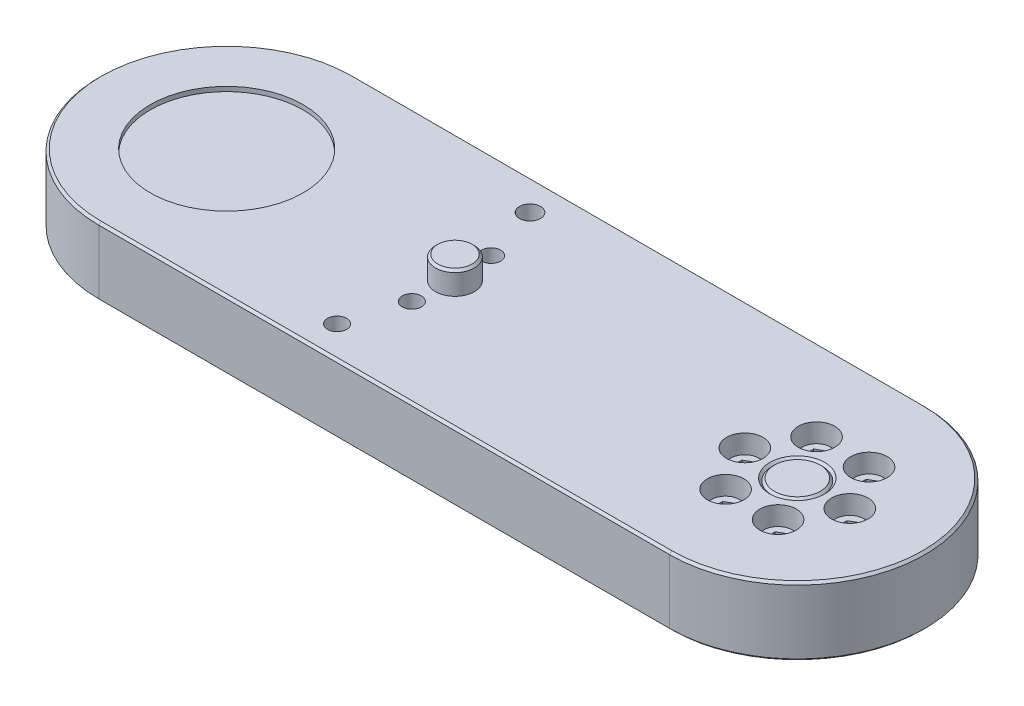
ISO-10303-21;
HEADER;
FILE_DESCRIPTION(('STEP AP214'),'2;1');
FILE_NAME('part.step','',(''),(''),'','','');
FILE_SCHEMA(('AUTOMOTIVE_DESIGN { 1 0 10303 214 1 1 1 1 }'));
ENDSEC;
DATA;
#1=APPLICATION_CONTEXT('core data for automotive mechanical design processes');
#2=APPLICATION_PROTOCOL_DEFINITION('international standard','automotive_design',2000,#1);
#3=PRODUCT_CONTEXT('',#1,'mechanical');
#4=PRODUCT('Part','Part','',(#3));
#5=PRODUCT_RELATED_PRODUCT_CATEGORY('part','',(#4));
#6=PRODUCT_DEFINITION_FORMATION('','',#4);
#7=PRODUCT_DEFINITION_CONTEXT('part definition',#1,'design');
#8=PRODUCT_DEFINITION('design','',#6,#7);
#9=PRODUCT_DEFINITION_SHAPE('','',#8);
#10=(LENGTH_UNIT() NAMED_UNIT(*) SI_UNIT(.MILLI.,.METRE.));
#11=(NAMED_UNIT(*) PLANE_ANGLE_UNIT() SI_UNIT($,.RADIAN.));
#12=(NAMED_UNIT(*) SI_UNIT($,.STERADIAN.) SOLID_ANGLE_UNIT());
#13=UNCERTAINTY_MEASURE_WITH_UNIT(LENGTH_MEASURE(1.E-05),#10,'distance_accuracy_value','');
#14=(GEOMETRIC_REPRESENTATION_CONTEXT(3) GLOBAL_UNCERTAINTY_ASSIGNED_CONTEXT((#13)) GLOBAL_UNIT_ASSIGNED_CONTEXT((#10,
#11,#12)) REPRESENTATION_CONTEXT('',''));
#15=CARTESIAN_POINT('',(0.,0.,0.));
#16=DIRECTION('',(0.,0.,1.));
#17=DIRECTION('',(1.,0.,0.));
#18=AXIS2_PLACEMENT_3D('',#15,#16,#17);
#19=CARTESIAN_POINT('',(133.85,11.5,9.95929214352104));
#20=DIRECTION('',(0.,1.,0.));
#21=DIRECTION('',(1.,0.,0.));
#22=AXIS2_PLACEMENT_3D('',#19,#20,#21);
#23=PLANE('',#22);
#24=DIRECTION('',(0.,0.,1.));
#25=VECTOR('',#24,1.);
#26=CARTESIAN_POINT('',(132.25,11.5,9.95929214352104));
#27=LINE('',#26,#25);
#28=CARTESIAN_POINT('',(132.25,11.5,9.0932667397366));
#29=VERTEX_POINT('',#28);
#30=CARTESIAN_POINT('',(132.25,11.5,10.8253175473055));
#31=VERTEX_POINT('',#30);
#32=EDGE_CURVE('E11',#29,#31,#27,.T.);
#33=ORIENTED_EDGE('',*,*,#32,.T.);
#34=DIRECTION('',(-0.866025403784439,0.,0.5));
#35=VECTOR('',#34,1.);
#36=CARTESIAN_POINT('',(133.825,11.5,9.91599087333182));
#37=LINE('',#36,#35);
#38=CARTESIAN_POINT('',(130.75,11.5,11.6913429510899));
#39=VERTEX_POINT('',#38);
#40=EDGE_CURVE('E27',#31,#39,#37,.T.);
#41=ORIENTED_EDGE('',*,*,#40,.T.);
#42=DIRECTION('',(-0.866025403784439,0.,-0.5));
#43=VECTOR('',#42,1.);
#44=CARTESIAN_POINT('',(132.325,11.5,12.6006696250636));
#45=LINE('',#44,#43);
#46=CARTESIAN_POINT('',(129.25,11.5,10.8253175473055));
#47=VERTEX_POINT('',#46);
#48=EDGE_CURVE('E1178',#39,#47,#45,.T.);
#49=ORIENTED_EDGE('',*,*,#48,.T.);
#50=DIRECTION('',(0.,0.,-1.));
#51=VECTOR('',#50,1.);
#52=CARTESIAN_POINT('',(129.25,11.5,9.95929214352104));
#53=LINE('',#52,#51);
#54=CARTESIAN_POINT('',(129.25,11.5,9.0932667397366));
#55=VERTEX_POINT('',#54);
#56=EDGE_CURVE('E1235',#47,#55,#53,.T.);
#57=ORIENTED_EDGE('',*,*,#56,.T.);
#58=DIRECTION('',(0.866025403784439,0.,-0.5));
#59=VECTOR('',#58,1.);
#60=CARTESIAN_POINT('',(132.325,11.5,7.31791466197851));
#61=LINE('',#60,#59);
#62=CARTESIAN_POINT('',(130.75,11.5,8.22724133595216));
#63=VERTEX_POINT('',#62);
#64=EDGE_CURVE('E855',#55,#63,#61,.T.);
#65=ORIENTED_EDGE('',*,*,#64,.T.);
#66=DIRECTION('',(0.866025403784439,0.,0.5));
#67=VECTOR('',#66,1.);
#68=CARTESIAN_POINT('',(133.825,11.5,10.0025934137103));
#69=LINE('',#68,#67);
#70=EDGE_CURVE('E560',#63,#29,#69,.T.);
#71=ORIENTED_EDGE('',*,*,#70,.T.);
#72=EDGE_LOOP('',(#33,#41,#49,#57,#65,#71));
#73=FACE_BOUND('',#72,.T.);
#74=CARTESIAN_POINT('',(130.75,11.5,9.95929214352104));
#75=DIRECTION('',(0.,-1.,0.));
#76=DIRECTION('',(0.,0.,-1.));
#77=AXIS2_PLACEMENT_3D('',#74,#75,#76);
#78=CIRCLE('',#77,3.1);
#79=CARTESIAN_POINT('',(130.75,11.5,6.85929214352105));
#80=VERTEX_POINT('',#79);
#81=EDGE_CURVE('E811',#80,#80,#78,.T.);
#82=ORIENTED_EDGE('',*,*,#81,.F.);
#83=EDGE_LOOP('',(#82));
#84=FACE_BOUND('',#83,.T.);
#85=ADVANCED_FACE('F16',(#73,#84),#23,.T.);
#86=CARTESIAN_POINT('',(133.85,11.5,-9.95929214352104));
#87=DIRECTION('',(0.,1.,0.));
#88=DIRECTION('',(1.,0.,0.));
#89=AXIS2_PLACEMENT_3D('',#86,#87,#88);
#90=PLANE('',#89);
#91=DIRECTION('',(0.,0.,1.));
#92=VECTOR('',#91,1.);
#93=CARTESIAN_POINT('',(132.25,11.5,-9.95929214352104));
#94=LINE('',#93,#92);
#95=CARTESIAN_POINT('',(132.25,11.5,-10.8253175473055));
#96=VERTEX_POINT('',#95);
#97=CARTESIAN_POINT('',(132.25,11.5,-9.0932667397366));
#98=VERTEX_POINT('',#97);
#99=EDGE_CURVE('E856',#96,#98,#94,.T.);
#100=ORIENTED_EDGE('',*,*,#99,.T.);
#101=DIRECTION('',(-0.866025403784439,0.,0.5));
#102=VECTOR('',#101,1.);
#103=CARTESIAN_POINT('',(133.825,11.5,-10.0025934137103));
#104=LINE('',#103,#102);
#105=CARTESIAN_POINT('',(130.75,11.5,-8.22724133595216));
#106=VERTEX_POINT('',#105);
#107=EDGE_CURVE('E1249',#98,#106,#104,.T.);
#108=ORIENTED_EDGE('',*,*,#107,.T.);
#109=DIRECTION('',(-0.866025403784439,0.,-0.5));
#110=VECTOR('',#109,1.);
#111=CARTESIAN_POINT('',(132.325,11.5,-7.31791466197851));
#112=LINE('',#111,#110);
#113=CARTESIAN_POINT('',(129.25,11.5,-9.0932667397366));
#114=VERTEX_POINT('',#113);
#115=EDGE_CURVE('E976',#106,#114,#112,.T.);
#116=ORIENTED_EDGE('',*,*,#115,.T.);
#117=DIRECTION('',(0.,0.,-1.));
#118=VECTOR('',#117,1.);
#119=CARTESIAN_POINT('',(129.25,11.5,-9.95929214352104));
#120=LINE('',#119,#118);
#121=CARTESIAN_POINT('',(129.25,11.5,-10.8253175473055));
#122=VERTEX_POINT('',#121);
#123=EDGE_CURVE('E972',#114,#122,#120,.T.);
#124=ORIENTED_EDGE('',*,*,#123,.T.);
#125=DIRECTION('',(0.866025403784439,0.,-0.5));
#126=VECTOR('',#125,1.);
#127=CARTESIAN_POINT('',(132.325,11.5,-12.6006696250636));
#128=LINE('',#127,#126);
#129=CARTESIAN_POINT('',(130.75,11.5,-11.6913429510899));
#130=VERTEX_POINT('',#129);
#131=EDGE_CURVE('E888',#122,#130,#128,.T.);
#132=ORIENTED_EDGE('',*,*,#131,.T.);
#133=DIRECTION('',(0.866025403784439,0.,0.5));
#134=VECTOR('',#133,1.);
#135=CARTESIAN_POINT('',(133.825,11.5,-9.91599087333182));
#136=LINE('',#135,#134);
#137=EDGE_CURVE('E885',#130,#96,#136,.T.);
#138=ORIENTED_EDGE('',*,*,#137,.T.);
#139=EDGE_LOOP('',(#100,#108,#116,#124,#132,#138));
#140=FACE_BOUND('',#139,.T.);
#141=CARTESIAN_POINT('',(130.75,11.5,-9.95929214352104));
#142=DIRECTION('',(0.,-1.,0.));
#143=DIRECTION('',(0.,0.,-1.));
#144=AXIS2_PLACEMENT_3D('',#141,#142,#143);
#145=CIRCLE('',#144,3.1);
#146=CARTESIAN_POINT('',(130.75,11.5,-13.059292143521));
#147=VERTEX_POINT('',#146);
#148=EDGE_CURVE('E1782',#147,#147,#145,.T.);
#149=ORIENTED_EDGE('',*,*,#148,.F.);
#150=EDGE_LOOP('',(#149));
#151=FACE_BOUND('',#150,.T.);
#152=ADVANCED_FACE('F1343',(#140,#151),#90,.T.);
#153=CARTESIAN_POINT('',(122.35,11.5,-9.95929214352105));
#154=DIRECTION('',(0.,1.,0.));
#155=DIRECTION('',(1.,0.,0.));
#156=AXIS2_PLACEMENT_3D('',#153,#154,#155);
#157=PLANE('',#156);
#158=DIRECTION('',(0.,0.,1.));
#159=VECTOR('',#158,1.);
#160=CARTESIAN_POINT('',(120.75,11.5,-9.95929214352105));
#161=LINE('',#160,#159);
#162=CARTESIAN_POINT('',(120.75,11.5,-10.8253175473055));
#163=VERTEX_POINT('',#162);
#164=CARTESIAN_POINT('',(120.75,11.5,-9.09326673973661));
#165=VERTEX_POINT('',#164);
#166=EDGE_CURVE('E889',#163,#165,#161,.T.);
#167=ORIENTED_EDGE('',*,*,#166,.T.);
#168=DIRECTION('',(-0.866025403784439,0.,0.5));
#169=VECTOR('',#168,1.);
#170=CARTESIAN_POINT('',(122.325,11.5,-10.0025934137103));
#171=LINE('',#170,#169);
#172=CARTESIAN_POINT('',(119.25,11.5,-8.22724133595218));
#173=VERTEX_POINT('',#172);
#174=EDGE_CURVE('E961',#165,#173,#171,.T.);
#175=ORIENTED_EDGE('',*,*,#174,.T.);
#176=DIRECTION('',(-0.866025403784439,0.,-0.5));
#177=VECTOR('',#176,1.);
#178=CARTESIAN_POINT('',(120.825,11.5,-7.31791466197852));
#179=LINE('',#178,#177);
#180=CARTESIAN_POINT('',(117.75,11.5,-9.09326673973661));
#181=VERTEX_POINT('',#180);
#182=EDGE_CURVE('E965',#173,#181,#179,.T.);
#183=ORIENTED_EDGE('',*,*,#182,.T.);
#184=DIRECTION('',(0.,0.,-1.));
#185=VECTOR('',#184,1.);
#186=CARTESIAN_POINT('',(117.75,11.5,-9.95929214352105));
#187=LINE('',#186,#185);
#188=CARTESIAN_POINT('',(117.75,11.5,-10.8253175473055));
#189=VERTEX_POINT('',#188);
#190=EDGE_CURVE('E845',#181,#189,#187,.T.);
#191=ORIENTED_EDGE('',*,*,#190,.T.);
#192=DIRECTION('',(0.866025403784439,0.,-0.5));
#193=VECTOR('',#192,1.);
#194=CARTESIAN_POINT('',(120.825,11.5,-12.6006696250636));
#195=LINE('',#194,#193);
#196=CARTESIAN_POINT('',(119.25,11.5,-11.6913429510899));
#197=VERTEX_POINT('',#196);
#198=EDGE_CURVE('E841',#189,#197,#195,.T.);
#199=ORIENTED_EDGE('',*,*,#198,.T.);
#200=DIRECTION('',(0.866025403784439,0.,0.5));
#201=VECTOR('',#200,1.);
#202=CARTESIAN_POINT('',(122.325,11.5,-9.91599087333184));
#203=LINE('',#202,#201);
#204=EDGE_CURVE('E846',#197,#163,#203,.T.);
#205=ORIENTED_EDGE('',*,*,#204,.T.);
#206=EDGE_LOOP('',(#167,#175,#183,#191,#199,#205));
#207=FACE_BOUND('',#206,.T.);
#208=CARTESIAN_POINT('',(119.25,11.5,-9.95929214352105));
#209=DIRECTION('',(0.,-1.,0.));
#210=DIRECTION('',(0.,0.,-1.));
#211=AXIS2_PLACEMENT_3D('',#208,#209,#210);
#212=CIRCLE('',#211,3.1);
#213=CARTESIAN_POINT('',(119.25,11.5,-13.059292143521));
#214=VERTEX_POINT('',#213);
#215=EDGE_CURVE('E759',#214,#214,#212,.T.);
#216=ORIENTED_EDGE('',*,*,#215,.F.);
#217=EDGE_LOOP('',(#216));
#218=FACE_BOUND('',#217,.T.);
#219=ADVANCED_FACE('F1349',(#207,#218),#157,.T.);
#220=CARTESIAN_POINT('',(116.6,11.5,0.));
#221=DIRECTION('',(0.,1.,0.));
#222=DIRECTION('',(1.,0.,0.));
#223=AXIS2_PLACEMENT_3D('',#220,#221,#222);
#224=PLANE('',#223);
#225=DIRECTION('',(0.,0.,1.));
#226=VECTOR('',#225,1.);
#227=CARTESIAN_POINT('',(115.,11.5,0.));
#228=LINE('',#227,#226);
#229=CARTESIAN_POINT('',(115.,11.5,-0.866025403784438));
#230=VERTEX_POINT('',#229);
#231=CARTESIAN_POINT('',(115.,11.5,0.866025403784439));
#232=VERTEX_POINT('',#231);
#233=EDGE_CURVE('E1229',#230,#232,#228,.T.);
#234=ORIENTED_EDGE('',*,*,#233,.T.);
#235=DIRECTION('',(-0.866025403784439,0.,0.5));
#236=VECTOR('',#235,1.);
#237=CARTESIAN_POINT('',(116.575,11.5,-0.0433012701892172));
#238=LINE('',#237,#236);
#239=CARTESIAN_POINT('',(113.5,11.5,1.73205080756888));
#240=VERTEX_POINT('',#239);
#241=EDGE_CURVE('E1225',#232,#240,#238,.T.);
#242=ORIENTED_EDGE('',*,*,#241,.T.);
#243=DIRECTION('',(-0.866025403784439,0.,-0.5));
#244=VECTOR('',#243,1.);
#245=CARTESIAN_POINT('',(115.075,11.5,2.64137748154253));
#246=LINE('',#245,#244);
#247=CARTESIAN_POINT('',(112.,11.5,0.866025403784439));
#248=VERTEX_POINT('',#247);
#249=EDGE_CURVE('E817',#240,#248,#246,.T.);
#250=ORIENTED_EDGE('',*,*,#249,.T.);
#251=DIRECTION('',(0.,0.,-1.));
#252=VECTOR('',#251,1.);
#253=CARTESIAN_POINT('',(112.,11.5,0.));
#254=LINE('',#253,#252);
#255=CARTESIAN_POINT('',(112.,11.5,-0.866025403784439));
#256=VERTEX_POINT('',#255);
#257=EDGE_CURVE('E813',#248,#256,#254,.T.);
#258=ORIENTED_EDGE('',*,*,#257,.T.);
#259=DIRECTION('',(0.866025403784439,0.,-0.5));
#260=VECTOR('',#259,1.);
#261=CARTESIAN_POINT('',(115.075,11.5,-2.64137748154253));
#262=LINE('',#261,#260);
#263=CARTESIAN_POINT('',(113.5,11.5,-1.73205080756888));
#264=VERTEX_POINT('',#263);
#265=EDGE_CURVE('E818',#256,#264,#262,.T.);
#266=ORIENTED_EDGE('',*,*,#265,.T.);
#267=DIRECTION('',(0.866025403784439,0.,0.5));
#268=VECTOR('',#267,1.);
#269=CARTESIAN_POINT('',(116.575,11.5,0.0433012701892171));
#270=LINE('',#269,#268);
#271=EDGE_CURVE('E1003',#264,#230,#270,.T.);
#272=ORIENTED_EDGE('',*,*,#271,.T.);
#273=EDGE_LOOP('',(#234,#242,#250,#258,#266,#272));
#274=FACE_BOUND('',#273,.T.);
#275=CARTESIAN_POINT('',(113.5,11.5,0.));
#276=DIRECTION('',(0.,-1.,0.));
#277=DIRECTION('',(0.,0.,-1.));
#278=AXIS2_PLACEMENT_3D('',#275,#276,#277);
#279=CIRCLE('',#278,3.1);
#280=CARTESIAN_POINT('',(113.5,11.5,-3.1));
#281=VERTEX_POINT('',#280);
#282=EDGE_CURVE('E711',#281,#281,#279,.T.);
#283=ORIENTED_EDGE('',*,*,#282,.F.);
#284=EDGE_LOOP('',(#283));
#285=FACE_BOUND('',#284,.T.);
#286=ADVANCED_FACE('F1401',(#274,#285),#224,.T.);
#287=CARTESIAN_POINT('',(122.35,11.5,9.95929214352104));
#288=DIRECTION('',(0.,1.,0.));
#289=DIRECTION('',(1.,0.,0.));
#290=AXIS2_PLACEMENT_3D('',#287,#288,#289);
#291=PLANE('',#290);
#292=DIRECTION('',(0.,0.,1.));
#293=VECTOR('',#292,1.);
#294=CARTESIAN_POINT('',(120.75,11.5,9.95929214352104));
#295=LINE('',#294,#293);
#296=CARTESIAN_POINT('',(120.75,11.5,9.0932667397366));
#297=VERTEX_POINT('',#296);
#298=CARTESIAN_POINT('',(120.75,11.5,10.8253175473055));
#299=VERTEX_POINT('',#298);
#300=EDGE_CURVE('E955',#297,#299,#295,.T.);
#301=ORIENTED_EDGE('',*,*,#300,.T.);
#302=DIRECTION('',(-0.866025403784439,0.,0.5));
#303=VECTOR('',#302,1.);
#304=CARTESIAN_POINT('',(122.325,11.5,9.91599087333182));
#305=LINE('',#304,#303);
#306=CARTESIAN_POINT('',(119.25,11.5,11.6913429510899));
#307=VERTEX_POINT('',#306);
#308=EDGE_CURVE('E951',#299,#307,#305,.T.);
#309=ORIENTED_EDGE('',*,*,#308,.T.);
#310=DIRECTION('',(-0.866025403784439,0.,-0.5));
#311=VECTOR('',#310,1.);
#312=CARTESIAN_POINT('',(120.825,11.5,12.6006696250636));
#313=LINE('',#312,#311);
#314=CARTESIAN_POINT('',(117.75,11.5,10.8253175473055));
#315=VERTEX_POINT('',#314);
#316=EDGE_CURVE('E956',#307,#315,#313,.T.);
#317=ORIENTED_EDGE('',*,*,#316,.T.);
#318=DIRECTION('',(0.,0.,-1.));
#319=VECTOR('',#318,1.);
#320=CARTESIAN_POINT('',(117.75,11.5,9.95929214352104));
#321=LINE('',#320,#319);
#322=CARTESIAN_POINT('',(117.75,11.5,9.0932667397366));
#323=VERTEX_POINT('',#322);
#324=EDGE_CURVE('E1281',#315,#323,#321,.T.);
#325=ORIENTED_EDGE('',*,*,#324,.T.);
#326=DIRECTION('',(0.866025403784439,0.,-0.5));
#327=VECTOR('',#326,1.);
#328=CARTESIAN_POINT('',(120.825,11.5,7.31791466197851));
#329=LINE('',#328,#327);
#330=CARTESIAN_POINT('',(119.25,11.5,8.22724133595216));
#331=VERTEX_POINT('',#330);
#332=EDGE_CURVE('E1277',#323,#331,#329,.T.);
#333=ORIENTED_EDGE('',*,*,#332,.T.);
#334=DIRECTION('',(0.866025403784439,0.,0.5));
#335=VECTOR('',#334,1.);
#336=CARTESIAN_POINT('',(122.325,11.5,10.0025934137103));
#337=LINE('',#336,#335);
#338=EDGE_CURVE('E1282',#331,#297,#337,.T.);
#339=ORIENTED_EDGE('',*,*,#338,.T.);
#340=EDGE_LOOP('',(#301,#309,#317,#325,#333,#339));
#341=FACE_BOUND('',#340,.T.);
#342=CARTESIAN_POINT('',(119.25,11.5,9.95929214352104));
#343=DIRECTION('',(0.,-1.,0.));
#344=DIRECTION('',(0.,0.,-1.));
#345=AXIS2_PLACEMENT_3D('',#342,#343,#344);
#346=CIRCLE('',#345,3.1);
#347=CARTESIAN_POINT('',(119.25,11.5,6.85929214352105));
#348=VERTEX_POINT('',#347);
#349=EDGE_CURVE('E832',#348,#348,#346,.T.);
#350=ORIENTED_EDGE('',*,*,#349,.F.);
#351=EDGE_LOOP('',(#350));
#352=FACE_BOUND('',#351,.T.);
#353=ADVANCED_FACE('F18',(#341,#352),#291,.T.);
#354=CARTESIAN_POINT('',(139.6,11.5,0.));
#355=DIRECTION('',(0.,1.,0.));
#356=DIRECTION('',(1.,0.,0.));
#357=AXIS2_PLACEMENT_3D('',#354,#355,#356);
#358=PLANE('',#357);
#359=DIRECTION('',(0.,0.,1.));
#360=VECTOR('',#359,1.);
#361=CARTESIAN_POINT('',(138.,11.5,0.));
#362=LINE('',#361,#360);
#363=CARTESIAN_POINT('',(138.,11.5,-0.866025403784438));
#364=VERTEX_POINT('',#363);
#365=CARTESIAN_POINT('',(138.,11.5,0.866025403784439));
#366=VERTEX_POINT('',#365);
#367=EDGE_CURVE('E1313',#364,#366,#362,.T.);
#368=ORIENTED_EDGE('',*,*,#367,.T.);
#369=DIRECTION('',(-0.866025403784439,0.,0.5));
#370=VECTOR('',#369,1.);
#371=CARTESIAN_POINT('',(139.575,11.5,-0.0433012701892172));
#372=LINE('',#371,#370);
#373=CARTESIAN_POINT('',(136.5,11.5,1.73205080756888));
#374=VERTEX_POINT('',#373);
#375=EDGE_CURVE('E805',#366,#374,#372,.T.);
#376=ORIENTED_EDGE('',*,*,#375,.T.);
#377=DIRECTION('',(-0.866025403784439,0.,-0.5));
#378=VECTOR('',#377,1.);
#379=CARTESIAN_POINT('',(138.075,11.5,2.64137748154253));
#380=LINE('',#379,#378);
#381=CARTESIAN_POINT('',(135.,11.5,0.866025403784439));
#382=VERTEX_POINT('',#381);
#383=EDGE_CURVE('E801',#374,#382,#380,.T.);
#384=ORIENTED_EDGE('',*,*,#383,.T.);
#385=DIRECTION('',(0.,0.,-1.));
#386=VECTOR('',#385,1.);
#387=CARTESIAN_POINT('',(135.,11.5,0.));
#388=LINE('',#387,#386);
#389=CARTESIAN_POINT('',(135.,11.5,-0.866025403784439));
#390=VERTEX_POINT('',#389);
#391=EDGE_CURVE('E806',#382,#390,#388,.T.);
#392=ORIENTED_EDGE('',*,*,#391,.T.);
#393=DIRECTION('',(0.866025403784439,0.,-0.5));
#394=VECTOR('',#393,1.);
#395=CARTESIAN_POINT('',(138.075,11.5,-2.64137748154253));
#396=LINE('',#395,#394);
#397=CARTESIAN_POINT('',(136.5,11.5,-1.73205080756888));
#398=VERTEX_POINT('',#397);
#399=EDGE_CURVE('E874',#390,#398,#396,.T.);
#400=ORIENTED_EDGE('',*,*,#399,.T.);
#401=DIRECTION('',(0.866025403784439,0.,0.5));
#402=VECTOR('',#401,1.);
#403=CARTESIAN_POINT('',(139.575,11.5,0.0433012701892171));
#404=LINE('',#403,#402);
#405=EDGE_CURVE('E1308',#398,#364,#404,.T.);
#406=ORIENTED_EDGE('',*,*,#405,.T.);
#407=EDGE_LOOP('',(#368,#376,#384,#392,#400,#406));
#408=FACE_BOUND('',#407,.T.);
#409=CARTESIAN_POINT('',(136.5,11.5,0.));
#410=DIRECTION('',(0.,-1.,0.));
#411=DIRECTION('',(0.,0.,-1.));
#412=AXIS2_PLACEMENT_3D('',#409,#410,#411);
#413=CIRCLE('',#412,3.1);
#414=CARTESIAN_POINT('',(136.5,11.5,-3.1));
#415=VERTEX_POINT('',#414);
#416=EDGE_CURVE('E1031',#415,#415,#413,.T.);
#417=ORIENTED_EDGE('',*,*,#416,.F.);
#418=EDGE_LOOP('',(#417));
#419=FACE_BOUND('',#418,.T.);
#420=ADVANCED_FACE('F1617',(#408,#419),#358,.T.);
#421=CARTESIAN_POINT('',(0.,15.,0.));
#422=DIRECTION('',(0.,1.,0.));
#423=DIRECTION('',(1.,0.,0.));
#424=AXIS2_PLACEMENT_3D('',#421,#422,#423);
#425=PLANE('',#424);
#426=CARTESIAN_POINT('',(125.,15.,0.));
#427=DIRECTION('',(0.,-1.,0.));
#428=DIRECTION('',(0.,0.,-1.));
#429=AXIS2_PLACEMENT_3D('',#426,#427,#428);
#430=CIRCLE('',#429,6.);
#431=CARTESIAN_POINT('',(125.,15.,-6.));
#432=VERTEX_POINT('',#431);
#433=EDGE_CURVE('E1145',#432,#432,#430,.T.);
#434=ORIENTED_EDGE('',*,*,#433,.T.);
#435=EDGE_LOOP('',(#434));
#436=FACE_BOUND('',#435,.T.);
#437=CARTESIAN_POINT('',(0.,15.,0.));
#438=DIRECTION('',(0.,-1.,0.));
#439=DIRECTION('',(0.,0.,-1.));
#440=AXIS2_PLACEMENT_3D('',#437,#438,#439);
#441=CIRCLE('',#440,16.75);
#442=CARTESIAN_POINT('',(0.,15.,-16.75));
#443=VERTEX_POINT('',#442);
#444=EDGE_CURVE('E960',#443,#443,#441,.T.);
#445=ORIENTED_EDGE('',*,*,#444,.T.);
#446=EDGE_LOOP('',(#445));
#447=FACE_BOUND('',#446,.T.);
#448=CARTESIAN_POINT('',(119.25,15.,9.95929214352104));
#449=DIRECTION('',(0.,-1.,0.));
#450=DIRECTION('',(0.,0.,-1.));
#451=AXIS2_PLACEMENT_3D('',#448,#449,#450);
#452=CIRCLE('',#451,4.);
#453=CARTESIAN_POINT('',(119.25,15.,5.95929214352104));
#454=VERTEX_POINT('',#453);
#455=EDGE_CURVE('E851',#454,#454,#452,.T.);
#456=ORIENTED_EDGE('',*,*,#455,.T.);
#457=EDGE_LOOP('',(#456));
#458=FACE_BOUND('',#457,.T.);
#459=CARTESIAN_POINT('',(113.5,15.,0.));
#460=DIRECTION('',(0.,-1.,0.));
#461=DIRECTION('',(0.,0.,-1.));
#462=AXIS2_PLACEMENT_3D('',#459,#460,#461);
#463=CIRCLE('',#462,4.);
#464=CARTESIAN_POINT('',(113.5,15.,-4.));
#465=VERTEX_POINT('',#464);
#466=EDGE_CURVE('E847',#465,#465,#463,.T.);
#467=ORIENTED_EDGE('',*,*,#466,.T.);
#468=EDGE_LOOP('',(#467));
#469=FACE_BOUND('',#468,.T.);
#470=CARTESIAN_POINT('',(119.25,15.,-9.95929214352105));
#471=DIRECTION('',(0.,-1.,0.));
#472=DIRECTION('',(0.,0.,-1.));
#473=AXIS2_PLACEMENT_3D('',#470,#471,#472);
#474=CIRCLE('',#473,4.);
#475=CARTESIAN_POINT('',(119.25,15.,-13.9592921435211));
#476=VERTEX_POINT('',#475);
#477=EDGE_CURVE('E852',#476,#476,#474,.T.);
#478=ORIENTED_EDGE('',*,*,#477,.T.);
#479=EDGE_LOOP('',(#478));
#480=FACE_BOUND('',#479,.T.);
#481=CARTESIAN_POINT('',(130.75,15.,-9.95929214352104));
#482=DIRECTION('',(0.,-1.,0.));
#483=DIRECTION('',(0.,0.,-1.));
#484=AXIS2_PLACEMENT_3D('',#481,#482,#483);
#485=CIRCLE('',#484,4.);
#486=CARTESIAN_POINT('',(130.75,15.,-13.959292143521));
#487=VERTEX_POINT('',#486);
#488=EDGE_CURVE('E866',#487,#487,#485,.T.);
#489=ORIENTED_EDGE('',*,*,#488,.T.);
#490=EDGE_LOOP('',(#489));
#491=FACE_BOUND('',#490,.T.);
#492=CARTESIAN_POINT('',(130.75,15.,9.95929214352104));
#493=DIRECTION('',(0.,-1.,0.));
#494=DIRECTION('',(0.,0.,-1.));
#495=AXIS2_PLACEMENT_3D('',#492,#493,#494);
#496=CIRCLE('',#495,4.);
#497=CARTESIAN_POINT('',(130.75,15.,5.95929214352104));
#498=VERTEX_POINT('',#497);
#499=EDGE_CURVE('E870',#498,#498,#496,.T.);
#500=ORIENTED_EDGE('',*,*,#499,.T.);
#501=EDGE_LOOP('',(#500));
#502=FACE_BOUND('',#501,.T.);
#503=CARTESIAN_POINT('',(136.5,15.,0.));
#504=DIRECTION('',(0.,-1.,0.));
#505=DIRECTION('',(0.,0.,-1.));
#506=AXIS2_PLACEMENT_3D('',#503,#504,#505);
#507=CIRCLE('',#506,4.);
#508=CARTESIAN_POINT('',(136.5,15.,-4.));
#509=VERTEX_POINT('',#508);
#510=EDGE_CURVE('E893',#509,#509,#507,.T.);
#511=ORIENTED_EDGE('',*,*,#510,.T.);
#512=EDGE_LOOP('',(#511));
#513=FACE_BOUND('',#512,.T.);
#514=CARTESIAN_POINT('',(49.2403876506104,15.,-8.68240888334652));
#515=DIRECTION('',(0.,-1.,0.));
#516=DIRECTION('',(0.,0.,-1.));
#517=AXIS2_PLACEMENT_3D('',#514,#515,#516);
#518=CIRCLE('',#517,2.1);
#519=CARTESIAN_POINT('',(49.2403876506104,15.,-10.7824088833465));
#520=VERTEX_POINT('',#519);
#521=EDGE_CURVE('E1128',#520,#520,#518,.T.);
#522=ORIENTED_EDGE('',*,*,#521,.T.);
#523=EDGE_LOOP('',(#522));
#524=FACE_BOUND('',#523,.T.);
#525=CARTESIAN_POINT('',(49.2403876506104,15.,8.68240888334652));
#526=DIRECTION('',(0.,-1.,0.));
#527=DIRECTION('',(0.,0.,-1.));
#528=AXIS2_PLACEMENT_3D('',#525,#526,#527);
#529=CIRCLE('',#528,2.1);
#530=CARTESIAN_POINT('',(49.2403876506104,15.,6.58240888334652));
#531=VERTEX_POINT('',#530);
#532=EDGE_CURVE('E789',#531,#531,#529,.T.);
#533=ORIENTED_EDGE('',*,*,#532,.T.);
#534=EDGE_LOOP('',(#533));
#535=FACE_BOUND('',#534,.T.);
#536=CARTESIAN_POINT('',(45.3153893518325,15.,21.130913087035));
#537=DIRECTION('',(0.,-1.,0.));
#538=DIRECTION('',(0.,0.,-1.));
#539=AXIS2_PLACEMENT_3D('',#536,#537,#538);
#540=CIRCLE('',#539,2.1);
#541=CARTESIAN_POINT('',(45.3153893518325,15.,19.030913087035));
#542=VERTEX_POINT('',#541);
#543=EDGE_CURVE('E785',#542,#542,#540,.T.);
#544=ORIENTED_EDGE('',*,*,#543,.T.);
#545=EDGE_LOOP('',(#544));
#546=FACE_BOUND('',#545,.T.);
#547=CARTESIAN_POINT('',(45.3153893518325,15.,-21.130913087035));
#548=DIRECTION('',(0.,-1.,0.));
#549=DIRECTION('',(0.,0.,-1.));
#550=AXIS2_PLACEMENT_3D('',#547,#548,#549);
#551=CIRCLE('',#550,2.3);
#552=CARTESIAN_POINT('',(45.3153893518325,15.,-23.430913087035));
#553=VERTEX_POINT('',#552);
#554=EDGE_CURVE('E681',#553,#553,#551,.T.);
#555=ORIENTED_EDGE('',*,*,#554,.T.);
#556=EDGE_LOOP('',(#555));
#557=FACE_BOUND('',#556,.T.);
#558=CARTESIAN_POINT('',(50.,15.,0.));
#559=DIRECTION('',(0.,-1.,0.));
#560=DIRECTION('',(0.,0.,-1.));
#561=AXIS2_PLACEMENT_3D('',#558,#559,#560);
#562=CIRCLE('',#561,4.25);
#563=CARTESIAN_POINT('',(50.,15.,-4.25));
#564=VERTEX_POINT('',#563);
#565=EDGE_CURVE('E690',#564,#564,#562,.T.);
#566=ORIENTED_EDGE('',*,*,#565,.T.);
#567=EDGE_LOOP('',(#566));
#568=FACE_BOUND('',#567,.T.);
#569=DIRECTION('',(-1.,0.,0.));
#570=VECTOR('',#569,1.);
#571=CARTESIAN_POINT('',(150.,15.,27.5));
#572=LINE('',#571,#570);
#573=CARTESIAN_POINT('',(125.,15.,27.5));
#574=VERTEX_POINT('',#573);
#575=CARTESIAN_POINT('',(0.,15.,27.5));
#576=VERTEX_POINT('',#575);
#577=EDGE_CURVE('E1107',#574,#576,#572,.T.);
#578=ORIENTED_EDGE('',*,*,#577,.F.);
#579=CARTESIAN_POINT('',(125.,15.,0.));
#580=DIRECTION('',(0.,-1.,0.));
#581=DIRECTION('',(0.,0.,-1.));
#582=AXIS2_PLACEMENT_3D('',#579,#580,#581);
#583=CIRCLE('',#582,27.5);
#584=CARTESIAN_POINT('',(125.,15.,-27.5));
#585=VERTEX_POINT('',#584);
#586=EDGE_CURVE('E1171',#585,#574,#583,.T.);
#587=ORIENTED_EDGE('',*,*,#586,.F.);
#588=DIRECTION('',(-1.,0.,0.));
#589=VECTOR('',#588,1.);
#590=CARTESIAN_POINT('',(150.,15.,-27.5));
#591=LINE('',#590,#589);
#592=CARTESIAN_POINT('',(0.,15.,-27.5));
#593=VERTEX_POINT('',#592);
#594=EDGE_CURVE('E753',#585,#593,#591,.T.);
#595=ORIENTED_EDGE('',*,*,#594,.T.);
#596=CARTESIAN_POINT('',(0.,15.,0.));
#597=DIRECTION('',(0.,1.,0.));
#598=DIRECTION('',(0.,0.,1.));
#599=AXIS2_PLACEMENT_3D('',#596,#597,#598);
#600=CIRCLE('',#599,27.5);
#601=EDGE_CURVE('E749',#593,#576,#600,.T.);
#602=ORIENTED_EDGE('',*,*,#601,.T.);
#603=EDGE_LOOP('',(#578,#587,#595,#602));
#604=FACE_BOUND('',#603,.T.);
#605=ADVANCED_FACE('F1620',(#436,#447,#458,#469,#480,#491,#502,#513,#524,#535,#546,#557,#568,
#604),#425,.T.);
#606=CARTESIAN_POINT('',(0.,0.,0.));
#607=DIRECTION('',(0.,1.,0.));
#608=DIRECTION('',(1.,0.,0.));
#609=AXIS2_PLACEMENT_3D('',#606,#607,#608);
#610=PLANE('',#609);
#611=CARTESIAN_POINT('',(6.45,0.,-11.0851251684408));
#612=DIRECTION('',(0.,-1.,0.));
#613=DIRECTION('',(0.,0.,-1.));
#614=AXIS2_PLACEMENT_3D('',#611,#612,#613);
#615=CIRCLE('',#614,4.);
#616=CARTESIAN_POINT('',(6.45,0.,-15.0851251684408));
#617=VERTEX_POINT('',#616);
#618=EDGE_CURVE('E770',#617,#617,#615,.T.);
#619=ORIENTED_EDGE('',*,*,#618,.F.);
#620=EDGE_LOOP('',(#619));
#621=FACE_BOUND('',#620,.T.);
#622=CARTESIAN_POINT('',(12.85,0.,0.));
#623=DIRECTION('',(0.,-1.,0.));
#624=DIRECTION('',(0.,0.,-1.));
#625=AXIS2_PLACEMENT_3D('',#622,#623,#624);
#626=CIRCLE('',#625,4.);
#627=CARTESIAN_POINT('',(12.85,0.,-4.));
#628=VERTEX_POINT('',#627);
#629=EDGE_CURVE('E939',#628,#628,#626,.T.);
#630=ORIENTED_EDGE('',*,*,#629,.F.);
#631=EDGE_LOOP('',(#630));
#632=FACE_BOUND('',#631,.T.);
#633=CARTESIAN_POINT('',(6.45,0.,11.0851251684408));
#634=DIRECTION('',(0.,-1.,0.));
#635=DIRECTION('',(0.,0.,-1.));
#636=AXIS2_PLACEMENT_3D('',#633,#634,#635);
#637=CIRCLE('',#636,4.);
#638=CARTESIAN_POINT('',(6.45,0.,7.08512516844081));
#639=VERTEX_POINT('',#638);
#640=EDGE_CURVE('E757',#639,#639,#637,.T.);
#641=ORIENTED_EDGE('',*,*,#640,.F.);
#642=EDGE_LOOP('',(#641));
#643=FACE_BOUND('',#642,.T.);
#644=CARTESIAN_POINT('',(-6.35,0.,11.0851251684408));
#645=DIRECTION('',(0.,-1.,0.));
#646=DIRECTION('',(0.,0.,-1.));
#647=AXIS2_PLACEMENT_3D('',#644,#645,#646);
#648=CIRCLE('',#647,4.);
#649=CARTESIAN_POINT('',(-6.35,0.,7.08512516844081));
#650=VERTEX_POINT('',#649);
#651=EDGE_CURVE('E990',#650,#650,#648,.T.);
#652=ORIENTED_EDGE('',*,*,#651,.F.);
#653=EDGE_LOOP('',(#652));
#654=FACE_BOUND('',#653,.T.);
#655=CARTESIAN_POINT('',(-6.35,0.,-11.0851251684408));
#656=DIRECTION('',(0.,-1.,0.));
#657=DIRECTION('',(0.,0.,-1.));
#658=AXIS2_PLACEMENT_3D('',#655,#656,#657);
#659=CIRCLE('',#658,4.);
#660=CARTESIAN_POINT('',(-6.35,0.,-15.0851251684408));
#661=VERTEX_POINT('',#660);
#662=EDGE_CURVE('E780',#661,#661,#659,.T.);
#663=ORIENTED_EDGE('',*,*,#662,.F.);
#664=EDGE_LOOP('',(#663));
#665=FACE_BOUND('',#664,.T.);
#666=CARTESIAN_POINT('',(-12.75,0.,0.));
#667=DIRECTION('',(0.,-1.,0.));
#668=DIRECTION('',(0.,0.,-1.));
#669=AXIS2_PLACEMENT_3D('',#666,#667,#668);
#670=CIRCLE('',#669,4.);
#671=CARTESIAN_POINT('',(-12.75,0.,-4.));
#672=VERTEX_POINT('',#671);
#673=EDGE_CURVE('E1217',#672,#672,#670,.T.);
#674=ORIENTED_EDGE('',*,*,#673,.F.);
#675=EDGE_LOOP('',(#674));
#676=FACE_BOUND('',#675,.T.);
#677=CARTESIAN_POINT('',(125.,0.,0.));
#678=DIRECTION('',(0.,-1.,0.));
#679=DIRECTION('',(0.,0.,-1.));
#680=AXIS2_PLACEMENT_3D('',#677,#678,#679);
#681=CIRCLE('',#680,15.5);
#682=CARTESIAN_POINT('',(125.,0.,-15.5));
#683=VERTEX_POINT('',#682);
#684=EDGE_CURVE('E747',#683,#683,#681,.T.);
#685=ORIENTED_EDGE('',*,*,#684,.F.);
#686=EDGE_LOOP('',(#685));
#687=FACE_BOUND('',#686,.T.);
#688=CARTESIAN_POINT('',(49.2403876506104,0.,-8.68240888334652));
#689=DIRECTION('',(0.,-1.,0.));
#690=DIRECTION('',(0.,0.,-1.));
#691=AXIS2_PLACEMENT_3D('',#688,#689,#690);
#692=CIRCLE('',#691,2.1);
#693=CARTESIAN_POINT('',(49.2403876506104,0.,-10.7824088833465));
#694=VERTEX_POINT('',#693);
#695=EDGE_CURVE('E913',#694,#694,#692,.T.);
#696=ORIENTED_EDGE('',*,*,#695,.F.);
#697=EDGE_LOOP('',(#696));
#698=FACE_BOUND('',#697,.T.);
#699=CARTESIAN_POINT('',(49.2403876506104,0.,8.68240888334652));
#700=DIRECTION('',(0.,-1.,0.));
#701=DIRECTION('',(0.,0.,-1.));
#702=AXIS2_PLACEMENT_3D('',#699,#700,#701);
#703=CIRCLE('',#702,2.1);
#704=CARTESIAN_POINT('',(49.2403876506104,0.,6.58240888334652));
#705=VERTEX_POINT('',#704);
#706=EDGE_CURVE('E732',#705,#705,#703,.T.);
#707=ORIENTED_EDGE('',*,*,#706,.F.);
#708=EDGE_LOOP('',(#707));
#709=FACE_BOUND('',#708,.T.);
#710=CARTESIAN_POINT('',(50.,0.,0.));
#711=DIRECTION('',(0.,-1.,0.));
#712=DIRECTION('',(0.,0.,-1.));
#713=AXIS2_PLACEMENT_3D('',#710,#711,#712);
#714=CIRCLE('',#713,2.1);
#715=CARTESIAN_POINT('',(50.,0.,-2.1));
#716=VERTEX_POINT('',#715);
#717=EDGE_CURVE('E728',#716,#716,#714,.T.);
#718=ORIENTED_EDGE('',*,*,#717,.F.);
#719=EDGE_LOOP('',(#718));
#720=FACE_BOUND('',#719,.T.);
#721=CARTESIAN_POINT('',(45.3153893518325,0.,21.130913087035));
#722=DIRECTION('',(0.,-1.,0.));
#723=DIRECTION('',(0.,0.,-1.));
#724=AXIS2_PLACEMENT_3D('',#721,#722,#723);
#725=CIRCLE('',#724,2.1);
#726=CARTESIAN_POINT('',(45.3153893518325,0.,19.030913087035));
#727=VERTEX_POINT('',#726);
#728=EDGE_CURVE('E1288',#727,#727,#725,.T.);
#729=ORIENTED_EDGE('',*,*,#728,.F.);
#730=EDGE_LOOP('',(#729));
#731=FACE_BOUND('',#730,.T.);
#732=CARTESIAN_POINT('',(45.3153893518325,0.,-21.130913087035));
#733=DIRECTION('',(0.,-1.,0.));
#734=DIRECTION('',(0.,0.,-1.));
#735=AXIS2_PLACEMENT_3D('',#732,#733,#734);
#736=CIRCLE('',#735,2.3);
#737=CARTESIAN_POINT('',(45.3153893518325,0.,-23.430913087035));
#738=VERTEX_POINT('',#737);
#739=EDGE_CURVE('E1292',#738,#738,#736,.T.);
#740=ORIENTED_EDGE('',*,*,#739,.F.);
#741=EDGE_LOOP('',(#740));
#742=FACE_BOUND('',#741,.T.);
#743=CARTESIAN_POINT('',(125.,0.,0.));
#744=DIRECTION('',(0.,-1.,0.));
#745=DIRECTION('',(0.,0.,-1.));
#746=AXIS2_PLACEMENT_3D('',#743,#744,#745);
#747=CIRCLE('',#746,27.5);
#748=CARTESIAN_POINT('',(125.,0.,-27.5));
#749=VERTEX_POINT('',#748);
#750=CARTESIAN_POINT('',(125.,0.,27.5));
#751=VERTEX_POINT('',#750);
#752=EDGE_CURVE('E754',#749,#751,#747,.T.);
#753=ORIENTED_EDGE('',*,*,#752,.T.);
#754=DIRECTION('',(-1.,0.,0.));
#755=VECTOR('',#754,1.);
#756=CARTESIAN_POINT('',(150.,0.,27.5));
#757=LINE('',#756,#755);
#758=CARTESIAN_POINT('',(0.,0.,27.5));
#759=VERTEX_POINT('',#758);
#760=EDGE_CURVE('E1175',#751,#759,#757,.T.);
#761=ORIENTED_EDGE('',*,*,#760,.T.);
#762=CARTESIAN_POINT('',(0.,0.,0.));
#763=DIRECTION('',(0.,1.,0.));
#764=DIRECTION('',(0.,0.,1.));
#765=AXIS2_PLACEMENT_3D('',#762,#763,#764);
#766=CIRCLE('',#765,27.5);
#767=CARTESIAN_POINT('',(0.,0.,-27.5));
#768=VERTEX_POINT('',#767);
#769=EDGE_CURVE('E1010',#768,#759,#766,.T.);
#770=ORIENTED_EDGE('',*,*,#769,.F.);
#771=DIRECTION('',(-1.,0.,0.));
#772=VECTOR('',#771,1.);
#773=CARTESIAN_POINT('',(150.,0.,-27.5));
#774=LINE('',#773,#772);
#775=EDGE_CURVE('E982',#749,#768,#774,.T.);
#776=ORIENTED_EDGE('',*,*,#775,.F.);
#777=EDGE_LOOP('',(#753,#761,#770,#776));
#778=FACE_BOUND('',#777,.T.);
#779=ADVANCED_FACE('F1717',(#621,#632,#643,#654,#665,#676,#687,#698,#709,#720,#731,#742,#778),
#610,.F.);
#780=CARTESIAN_POINT('',(125.,15.,-28.));
#781=DIRECTION('',(0.,0.,1.));
#782=DIRECTION('',(1.,0.,0.));
#783=AXIS2_PLACEMENT_3D('',#780,#781,#782);
#784=PLANE('',#783);
#785=DIRECTION('',(0.,-1.,0.));
#786=VECTOR('',#785,1.);
#787=CARTESIAN_POINT('',(0.,15.,-28.));
#788=LINE('',#787,#786);
#789=CARTESIAN_POINT('',(0.,14.5,-28.));
#790=VERTEX_POINT('',#789);
#791=CARTESIAN_POINT('',(0.,0.5,-28.));
#792=VERTEX_POINT('',#791);
#793=EDGE_CURVE('E928',#790,#792,#788,.T.);
#794=ORIENTED_EDGE('',*,*,#793,.F.);
#795=DIRECTION('',(-1.,0.,0.));
#796=VECTOR('',#795,1.);
#797=CARTESIAN_POINT('',(150.,14.5,-28.));
#798=LINE('',#797,#796);
#799=CARTESIAN_POINT('',(125.,14.5,-28.));
#800=VERTEX_POINT('',#799);
#801=EDGE_CURVE('E1106',#800,#790,#798,.T.);
#802=ORIENTED_EDGE('',*,*,#801,.F.);
#803=DIRECTION('',(0.,-1.,0.));
#804=VECTOR('',#803,1.);
#805=CARTESIAN_POINT('',(125.,15.,-28.));
#806=LINE('',#805,#804);
#807=CARTESIAN_POINT('',(125.,0.5,-28.));
#808=VERTEX_POINT('',#807);
#809=EDGE_CURVE('E1748',#800,#808,#806,.T.);
#810=ORIENTED_EDGE('',*,*,#809,.T.);
#811=DIRECTION('',(-1.,0.,0.));
#812=VECTOR('',#811,1.);
#813=CARTESIAN_POINT('',(150.,0.5,-28.));
#814=LINE('',#813,#812);
#815=EDGE_CURVE('E932',#808,#792,#814,.T.);
#816=ORIENTED_EDGE('',*,*,#815,.T.);
#817=EDGE_LOOP('',(#794,#802,#810,#816));
#818=FACE_BOUND('',#817,.T.);
#819=ADVANCED_FACE('F1680',(#818),#784,.F.);
#820=CARTESIAN_POINT('',(0.,15.,0.));
#821=DIRECTION('',(0.,-1.,0.));
#822=DIRECTION('',(0.,0.,-1.));
#823=AXIS2_PLACEMENT_3D('',#820,#821,#822);
#824=CYLINDRICAL_SURFACE('',#823,28.);
#825=ORIENTED_EDGE('',*,*,#793,.T.);
#826=CARTESIAN_POINT('',(0.,0.5,0.));
#827=DIRECTION('',(0.,1.,0.));
#828=DIRECTION('',(0.,0.,1.));
#829=AXIS2_PLACEMENT_3D('',#826,#827,#828);
#830=CIRCLE('',#829,28.);
#831=CARTESIAN_POINT('',(0.,0.5,28.));
#832=VERTEX_POINT('',#831);
#833=EDGE_CURVE('E827',#792,#832,#830,.T.);
#834=ORIENTED_EDGE('',*,*,#833,.T.);
#835=DIRECTION('',(0.,-1.,0.));
#836=VECTOR('',#835,1.);
#837=CARTESIAN_POINT('',(0.,15.,28.));
#838=LINE('',#837,#836);
#839=CARTESIAN_POINT('',(0.,14.5,28.));
#840=VERTEX_POINT('',#839);
#841=EDGE_CURVE('E828',#840,#832,#838,.T.);
#842=ORIENTED_EDGE('',*,*,#841,.F.);
#843=CARTESIAN_POINT('',(0.,14.5,0.));
#844=DIRECTION('',(0.,1.,0.));
#845=DIRECTION('',(0.,0.,1.));
#846=AXIS2_PLACEMENT_3D('',#843,#844,#845);
#847=CIRCLE('',#846,28.);
#848=EDGE_CURVE('E1011',#790,#840,#847,.T.);
#849=ORIENTED_EDGE('',*,*,#848,.F.);
#850=EDGE_LOOP('',(#825,#834,#842,#849));
#851=FACE_BOUND('',#850,.T.);
#852=ADVANCED_FACE('F1632',(#851),#824,.T.);
#853=CARTESIAN_POINT('',(0.,15.,28.));
#854=DIRECTION('',(0.,0.,-1.));
#855=DIRECTION('',(0.,-1.,0.));
#856=AXIS2_PLACEMENT_3D('',#853,#854,#855);
#857=PLANE('',#856);
#858=DIRECTION('',(0.,-1.,0.));
#859=VECTOR('',#858,1.);
#860=CARTESIAN_POINT('',(125.,15.,28.));
#861=LINE('',#860,#859);
#862=CARTESIAN_POINT('',(125.,14.5,28.));
#863=VERTEX_POINT('',#862);
#864=CARTESIAN_POINT('',(125.,0.5,28.));
#865=VERTEX_POINT('',#864);
#866=EDGE_CURVE('E1094',#863,#865,#861,.T.);
#867=ORIENTED_EDGE('',*,*,#866,.F.);
#868=DIRECTION('',(-1.,0.,0.));
#869=VECTOR('',#868,1.);
#870=CARTESIAN_POINT('',(150.,14.5,28.));
#871=LINE('',#870,#869);
#872=EDGE_CURVE('E823',#863,#840,#871,.T.);
#873=ORIENTED_EDGE('',*,*,#872,.T.);
#874=ORIENTED_EDGE('',*,*,#841,.T.);
#875=DIRECTION('',(-1.,0.,0.));
#876=VECTOR('',#875,1.);
#877=CARTESIAN_POINT('',(150.,0.5,28.));
#878=LINE('',#877,#876);
#879=EDGE_CURVE('E1024',#865,#832,#878,.T.);
#880=ORIENTED_EDGE('',*,*,#879,.F.);
#881=EDGE_LOOP('',(#867,#873,#874,#880));
#882=FACE_BOUND('',#881,.T.);
#883=ADVANCED_FACE('F1628',(#882),#857,.F.);
#884=CARTESIAN_POINT('',(125.,15.,0.));
#885=DIRECTION('',(0.,-1.,0.));
#886=DIRECTION('',(0.,0.,-1.));
#887=AXIS2_PLACEMENT_3D('',#884,#885,#886);
#888=CYLINDRICAL_SURFACE('',#887,28.);
#889=ORIENTED_EDGE('',*,*,#809,.F.);
#890=CARTESIAN_POINT('',(125.,14.5,0.));
#891=DIRECTION('',(0.,-1.,0.));
#892=DIRECTION('',(0.,0.,-1.));
#893=AXIS2_PLACEMENT_3D('',#890,#891,#892);
#894=CIRCLE('',#893,28.);
#895=EDGE_CURVE('E1052',#800,#863,#894,.T.);
#896=ORIENTED_EDGE('',*,*,#895,.T.);
#897=ORIENTED_EDGE('',*,*,#866,.T.);
#898=CARTESIAN_POINT('',(125.,0.5,0.));
#899=DIRECTION('',(0.,-1.,0.));
#900=DIRECTION('',(0.,0.,-1.));
#901=AXIS2_PLACEMENT_3D('',#898,#899,#900);
#902=CIRCLE('',#901,28.);
#903=EDGE_CURVE('E1023',#808,#865,#902,.T.);
#904=ORIENTED_EDGE('',*,*,#903,.F.);
#905=EDGE_LOOP('',(#889,#896,#897,#904));
#906=FACE_BOUND('',#905,.T.);
#907=ADVANCED_FACE('F1631',(#906),#888,.T.);
#908=CARTESIAN_POINT('',(0.,0.,0.));
#909=DIRECTION('',(0.,1.,0.));
#910=DIRECTION('',(0.,0.,1.));
#911=AXIS2_PLACEMENT_3D('',#908,#909,#910);
#912=CONICAL_SURFACE('',#911,27.5,0.785398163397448);
#913=ORIENTED_EDGE('',*,*,#833,.F.);
#914=DIRECTION('',(0.,0.707106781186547,-0.707106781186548));
#915=VECTOR('',#914,1.);
#916=CARTESIAN_POINT('',(0.,0.,-27.5));
#917=LINE('',#916,#915);
#918=EDGE_CURVE('E981',#768,#792,#917,.T.);
#919=ORIENTED_EDGE('',*,*,#918,.F.);
#920=ORIENTED_EDGE('',*,*,#769,.T.);
#921=DIRECTION('',(0.,0.707106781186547,0.707106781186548));
#922=VECTOR('',#921,1.);
#923=CARTESIAN_POINT('',(0.,0.,27.5));
#924=LINE('',#923,#922);
#925=EDGE_CURVE('E1006',#759,#832,#924,.T.);
#926=ORIENTED_EDGE('',*,*,#925,.T.);
#927=EDGE_LOOP('',(#913,#919,#920,#926));
#928=FACE_BOUND('',#927,.T.);
#929=ADVANCED_FACE('F1964',(#928),#912,.T.);
#930=CARTESIAN_POINT('',(0.,14.5,0.));
#931=DIRECTION('',(0.,-1.,0.));
#932=DIRECTION('',(0.,0.,-1.));
#933=AXIS2_PLACEMENT_3D('',#930,#931,#932);
#934=CONICAL_SURFACE('',#933,28.,0.785398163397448);
#935=DIRECTION('',(0.,0.707106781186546,0.707106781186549));
#936=VECTOR('',#935,1.);
#937=CARTESIAN_POINT('',(0.,14.5,-28.));
#938=LINE('',#937,#936);
#939=EDGE_CURVE('E1102',#790,#593,#938,.T.);
#940=ORIENTED_EDGE('',*,*,#939,.F.);
#941=ORIENTED_EDGE('',*,*,#848,.T.);
#942=DIRECTION('',(0.,0.707106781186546,-0.707106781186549));
#943=VECTOR('',#942,1.);
#944=CARTESIAN_POINT('',(0.,14.5,28.));
#945=LINE('',#944,#943);
#946=EDGE_CURVE('E1167',#840,#576,#945,.T.);
#947=ORIENTED_EDGE('',*,*,#946,.T.);
#948=ORIENTED_EDGE('',*,*,#601,.F.);
#949=EDGE_LOOP('',(#940,#941,#947,#948));
#950=FACE_BOUND('',#949,.T.);
#951=ADVANCED_FACE('F1586',(#950),#934,.T.);
#952=CARTESIAN_POINT('',(125.,15.,0.));
#953=DIRECTION('',(0.,-1.,0.));
#954=DIRECTION('',(0.,0.,-1.));
#955=AXIS2_PLACEMENT_3D('',#952,#953,#954);
#956=CONICAL_SURFACE('',#955,27.5,0.785398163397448);
#957=ORIENTED_EDGE('',*,*,#895,.F.);
#958=DIRECTION('',(0.,-0.707106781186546,-0.707106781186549));
#959=VECTOR('',#958,1.);
#960=CARTESIAN_POINT('',(125.,15.,-27.5));
#961=LINE('',#960,#959);
#962=EDGE_CURVE('E1193',#585,#800,#961,.T.);
#963=ORIENTED_EDGE('',*,*,#962,.F.);
#964=ORIENTED_EDGE('',*,*,#586,.T.);
#965=DIRECTION('',(0.,-0.707106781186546,0.707106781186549));
#966=VECTOR('',#965,1.);
#967=CARTESIAN_POINT('',(125.,15.,27.5));
#968=LINE('',#967,#966);
#969=EDGE_CURVE('E1098',#574,#863,#968,.T.);
#970=ORIENTED_EDGE('',*,*,#969,.T.);
#971=EDGE_LOOP('',(#957,#963,#964,#970));
#972=FACE_BOUND('',#971,.T.);
#973=ADVANCED_FACE('F1446',(#972),#956,.T.);
#974=CARTESIAN_POINT('',(125.,0.5,0.));
#975=DIRECTION('',(0.,1.,0.));
#976=DIRECTION('',(0.,0.,1.));
#977=AXIS2_PLACEMENT_3D('',#974,#975,#976);
#978=CONICAL_SURFACE('',#977,28.,0.785398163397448);
#979=ORIENTED_EDGE('',*,*,#752,.F.);
#980=DIRECTION('',(0.,-0.707106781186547,0.707106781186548));
#981=VECTOR('',#980,1.);
#982=CARTESIAN_POINT('',(125.,0.5,-28.));
#983=LINE('',#982,#981);
#984=EDGE_CURVE('E977',#808,#749,#983,.T.);
#985=ORIENTED_EDGE('',*,*,#984,.F.);
#986=ORIENTED_EDGE('',*,*,#903,.T.);
#987=DIRECTION('',(0.,-0.707106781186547,-0.707106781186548));
#988=VECTOR('',#987,1.);
#989=CARTESIAN_POINT('',(125.,0.5,28.));
#990=LINE('',#989,#988);
#991=EDGE_CURVE('E1019',#865,#751,#990,.T.);
#992=ORIENTED_EDGE('',*,*,#991,.T.);
#993=EDGE_LOOP('',(#979,#985,#986,#992));
#994=FACE_BOUND('',#993,.T.);
#995=ADVANCED_FACE('F1442',(#994),#978,.T.);
#996=CARTESIAN_POINT('',(150.,0.5,28.));
#997=DIRECTION('',(0.,0.707106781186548,-0.707106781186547));
#998=DIRECTION('',(-1.,0.,0.));
#999=AXIS2_PLACEMENT_3D('',#996,#997,#998);
#1000=PLANE('',#999);
#1001=ORIENTED_EDGE('',*,*,#760,.F.);
#1002=ORIENTED_EDGE('',*,*,#991,.F.);
#1003=ORIENTED_EDGE('',*,*,#879,.T.);
#1004=ORIENTED_EDGE('',*,*,#925,.F.);
#1005=EDGE_LOOP('',(#1001,#1002,#1003,#1004));
#1006=FACE_BOUND('',#1005,.T.);
#1007=ADVANCED_FACE('F1445',(#1006),#1000,.F.);
#1008=CARTESIAN_POINT('',(150.,0.,-27.5));
#1009=DIRECTION('',(0.,0.707106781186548,0.707106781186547));
#1010=DIRECTION('',(1.,0.,0.));
#1011=AXIS2_PLACEMENT_3D('',#1008,#1009,#1010);
#1012=PLANE('',#1011);
#1013=ORIENTED_EDGE('',*,*,#918,.T.);
#1014=ORIENTED_EDGE('',*,*,#815,.F.);
#1015=ORIENTED_EDGE('',*,*,#984,.T.);
#1016=ORIENTED_EDGE('',*,*,#775,.T.);
#1017=EDGE_LOOP('',(#1013,#1014,#1015,#1016));
#1018=FACE_BOUND('',#1017,.T.);
#1019=ADVANCED_FACE('F1697',(#1018),#1012,.F.);
#1020=CARTESIAN_POINT('',(150.,14.5,-28.));
#1021=DIRECTION('',(0.,-0.707106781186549,0.707106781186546));
#1022=DIRECTION('',(-1.,0.,0.));
#1023=AXIS2_PLACEMENT_3D('',#1020,#1021,#1022);
#1024=PLANE('',#1023);
#1025=ORIENTED_EDGE('',*,*,#594,.F.);
#1026=ORIENTED_EDGE('',*,*,#962,.T.);
#1027=ORIENTED_EDGE('',*,*,#801,.T.);
#1028=ORIENTED_EDGE('',*,*,#939,.T.);
#1029=EDGE_LOOP('',(#1025,#1026,#1027,#1028));
#1030=FACE_BOUND('',#1029,.T.);
#1031=ADVANCED_FACE('F1595',(#1030),#1024,.F.);
#1032=CARTESIAN_POINT('',(150.,15.,27.5));
#1033=DIRECTION('',(0.,-0.707106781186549,-0.707106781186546));
#1034=DIRECTION('',(0.,0.707106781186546,-0.707106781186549));
#1035=AXIS2_PLACEMENT_3D('',#1032,#1033,#1034);
#1036=PLANE('',#1035);
#1037=ORIENTED_EDGE('',*,*,#946,.F.);
#1038=ORIENTED_EDGE('',*,*,#872,.F.);
#1039=ORIENTED_EDGE('',*,*,#969,.F.);
#1040=ORIENTED_EDGE('',*,*,#577,.T.);
#1041=EDGE_LOOP('',(#1037,#1038,#1039,#1040));
#1042=FACE_BOUND('',#1041,.T.);
#1043=ADVANCED_FACE('F1591',(#1042),#1036,.F.);
#1044=CARTESIAN_POINT('',(50.,20.,0.));
#1045=DIRECTION('',(0.,-1.,0.));
#1046=DIRECTION('',(0.,0.,-1.));
#1047=AXIS2_PLACEMENT_3D('',#1044,#1045,#1046);
#1048=PLANE('',#1047);
#1049=CARTESIAN_POINT('',(50.,20.,0.));
#1050=DIRECTION('',(0.,-1.,0.));
#1051=DIRECTION('',(0.,0.,-1.));
#1052=AXIS2_PLACEMENT_3D('',#1049,#1050,#1051);
#1053=CIRCLE('',#1052,3.75);
#1054=CARTESIAN_POINT('',(50.,20.,-3.75));
#1055=VERTEX_POINT('',#1054);
#1056=EDGE_CURVE('E1202',#1055,#1055,#1053,.T.);
#1057=ORIENTED_EDGE('',*,*,#1056,.F.);
#1058=EDGE_LOOP('',(#1057));
#1059=FACE_BOUND('',#1058,.T.);
#1060=ADVANCED_FACE('F1594',(#1059),#1048,.F.);
#1061=CARTESIAN_POINT('',(50.,20.,0.));
#1062=DIRECTION('',(0.,-1.,0.));
#1063=DIRECTION('',(0.,0.,-1.));
#1064=AXIS2_PLACEMENT_3D('',#1061,#1062,#1063);
#1065=CONICAL_SURFACE('',#1064,3.75,0.785398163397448);
#1066=CARTESIAN_POINT('',(50.,19.5,0.));
#1067=DIRECTION('',(0.,-1.,0.));
#1068=DIRECTION('',(0.,0.,-1.));
#1069=AXIS2_PLACEMENT_3D('',#1066,#1067,#1068);
#1070=CIRCLE('',#1069,4.25);
#1071=CARTESIAN_POINT('',(50.,19.5,-4.25));
#1072=VERTEX_POINT('',#1071);
#1073=EDGE_CURVE('E1259',#1072,#1072,#1070,.T.);
#1074=ORIENTED_EDGE('',*,*,#1073,.F.);
#1075=EDGE_LOOP('',(#1074));
#1076=FACE_BOUND('',#1075,.T.);
#1077=ORIENTED_EDGE('',*,*,#1056,.T.);
#1078=EDGE_LOOP('',(#1077));
#1079=FACE_BOUND('',#1078,.T.);
#1080=ADVANCED_FACE('F1527',(#1076,#1079),#1065,.T.);
#1081=CARTESIAN_POINT('',(50.,15.,0.));
#1082=DIRECTION('',(0.,-1.,0.));
#1083=DIRECTION('',(0.,0.,-1.));
#1084=AXIS2_PLACEMENT_3D('',#1081,#1082,#1083);
#1085=CYLINDRICAL_SURFACE('',#1084,4.25);
#1086=ORIENTED_EDGE('',*,*,#565,.F.);
#1087=EDGE_LOOP('',(#1086));
#1088=FACE_BOUND('',#1087,.T.);
#1089=ORIENTED_EDGE('',*,*,#1073,.T.);
#1090=EDGE_LOOP('',(#1089));
#1091=FACE_BOUND('',#1090,.T.);
#1092=ADVANCED_FACE('F1367',(#1088,#1091),#1085,.T.);
#1093=CARTESIAN_POINT('',(45.3153893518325,0.,-21.130913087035));
#1094=DIRECTION('',(0.,-1.,0.));
#1095=DIRECTION('',(0.,0.,-1.));
#1096=AXIS2_PLACEMENT_3D('',#1093,#1094,#1095);
#1097=CYLINDRICAL_SURFACE('',#1096,2.3);
#1098=ORIENTED_EDGE('',*,*,#739,.T.);
#1099=EDGE_LOOP('',(#1098));
#1100=FACE_BOUND('',#1099,.T.);
#1101=ORIENTED_EDGE('',*,*,#554,.F.);
#1102=EDGE_LOOP('',(#1101));
#1103=FACE_BOUND('',#1102,.T.);
#1104=ADVANCED_FACE('F1363',(#1100,#1103),#1097,.F.);
#1105=CARTESIAN_POINT('',(45.3153893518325,0.,21.130913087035));
#1106=DIRECTION('',(0.,-1.,0.));
#1107=DIRECTION('',(0.,0.,-1.));
#1108=AXIS2_PLACEMENT_3D('',#1105,#1106,#1107);
#1109=CYLINDRICAL_SURFACE('',#1108,2.1);
#1110=ORIENTED_EDGE('',*,*,#728,.T.);
#1111=EDGE_LOOP('',(#1110));
#1112=FACE_BOUND('',#1111,.T.);
#1113=ORIENTED_EDGE('',*,*,#543,.F.);
#1114=EDGE_LOOP('',(#1113));
#1115=FACE_BOUND('',#1114,.T.);
#1116=ADVANCED_FACE('F1366',(#1112,#1115),#1109,.F.);
#1117=CARTESIAN_POINT('',(50.,15.,0.));
#1118=DIRECTION('',(0.,-1.,0.));
#1119=DIRECTION('',(0.,0.,-1.));
#1120=AXIS2_PLACEMENT_3D('',#1117,#1118,#1119);
#1121=PLANE('',#1120);
#1122=CARTESIAN_POINT('',(50.,15.,0.));
#1123=DIRECTION('',(0.,-1.,0.));
#1124=DIRECTION('',(0.,0.,-1.));
#1125=AXIS2_PLACEMENT_3D('',#1122,#1123,#1124);
#1126=CIRCLE('',#1125,2.1);
#1127=CARTESIAN_POINT('',(50.,15.,-2.1));
#1128=VERTEX_POINT('',#1127);
#1129=EDGE_CURVE('E731',#1128,#1128,#1126,.T.);
#1130=ORIENTED_EDGE('',*,*,#1129,.T.);
#1131=EDGE_LOOP('',(#1130));
#1132=FACE_BOUND('',#1131,.T.);
#1133=ADVANCED_FACE('F1426',(#1132),#1121,.T.);
#1134=CARTESIAN_POINT('',(50.,0.,0.));
#1135=DIRECTION('',(0.,-1.,0.));
#1136=DIRECTION('',(0.,0.,-1.));
#1137=AXIS2_PLACEMENT_3D('',#1134,#1135,#1136);
#1138=CYLINDRICAL_SURFACE('',#1137,2.1);
#1139=ORIENTED_EDGE('',*,*,#717,.T.);
#1140=EDGE_LOOP('',(#1139));
#1141=FACE_BOUND('',#1140,.T.);
#1142=ORIENTED_EDGE('',*,*,#1129,.F.);
#1143=EDGE_LOOP('',(#1142));
#1144=FACE_BOUND('',#1143,.T.);
#1145=ADVANCED_FACE('F1429',(#1141,#1144),#1138,.F.);
#1146=CARTESIAN_POINT('',(49.2403876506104,0.,8.68240888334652));
#1147=DIRECTION('',(0.,-1.,0.));
#1148=DIRECTION('',(0.,0.,-1.));
#1149=AXIS2_PLACEMENT_3D('',#1146,#1147,#1148);
#1150=CYLINDRICAL_SURFACE('',#1149,2.1);
#1151=ORIENTED_EDGE('',*,*,#706,.T.);
#1152=EDGE_LOOP('',(#1151));
#1153=FACE_BOUND('',#1152,.T.);
#1154=ORIENTED_EDGE('',*,*,#532,.F.);
#1155=EDGE_LOOP('',(#1154));
#1156=FACE_BOUND('',#1155,.T.);
#1157=ADVANCED_FACE('F1508',(#1153,#1156),#1150,.F.);
#1158=CARTESIAN_POINT('',(49.2403876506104,0.,-8.68240888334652));
#1159=DIRECTION('',(0.,-1.,0.));
#1160=DIRECTION('',(0.,0.,-1.));
#1161=AXIS2_PLACEMENT_3D('',#1158,#1159,#1160);
#1162=CYLINDRICAL_SURFACE('',#1161,2.1);
#1163=ORIENTED_EDGE('',*,*,#695,.T.);
#1164=EDGE_LOOP('',(#1163));
#1165=FACE_BOUND('',#1164,.T.);
#1166=ORIENTED_EDGE('',*,*,#521,.F.);
#1167=EDGE_LOOP('',(#1166));
#1168=FACE_BOUND('',#1167,.T.);
#1169=ADVANCED_FACE('F1504',(#1165,#1168),#1162,.F.);
#1170=CARTESIAN_POINT('',(125.,1.,0.));
#1171=DIRECTION('',(0.,-1.,0.));
#1172=DIRECTION('',(0.,0.,-1.));
#1173=AXIS2_PLACEMENT_3D('',#1170,#1171,#1172);
#1174=PLANE('',#1173);
#1175=CARTESIAN_POINT('',(125.,1.,0.));
#1176=DIRECTION('',(0.,-1.,0.));
#1177=DIRECTION('',(0.,0.,-1.));
#1178=AXIS2_PLACEMENT_3D('',#1175,#1176,#1177);
#1179=CIRCLE('',#1178,15.5);
#1180=CARTESIAN_POINT('',(125.,1.,-15.5));
#1181=VERTEX_POINT('',#1180);
#1182=EDGE_CURVE('E917',#1181,#1181,#1179,.T.);
#1183=ORIENTED_EDGE('',*,*,#1182,.T.);
#1184=EDGE_LOOP('',(#1183));
#1185=FACE_BOUND('',#1184,.T.);
#1186=ADVANCED_FACE('F1507',(#1185),#1174,.T.);
#1187=CARTESIAN_POINT('',(125.,0.,0.));
#1188=DIRECTION('',(0.,-1.,0.));
#1189=DIRECTION('',(0.,0.,-1.));
#1190=AXIS2_PLACEMENT_3D('',#1187,#1188,#1189);
#1191=CYLINDRICAL_SURFACE('',#1190,15.5);
#1192=ORIENTED_EDGE('',*,*,#684,.T.);
#1193=EDGE_LOOP('',(#1192));
#1194=FACE_BOUND('',#1193,.T.);
#1195=ORIENTED_EDGE('',*,*,#1182,.F.);
#1196=EDGE_LOOP('',(#1195));
#1197=FACE_BOUND('',#1196,.T.);
#1198=ADVANCED_FACE('F1355',(#1194,#1197),#1191,.F.);
#1199=CARTESIAN_POINT('',(136.5,7.5,0.));
#1200=DIRECTION('',(0.,-1.,0.));
#1201=DIRECTION('',(0.,0.,-1.));
#1202=AXIS2_PLACEMENT_3D('',#1199,#1200,#1201);
#1203=CYLINDRICAL_SURFACE('',#1202,4.);
#1204=CARTESIAN_POINT('',(136.5,7.5,0.));
#1205=DIRECTION('',(0.,-1.,0.));
#1206=DIRECTION('',(0.,0.,-1.));
#1207=AXIS2_PLACEMENT_3D('',#1204,#1205,#1206);
#1208=CIRCLE('',#1207,4.);
#1209=CARTESIAN_POINT('',(136.5,7.5,-4.));
#1210=VERTEX_POINT('',#1209);
#1211=EDGE_CURVE('E743',#1210,#1210,#1208,.T.);
#1212=ORIENTED_EDGE('',*,*,#1211,.T.);
#1213=EDGE_LOOP('',(#1212));
#1214=FACE_BOUND('',#1213,.T.);
#1215=ORIENTED_EDGE('',*,*,#510,.F.);
#1216=EDGE_LOOP('',(#1215));
#1217=FACE_BOUND('',#1216,.T.);
#1218=ADVANCED_FACE('F1391',(#1214,#1217),#1203,.F.);
#1219=CARTESIAN_POINT('',(140.5,7.5,0.));
#1220=DIRECTION('',(0.,1.,0.));
#1221=DIRECTION('',(1.,0.,0.));
#1222=AXIS2_PLACEMENT_3D('',#1219,#1220,#1221);
#1223=PLANE('',#1222);
#1224=CARTESIAN_POINT('',(136.5,7.5,0.));
#1225=DIRECTION('',(0.,-1.,0.));
#1226=DIRECTION('',(0.,0.,-1.));
#1227=AXIS2_PLACEMENT_3D('',#1224,#1225,#1226);
#1228=CIRCLE('',#1227,3.5);
#1229=CARTESIAN_POINT('',(136.5,7.5,-3.5));
#1230=VERTEX_POINT('',#1229);
#1231=EDGE_CURVE('E748',#1230,#1230,#1228,.T.);
#1232=ORIENTED_EDGE('',*,*,#1231,.T.);
#1233=EDGE_LOOP('',(#1232));
#1234=FACE_BOUND('',#1233,.T.);
#1235=ORIENTED_EDGE('',*,*,#1211,.F.);
#1236=EDGE_LOOP('',(#1235));
#1237=FACE_BOUND('',#1236,.T.);
#1238=ADVANCED_FACE('F1387',(#1234,#1237),#1223,.T.);
#1239=CARTESIAN_POINT('',(136.5,7.5,0.));
#1240=DIRECTION('',(0.,-1.,0.));
#1241=DIRECTION('',(0.,0.,-1.));
#1242=AXIS2_PLACEMENT_3D('',#1239,#1240,#1241);
#1243=CYLINDRICAL_SURFACE('',#1242,3.5);
#1244=CARTESIAN_POINT('',(136.5,11.1,0.));
#1245=DIRECTION('',(0.,-1.,0.));
#1246=DIRECTION('',(0.,0.,-1.));
#1247=AXIS2_PLACEMENT_3D('',#1244,#1245,#1246);
#1248=CIRCLE('',#1247,3.5);
#1249=CARTESIAN_POINT('',(136.5,11.1,-3.5));
#1250=VERTEX_POINT('',#1249);
#1251=EDGE_CURVE('E1260',#1250,#1250,#1248,.T.);
#1252=ORIENTED_EDGE('',*,*,#1251,.T.);
#1253=EDGE_LOOP('',(#1252));
#1254=FACE_BOUND('',#1253,.T.);
#1255=ORIENTED_EDGE('',*,*,#1231,.F.);
#1256=EDGE_LOOP('',(#1255));
#1257=FACE_BOUND('',#1256,.T.);
#1258=ADVANCED_FACE('F1390',(#1254,#1257),#1243,.T.);
#1259=CARTESIAN_POINT('',(136.5,11.1,0.));
#1260=DIRECTION('',(0.,-1.,0.));
#1261=DIRECTION('',(0.,0.,-1.));
#1262=AXIS2_PLACEMENT_3D('',#1259,#1260,#1261);
#1263=CONICAL_SURFACE('',#1262,3.5,0.785398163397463);
#1264=ORIENTED_EDGE('',*,*,#416,.T.);
#1265=EDGE_LOOP('',(#1264));
#1266=FACE_BOUND('',#1265,.T.);
#1267=ORIENTED_EDGE('',*,*,#1251,.F.);
#1268=EDGE_LOOP('',(#1267));
#1269=FACE_BOUND('',#1268,.T.);
#1270=ADVANCED_FACE('F1475',(#1266,#1269),#1263,.T.);
#1271=CARTESIAN_POINT('',(130.75,7.5,9.95929214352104));
#1272=DIRECTION('',(0.,-1.,0.));
#1273=DIRECTION('',(0.,0.,-1.));
#1274=AXIS2_PLACEMENT_3D('',#1271,#1272,#1273);
#1275=CYLINDRICAL_SURFACE('',#1274,4.);
#1276=CARTESIAN_POINT('',(130.75,7.5,9.95929214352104));
#1277=DIRECTION('',(0.,-1.,0.));
#1278=DIRECTION('',(0.,0.,-1.));
#1279=AXIS2_PLACEMENT_3D('',#1276,#1277,#1278);
#1280=CIRCLE('',#1279,4.);
#1281=CARTESIAN_POINT('',(130.75,7.5,5.95929214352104));
#1282=VERTEX_POINT('',#1281);
#1283=EDGE_CURVE('E1027',#1282,#1282,#1280,.T.);
#1284=ORIENTED_EDGE('',*,*,#1283,.T.);
#1285=EDGE_LOOP('',(#1284));
#1286=FACE_BOUND('',#1285,.T.);
#1287=ORIENTED_EDGE('',*,*,#499,.F.);
#1288=EDGE_LOOP('',(#1287));
#1289=FACE_BOUND('',#1288,.T.);
#1290=ADVANCED_FACE('F1471',(#1286,#1289),#1275,.F.);
#1291=CARTESIAN_POINT('',(134.75,7.5,9.95929214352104));
#1292=DIRECTION('',(0.,1.,0.));
#1293=DIRECTION('',(1.,0.,0.));
#1294=AXIS2_PLACEMENT_3D('',#1291,#1292,#1293);
#1295=PLANE('',#1294);
#1296=CARTESIAN_POINT('',(130.75,7.5,9.95929214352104));
#1297=DIRECTION('',(0.,-1.,0.));
#1298=DIRECTION('',(0.,0.,-1.));
#1299=AXIS2_PLACEMENT_3D('',#1296,#1297,#1298);
#1300=CIRCLE('',#1299,3.5);
#1301=CARTESIAN_POINT('',(130.75,7.5,6.45929214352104));
#1302=VERTEX_POINT('',#1301);
#1303=EDGE_CURVE('E1032',#1302,#1302,#1300,.T.);
#1304=ORIENTED_EDGE('',*,*,#1303,.T.);
#1305=EDGE_LOOP('',(#1304));
#1306=FACE_BOUND('',#1305,.T.);
#1307=ORIENTED_EDGE('',*,*,#1283,.F.);
#1308=EDGE_LOOP('',(#1307));
#1309=FACE_BOUND('',#1308,.T.);
#1310=ADVANCED_FACE('F1474',(#1306,#1309),#1295,.T.);
#1311=CARTESIAN_POINT('',(130.75,7.5,9.95929214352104));
#1312=DIRECTION('',(0.,-1.,0.));
#1313=DIRECTION('',(0.,0.,-1.));
#1314=AXIS2_PLACEMENT_3D('',#1311,#1312,#1313);
#1315=CYLINDRICAL_SURFACE('',#1314,3.5);
#1316=CARTESIAN_POINT('',(130.75,11.1,9.95929214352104));
#1317=DIRECTION('',(0.,-1.,0.));
#1318=DIRECTION('',(0.,0.,-1.));
#1319=AXIS2_PLACEMENT_3D('',#1316,#1317,#1318);
#1320=CIRCLE('',#1319,3.5);
#1321=CARTESIAN_POINT('',(130.75,11.1,6.45929214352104));
#1322=VERTEX_POINT('',#1321);
#1323=EDGE_CURVE('E878',#1322,#1322,#1320,.T.);
#1324=ORIENTED_EDGE('',*,*,#1323,.T.);
#1325=EDGE_LOOP('',(#1324));
#1326=FACE_BOUND('',#1325,.T.);
#1327=ORIENTED_EDGE('',*,*,#1303,.F.);
#1328=EDGE_LOOP('',(#1327));
#1329=FACE_BOUND('',#1328,.T.);
#1330=ADVANCED_FACE('F1493',(#1326,#1329),#1315,.T.);
#1331=CARTESIAN_POINT('',(130.75,11.1,9.95929214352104));
#1332=DIRECTION('',(0.,-1.,0.));
#1333=DIRECTION('',(0.,0.,-1.));
#1334=AXIS2_PLACEMENT_3D('',#1331,#1332,#1333);
#1335=CONICAL_SURFACE('',#1334,3.5,0.785398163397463);
#1336=ORIENTED_EDGE('',*,*,#81,.T.);
#1337=EDGE_LOOP('',(#1336));
#1338=FACE_BOUND('',#1337,.T.);
#1339=ORIENTED_EDGE('',*,*,#1323,.F.);
#1340=EDGE_LOOP('',(#1339));
#1341=FACE_BOUND('',#1340,.T.);
#1342=ADVANCED_FACE('F1496',(#1338,#1341),#1335,.T.);
#1343=CARTESIAN_POINT('',(130.75,7.5,-9.95929214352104));
#1344=DIRECTION('',(0.,-1.,0.));
#1345=DIRECTION('',(0.,0.,-1.));
#1346=AXIS2_PLACEMENT_3D('',#1343,#1344,#1345);
#1347=CYLINDRICAL_SURFACE('',#1346,4.);
#1348=CARTESIAN_POINT('',(130.75,7.5,-9.95929214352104));
#1349=DIRECTION('',(0.,-1.,0.));
#1350=DIRECTION('',(0.,0.,-1.));
#1351=AXIS2_PLACEMENT_3D('',#1348,#1349,#1350);
#1352=CIRCLE('',#1351,4.);
#1353=CARTESIAN_POINT('',(130.75,7.5,-13.959292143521));
#1354=VERTEX_POINT('',#1353);
#1355=EDGE_CURVE('E807',#1354,#1354,#1352,.T.);
#1356=ORIENTED_EDGE('',*,*,#1355,.T.);
#1357=EDGE_LOOP('',(#1356));
#1358=FACE_BOUND('',#1357,.T.);
#1359=ORIENTED_EDGE('',*,*,#488,.F.);
#1360=EDGE_LOOP('',(#1359));
#1361=FACE_BOUND('',#1360,.T.);
#1362=ADVANCED_FACE('F1575',(#1358,#1361),#1347,.F.);
#1363=CARTESIAN_POINT('',(134.75,7.5,-9.95929214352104));
#1364=DIRECTION('',(0.,1.,0.));
#1365=DIRECTION('',(1.,0.,0.));
#1366=AXIS2_PLACEMENT_3D('',#1363,#1364,#1365);
#1367=PLANE('',#1366);
#1368=CARTESIAN_POINT('',(130.75,7.5,-9.95929214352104));
#1369=DIRECTION('',(0.,-1.,0.));
#1370=DIRECTION('',(0.,0.,-1.));
#1371=AXIS2_PLACEMENT_3D('',#1368,#1369,#1370);
#1372=CIRCLE('',#1371,3.5);
#1373=CARTESIAN_POINT('',(130.75,7.5,-13.459292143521));
#1374=VERTEX_POINT('',#1373);
#1375=EDGE_CURVE('E812',#1374,#1374,#1372,.T.);
#1376=ORIENTED_EDGE('',*,*,#1375,.T.);
#1377=EDGE_LOOP('',(#1376));
#1378=FACE_BOUND('',#1377,.T.);
#1379=ORIENTED_EDGE('',*,*,#1355,.F.);
#1380=EDGE_LOOP('',(#1379));
#1381=FACE_BOUND('',#1380,.T.);
#1382=ADVANCED_FACE('F1555',(#1378,#1381),#1367,.T.);
#1383=CARTESIAN_POINT('',(130.75,7.5,-9.95929214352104));
#1384=DIRECTION('',(0.,-1.,0.));
#1385=DIRECTION('',(0.,0.,-1.));
#1386=AXIS2_PLACEMENT_3D('',#1383,#1384,#1385);
#1387=CYLINDRICAL_SURFACE('',#1386,3.5);
#1388=CARTESIAN_POINT('',(130.75,11.1,-9.95929214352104));
#1389=DIRECTION('',(0.,-1.,0.));
#1390=DIRECTION('',(0.,0.,-1.));
#1391=AXIS2_PLACEMENT_3D('',#1388,#1389,#1390);
#1392=CIRCLE('',#1391,3.5);
#1393=CARTESIAN_POINT('',(130.75,11.1,-13.459292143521));
#1394=VERTEX_POINT('',#1393);
#1395=EDGE_CURVE('E1786',#1394,#1394,#1392,.T.);
#1396=ORIENTED_EDGE('',*,*,#1395,.T.);
#1397=EDGE_LOOP('',(#1396));
#1398=FACE_BOUND('',#1397,.T.);
#1399=ORIENTED_EDGE('',*,*,#1375,.F.);
#1400=EDGE_LOOP('',(#1399));
#1401=FACE_BOUND('',#1400,.T.);
#1402=ADVANCED_FACE('F1491',(#1398,#1401),#1387,.T.);
#1403=CARTESIAN_POINT('',(130.75,11.1,-9.95929214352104));
#1404=DIRECTION('',(0.,-1.,0.));
#1405=DIRECTION('',(0.,0.,-1.));
#1406=AXIS2_PLACEMENT_3D('',#1403,#1404,#1405);
#1407=CONICAL_SURFACE('',#1406,3.5,0.785398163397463);
#1408=ORIENTED_EDGE('',*,*,#148,.T.);
#1409=EDGE_LOOP('',(#1408));
#1410=FACE_BOUND('',#1409,.T.);
#1411=ORIENTED_EDGE('',*,*,#1395,.F.);
#1412=EDGE_LOOP('',(#1411));
#1413=FACE_BOUND('',#1412,.T.);
#1414=ADVANCED_FACE('F1469',(#1410,#1413),#1407,.T.);
#1415=CARTESIAN_POINT('',(119.25,7.5,-9.95929214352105));
#1416=DIRECTION('',(0.,-1.,0.));
#1417=DIRECTION('',(0.,0.,-1.));
#1418=AXIS2_PLACEMENT_3D('',#1415,#1416,#1417);
#1419=CYLINDRICAL_SURFACE('',#1418,4.);
#1420=CARTESIAN_POINT('',(119.25,7.5,-9.95929214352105));
#1421=DIRECTION('',(0.,-1.,0.));
#1422=DIRECTION('',(0.,0.,-1.));
#1423=AXIS2_PLACEMENT_3D('',#1420,#1421,#1422);
#1424=CIRCLE('',#1423,4.);
#1425=CARTESIAN_POINT('',(119.25,7.5,-13.9592921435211));
#1426=VERTEX_POINT('',#1425);
#1427=EDGE_CURVE('E986',#1426,#1426,#1424,.T.);
#1428=ORIENTED_EDGE('',*,*,#1427,.T.);
#1429=EDGE_LOOP('',(#1428));
#1430=FACE_BOUND('',#1429,.T.);
#1431=ORIENTED_EDGE('',*,*,#477,.F.);
#1432=EDGE_LOOP('',(#1431));
#1433=FACE_BOUND('',#1432,.T.);
#1434=ADVANCED_FACE('F1450',(#1430,#1433),#1419,.F.);
#1435=CARTESIAN_POINT('',(123.25,7.5,-9.95929214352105));
#1436=DIRECTION('',(0.,1.,0.));
#1437=DIRECTION('',(1.,0.,0.));
#1438=AXIS2_PLACEMENT_3D('',#1435,#1436,#1437);
#1439=PLANE('',#1438);
#1440=CARTESIAN_POINT('',(119.25,7.5,-9.95929214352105));
#1441=DIRECTION('',(0.,-1.,0.));
#1442=DIRECTION('',(0.,0.,-1.));
#1443=AXIS2_PLACEMENT_3D('',#1440,#1441,#1442);
#1444=CIRCLE('',#1443,3.5);
#1445=CARTESIAN_POINT('',(119.25,7.5,-13.4592921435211));
#1446=VERTEX_POINT('',#1445);
#1447=EDGE_CURVE('E784',#1446,#1446,#1444,.T.);
#1448=ORIENTED_EDGE('',*,*,#1447,.T.);
#1449=EDGE_LOOP('',(#1448));
#1450=FACE_BOUND('',#1449,.T.);
#1451=ORIENTED_EDGE('',*,*,#1427,.F.);
#1452=EDGE_LOOP('',(#1451));
#1453=FACE_BOUND('',#1452,.T.);
#1454=ADVANCED_FACE('F1407',(#1450,#1453),#1439,.T.);
#1455=CARTESIAN_POINT('',(119.25,7.5,-9.95929214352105));
#1456=DIRECTION('',(0.,-1.,0.));
#1457=DIRECTION('',(0.,0.,-1.));
#1458=AXIS2_PLACEMENT_3D('',#1455,#1456,#1457);
#1459=CYLINDRICAL_SURFACE('',#1458,3.5);
#1460=CARTESIAN_POINT('',(119.25,11.1,-9.95929214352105));
#1461=DIRECTION('',(0.,-1.,0.));
#1462=DIRECTION('',(0.,0.,-1.));
#1463=AXIS2_PLACEMENT_3D('',#1460,#1461,#1462);
#1464=CIRCLE('',#1463,3.5);
#1465=CARTESIAN_POINT('',(119.25,11.1,-13.4592921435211));
#1466=VERTEX_POINT('',#1465);
#1467=EDGE_CURVE('E763',#1466,#1466,#1464,.T.);
#1468=ORIENTED_EDGE('',*,*,#1467,.T.);
#1469=EDGE_LOOP('',(#1468));
#1470=FACE_BOUND('',#1469,.T.);
#1471=ORIENTED_EDGE('',*,*,#1447,.F.);
#1472=EDGE_LOOP('',(#1471));
#1473=FACE_BOUND('',#1472,.T.);
#1474=ADVANCED_FACE('F1403',(#1470,#1473),#1459,.T.);
#1475=CARTESIAN_POINT('',(119.25,11.1,-9.95929214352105));
#1476=DIRECTION('',(0.,-1.,0.));
#1477=DIRECTION('',(0.,0.,-1.));
#1478=AXIS2_PLACEMENT_3D('',#1475,#1476,#1477);
#1479=CONICAL_SURFACE('',#1478,3.5,0.785398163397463);
#1480=ORIENTED_EDGE('',*,*,#215,.T.);
#1481=EDGE_LOOP('',(#1480));
#1482=FACE_BOUND('',#1481,.T.);
#1483=ORIENTED_EDGE('',*,*,#1467,.F.);
#1484=EDGE_LOOP('',(#1483));
#1485=FACE_BOUND('',#1484,.T.);
#1486=ADVANCED_FACE('F1406',(#1482,#1485),#1479,.T.);
#1487=CARTESIAN_POINT('',(113.5,7.5,0.));
#1488=DIRECTION('',(0.,-1.,0.));
#1489=DIRECTION('',(0.,0.,-1.));
#1490=AXIS2_PLACEMENT_3D('',#1487,#1488,#1489);
#1491=CYLINDRICAL_SURFACE('',#1490,4.);
#1492=CARTESIAN_POINT('',(113.5,7.5,0.));
#1493=DIRECTION('',(0.,-1.,0.));
#1494=DIRECTION('',(0.,0.,-1.));
#1495=AXIS2_PLACEMENT_3D('',#1492,#1493,#1494);
#1496=CIRCLE('',#1495,4.);
#1497=CARTESIAN_POINT('',(113.5,7.5,-4.));
#1498=VERTEX_POINT('',#1497);
#1499=EDGE_CURVE('E718',#1498,#1498,#1496,.T.);
#1500=ORIENTED_EDGE('',*,*,#1499,.T.);
#1501=EDGE_LOOP('',(#1500));
#1502=FACE_BOUND('',#1501,.T.);
#1503=ORIENTED_EDGE('',*,*,#466,.F.);
#1504=EDGE_LOOP('',(#1503));
#1505=FACE_BOUND('',#1504,.T.);
#1506=ADVANCED_FACE('F1676',(#1502,#1505),#1491,.F.);
#1507=CARTESIAN_POINT('',(117.5,7.5,0.));
#1508=DIRECTION('',(0.,1.,0.));
#1509=DIRECTION('',(1.,0.,0.));
#1510=AXIS2_PLACEMENT_3D('',#1507,#1508,#1509);
#1511=PLANE('',#1510);
#1512=CARTESIAN_POINT('',(113.5,7.5,0.));
#1513=DIRECTION('',(0.,-1.,0.));
#1514=DIRECTION('',(0.,0.,-1.));
#1515=AXIS2_PLACEMENT_3D('',#1512,#1513,#1514);
#1516=CIRCLE('',#1515,3.5);
#1517=CARTESIAN_POINT('',(113.5,7.5,-3.5));
#1518=VERTEX_POINT('',#1517);
#1519=EDGE_CURVE('E710',#1518,#1518,#1516,.T.);
#1520=ORIENTED_EDGE('',*,*,#1519,.T.);
#1521=EDGE_LOOP('',(#1520));
#1522=FACE_BOUND('',#1521,.T.);
#1523=ORIENTED_EDGE('',*,*,#1499,.F.);
#1524=EDGE_LOOP('',(#1523));
#1525=FACE_BOUND('',#1524,.T.);
#1526=ADVANCED_FACE('F1672',(#1522,#1525),#1511,.T.);
#1527=CARTESIAN_POINT('',(113.5,7.5,0.));
#1528=DIRECTION('',(0.,-1.,0.));
#1529=DIRECTION('',(0.,0.,-1.));
#1530=AXIS2_PLACEMENT_3D('',#1527,#1528,#1529);
#1531=CYLINDRICAL_SURFACE('',#1530,3.5);
#1532=CARTESIAN_POINT('',(113.5,11.1,0.));
#1533=DIRECTION('',(0.,-1.,0.));
#1534=DIRECTION('',(0.,0.,-1.));
#1535=AXIS2_PLACEMENT_3D('',#1532,#1533,#1534);
#1536=CIRCLE('',#1535,3.5);
#1537=CARTESIAN_POINT('',(113.5,11.1,-3.5));
#1538=VERTEX_POINT('',#1537);
#1539=EDGE_CURVE('E706',#1538,#1538,#1536,.T.);
#1540=ORIENTED_EDGE('',*,*,#1539,.T.);
#1541=EDGE_LOOP('',(#1540));
#1542=FACE_BOUND('',#1541,.T.);
#1543=ORIENTED_EDGE('',*,*,#1519,.F.);
#1544=EDGE_LOOP('',(#1543));
#1545=FACE_BOUND('',#1544,.T.);
#1546=ADVANCED_FACE('F1675',(#1542,#1545),#1531,.T.);
#1547=CARTESIAN_POINT('',(113.5,11.1,0.));
#1548=DIRECTION('',(0.,-1.,0.));
#1549=DIRECTION('',(0.,0.,-1.));
#1550=AXIS2_PLACEMENT_3D('',#1547,#1548,#1549);
#1551=CONICAL_SURFACE('',#1550,3.5,0.785398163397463);
#1552=ORIENTED_EDGE('',*,*,#282,.T.);
#1553=EDGE_LOOP('',(#1552));
#1554=FACE_BOUND('',#1553,.T.);
#1555=ORIENTED_EDGE('',*,*,#1539,.F.);
#1556=EDGE_LOOP('',(#1555));
#1557=FACE_BOUND('',#1556,.T.);
#1558=ADVANCED_FACE('F707',(#1554,#1557),#1551,.T.);
#1559=CARTESIAN_POINT('',(119.25,7.5,9.95929214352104));
#1560=DIRECTION('',(0.,-1.,0.));
#1561=DIRECTION('',(0.,0.,-1.));
#1562=AXIS2_PLACEMENT_3D('',#1559,#1560,#1561);
#1563=CYLINDRICAL_SURFACE('',#1562,4.);
#1564=CARTESIAN_POINT('',(119.25,7.5,9.95929214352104));
#1565=DIRECTION('',(0.,-1.,0.));
#1566=DIRECTION('',(0.,0.,-1.));
#1567=AXIS2_PLACEMENT_3D('',#1564,#1565,#1566);
#1568=CIRCLE('',#1567,4.);
#1569=CARTESIAN_POINT('',(119.25,7.5,5.95929214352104));
#1570=VERTEX_POINT('',#1569);
#1571=EDGE_CURVE('E722',#1570,#1570,#1568,.T.);
#1572=ORIENTED_EDGE('',*,*,#1571,.T.);
#1573=EDGE_LOOP('',(#1572));
#1574=FACE_BOUND('',#1573,.T.);
#1575=ORIENTED_EDGE('',*,*,#455,.F.);
#1576=EDGE_LOOP('',(#1575));
#1577=FACE_BOUND('',#1576,.T.);
#1578=ADVANCED_FACE('F1727',(#1574,#1577),#1563,.F.);
#1579=CARTESIAN_POINT('',(123.25,7.5,9.95929214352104));
#1580=DIRECTION('',(0.,1.,0.));
#1581=DIRECTION('',(1.,0.,0.));
#1582=AXIS2_PLACEMENT_3D('',#1579,#1580,#1581);
#1583=PLANE('',#1582);
#1584=CARTESIAN_POINT('',(119.25,7.5,9.95929214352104));
#1585=DIRECTION('',(0.,-1.,0.));
#1586=DIRECTION('',(0.,0.,-1.));
#1587=AXIS2_PLACEMENT_3D('',#1584,#1585,#1586);
#1588=CIRCLE('',#1587,3.5);
#1589=CARTESIAN_POINT('',(119.25,7.5,6.45929214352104));
#1590=VERTEX_POINT('',#1589);
#1591=EDGE_CURVE('E1153',#1590,#1590,#1588,.T.);
#1592=ORIENTED_EDGE('',*,*,#1591,.T.);
#1593=EDGE_LOOP('',(#1592));
#1594=FACE_BOUND('',#1593,.T.);
#1595=ORIENTED_EDGE('',*,*,#1571,.F.);
#1596=EDGE_LOOP('',(#1595));
#1597=FACE_BOUND('',#1596,.T.);
#1598=ADVANCED_FACE('F1721',(#1594,#1597),#1583,.T.);
#1599=CARTESIAN_POINT('',(119.25,7.5,9.95929214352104));
#1600=DIRECTION('',(0.,-1.,0.));
#1601=DIRECTION('',(0.,0.,-1.));
#1602=AXIS2_PLACEMENT_3D('',#1599,#1600,#1601);
#1603=CYLINDRICAL_SURFACE('',#1602,3.5);
#1604=CARTESIAN_POINT('',(119.25,11.1,9.95929214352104));
#1605=DIRECTION('',(0.,-1.,0.));
#1606=DIRECTION('',(0.,0.,-1.));
#1607=AXIS2_PLACEMENT_3D('',#1604,#1605,#1606);
#1608=CIRCLE('',#1607,3.5);
#1609=CARTESIAN_POINT('',(119.25,11.1,6.45929214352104));
#1610=VERTEX_POINT('',#1609);
#1611=EDGE_CURVE('E836',#1610,#1610,#1608,.T.);
#1612=ORIENTED_EDGE('',*,*,#1611,.T.);
#1613=EDGE_LOOP('',(#1612));
#1614=FACE_BOUND('',#1613,.T.);
#1615=ORIENTED_EDGE('',*,*,#1591,.F.);
#1616=EDGE_LOOP('',(#1615));
#1617=FACE_BOUND('',#1616,.T.);
#1618=ADVANCED_FACE('F1361',(#1614,#1617),#1603,.T.);
#1619=CARTESIAN_POINT('',(119.25,11.1,9.95929214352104));
#1620=DIRECTION('',(0.,-1.,0.));
#1621=DIRECTION('',(0.,0.,-1.));
#1622=AXIS2_PLACEMENT_3D('',#1619,#1620,#1621);
#1623=CONICAL_SURFACE('',#1622,3.5,0.785398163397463);
#1624=ORIENTED_EDGE('',*,*,#349,.T.);
#1625=EDGE_LOOP('',(#1624));
#1626=FACE_BOUND('',#1625,.T.);
#1627=ORIENTED_EDGE('',*,*,#1611,.F.);
#1628=EDGE_LOOP('',(#1627));
#1629=FACE_BOUND('',#1628,.T.);
#1630=ADVANCED_FACE('F1357',(#1626,#1629),#1623,.T.);
#1631=CARTESIAN_POINT('',(135.,20.5,-0.866025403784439));
#1632=DIRECTION('',(1.,0.,0.));
#1633=DIRECTION('',(0.,1.,0.));
#1634=AXIS2_PLACEMENT_3D('',#1631,#1632,#1633);
#1635=PLANE('',#1634);
#1636=DIRECTION('',(0.,-1.,0.));
#1637=VECTOR('',#1636,1.);
#1638=CARTESIAN_POINT('',(135.,20.5,0.866025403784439));
#1639=LINE('',#1638,#1637);
#1640=CARTESIAN_POINT('',(135.,9.5,0.866025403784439));
#1641=VERTEX_POINT('',#1640);
#1642=EDGE_CURVE('E837',#382,#1641,#1639,.T.);
#1643=ORIENTED_EDGE('',*,*,#1642,.T.);
#1644=DIRECTION('',(0.,0.,1.));
#1645=VECTOR('',#1644,1.);
#1646=CARTESIAN_POINT('',(135.,9.5,-0.866025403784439));
#1647=LINE('',#1646,#1645);
#1648=CARTESIAN_POINT('',(135.,9.5,-0.866025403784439));
#1649=VERTEX_POINT('',#1648);
#1650=EDGE_CURVE('E1060',#1649,#1641,#1647,.T.);
#1651=ORIENTED_EDGE('',*,*,#1650,.F.);
#1652=DIRECTION('',(0.,-1.,0.));
#1653=VECTOR('',#1652,1.);
#1654=CARTESIAN_POINT('',(135.,20.5,-0.866025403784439));
#1655=LINE('',#1654,#1653);
#1656=EDGE_CURVE('E971',#390,#1649,#1655,.T.);
#1657=ORIENTED_EDGE('',*,*,#1656,.F.);
#1658=ORIENTED_EDGE('',*,*,#391,.F.);
#1659=EDGE_LOOP('',(#1643,#1651,#1657,#1658));
#1660=FACE_BOUND('',#1659,.T.);
#1661=ADVANCED_FACE('F1360',(#1660),#1635,.T.);
#1662=CARTESIAN_POINT('',(135.,20.5,0.866025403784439));
#1663=DIRECTION('',(0.5,0.,-0.866025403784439));
#1664=DIRECTION('',(0.,-1.,0.));
#1665=AXIS2_PLACEMENT_3D('',#1662,#1663,#1664);
#1666=PLANE('',#1665);
#1667=DIRECTION('',(0.,-1.,0.));
#1668=VECTOR('',#1667,1.);
#1669=CARTESIAN_POINT('',(136.5,20.5,1.73205080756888));
#1670=LINE('',#1669,#1668);
#1671=CARTESIAN_POINT('',(136.5,9.5,1.73205080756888));
#1672=VERTEX_POINT('',#1671);
#1673=EDGE_CURVE('E1163',#374,#1672,#1670,.T.);
#1674=ORIENTED_EDGE('',*,*,#1673,.T.);
#1675=DIRECTION('',(0.866025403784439,0.,0.5));
#1676=VECTOR('',#1675,1.);
#1677=CARTESIAN_POINT('',(135.,9.5,0.866025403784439));
#1678=LINE('',#1677,#1676);
#1679=EDGE_CURVE('E1220',#1641,#1672,#1678,.T.);
#1680=ORIENTED_EDGE('',*,*,#1679,.F.);
#1681=ORIENTED_EDGE('',*,*,#1642,.F.);
#1682=ORIENTED_EDGE('',*,*,#383,.F.);
#1683=EDGE_LOOP('',(#1674,#1680,#1681,#1682));
#1684=FACE_BOUND('',#1683,.T.);
#1685=ADVANCED_FACE('F1634',(#1684),#1666,.T.);
#1686=CARTESIAN_POINT('',(136.5,20.5,1.73205080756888));
#1687=DIRECTION('',(-0.5,0.,-0.866025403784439));
#1688=DIRECTION('',(-0.866025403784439,0.,0.5));
#1689=AXIS2_PLACEMENT_3D('',#1686,#1687,#1688);
#1690=PLANE('',#1689);
#1691=DIRECTION('',(0.,-1.,0.));
#1692=VECTOR('',#1691,1.);
#1693=CARTESIAN_POINT('',(138.,20.5,0.866025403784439));
#1694=LINE('',#1693,#1692);
#1695=CARTESIAN_POINT('',(138.,9.5,0.866025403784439));
#1696=VERTEX_POINT('',#1695);
#1697=EDGE_CURVE('E1149',#366,#1696,#1694,.T.);
#1698=ORIENTED_EDGE('',*,*,#1697,.T.);
#1699=DIRECTION('',(0.866025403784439,0.,-0.5));
#1700=VECTOR('',#1699,1.);
#1701=CARTESIAN_POINT('',(136.5,9.5,1.73205080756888));
#1702=LINE('',#1701,#1700);
#1703=EDGE_CURVE('E1014',#1672,#1696,#1702,.T.);
#1704=ORIENTED_EDGE('',*,*,#1703,.F.);
#1705=ORIENTED_EDGE('',*,*,#1673,.F.);
#1706=ORIENTED_EDGE('',*,*,#375,.F.);
#1707=EDGE_LOOP('',(#1698,#1704,#1705,#1706));
#1708=FACE_BOUND('',#1707,.T.);
#1709=ADVANCED_FACE('F1502',(#1708),#1690,.T.);
#1710=CARTESIAN_POINT('',(138.,20.5,0.866025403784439));
#1711=DIRECTION('',(-1.,0.,0.));
#1712=DIRECTION('',(0.,0.,1.));
#1713=AXIS2_PLACEMENT_3D('',#1710,#1711,#1712);
#1714=PLANE('',#1713);
#1715=DIRECTION('',(0.,-1.,0.));
#1716=VECTOR('',#1715,1.);
#1717=CARTESIAN_POINT('',(138.,20.5,-0.866025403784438));
#1718=LINE('',#1717,#1716);
#1719=CARTESIAN_POINT('',(138.,9.5,-0.866025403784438));
#1720=VERTEX_POINT('',#1719);
#1721=EDGE_CURVE('E970',#364,#1720,#1718,.T.);
#1722=ORIENTED_EDGE('',*,*,#1721,.T.);
#1723=DIRECTION('',(0.,0.,-1.));
#1724=VECTOR('',#1723,1.);
#1725=CARTESIAN_POINT('',(138.,9.5,0.866025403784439));
#1726=LINE('',#1725,#1724);
#1727=EDGE_CURVE('E736',#1696,#1720,#1726,.T.);
#1728=ORIENTED_EDGE('',*,*,#1727,.F.);
#1729=ORIENTED_EDGE('',*,*,#1697,.F.);
#1730=ORIENTED_EDGE('',*,*,#367,.F.);
#1731=EDGE_LOOP('',(#1722,#1728,#1729,#1730));
#1732=FACE_BOUND('',#1731,.T.);
#1733=ADVANCED_FACE('F1498',(#1732),#1714,.T.);
#1734=CARTESIAN_POINT('',(138.,20.5,-0.866025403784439));
#1735=DIRECTION('',(-0.5,0.,0.866025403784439));
#1736=DIRECTION('',(0.,1.,0.));
#1737=AXIS2_PLACEMENT_3D('',#1734,#1735,#1736);
#1738=PLANE('',#1737);
#1739=DIRECTION('',(0.,-1.,0.));
#1740=VECTOR('',#1739,1.);
#1741=CARTESIAN_POINT('',(136.5,20.5,-1.73205080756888));
#1742=LINE('',#1741,#1740);
#1743=CARTESIAN_POINT('',(136.5,9.5,-1.73205080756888));
#1744=VERTEX_POINT('',#1743);
#1745=EDGE_CURVE('E966',#398,#1744,#1742,.T.);
#1746=ORIENTED_EDGE('',*,*,#1745,.T.);
#1747=DIRECTION('',(-0.866025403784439,0.,-0.5));
#1748=VECTOR('',#1747,1.);
#1749=CARTESIAN_POINT('',(138.,9.5,-0.866025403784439));
#1750=LINE('',#1749,#1748);
#1751=EDGE_CURVE('E733',#1720,#1744,#1750,.T.);
#1752=ORIENTED_EDGE('',*,*,#1751,.F.);
#1753=ORIENTED_EDGE('',*,*,#1721,.F.);
#1754=ORIENTED_EDGE('',*,*,#405,.F.);
#1755=EDGE_LOOP('',(#1746,#1752,#1753,#1754));
#1756=FACE_BOUND('',#1755,.T.);
#1757=ADVANCED_FACE('F1501',(#1756),#1738,.T.);
#1758=CARTESIAN_POINT('',(136.5,20.5,-1.73205080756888));
#1759=DIRECTION('',(0.5,0.,0.866025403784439));
#1760=DIRECTION('',(0.,-1.,0.));
#1761=AXIS2_PLACEMENT_3D('',#1758,#1759,#1760);
#1762=PLANE('',#1761);
#1763=ORIENTED_EDGE('',*,*,#1656,.T.);
#1764=DIRECTION('',(-0.866025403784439,0.,0.5));
#1765=VECTOR('',#1764,1.);
#1766=CARTESIAN_POINT('',(136.5,9.5,-1.73205080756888));
#1767=LINE('',#1766,#1765);
#1768=EDGE_CURVE('E737',#1744,#1649,#1767,.T.);
#1769=ORIENTED_EDGE('',*,*,#1768,.F.);
#1770=ORIENTED_EDGE('',*,*,#1745,.F.);
#1771=ORIENTED_EDGE('',*,*,#399,.F.);
#1772=EDGE_LOOP('',(#1763,#1769,#1770,#1771));
#1773=FACE_BOUND('',#1772,.T.);
#1774=ADVANCED_FACE('F2002',(#1773),#1762,.T.);
#1775=CARTESIAN_POINT('',(0.,9.5,0.));
#1776=DIRECTION('',(0.,1.,0.));
#1777=DIRECTION('',(1.,0.,0.));
#1778=AXIS2_PLACEMENT_3D('',#1775,#1776,#1777);
#1779=PLANE('',#1778);
#1780=ORIENTED_EDGE('',*,*,#1650,.T.);
#1781=ORIENTED_EDGE('',*,*,#1679,.T.);
#1782=ORIENTED_EDGE('',*,*,#1703,.T.);
#1783=ORIENTED_EDGE('',*,*,#1727,.T.);
#1784=ORIENTED_EDGE('',*,*,#1751,.T.);
#1785=ORIENTED_EDGE('',*,*,#1768,.T.);
#1786=EDGE_LOOP('',(#1780,#1781,#1782,#1783,#1784,#1785));
#1787=FACE_BOUND('',#1786,.T.);
#1788=ADVANCED_FACE('F2005',(#1787),#1779,.T.);
#1789=CARTESIAN_POINT('',(117.75,20.5,9.0932667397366));
#1790=DIRECTION('',(1.,0.,0.));
#1791=DIRECTION('',(0.,1.,0.));
#1792=AXIS2_PLACEMENT_3D('',#1789,#1790,#1791);
#1793=PLANE('',#1792);
#1794=DIRECTION('',(0.,-1.,0.));
#1795=VECTOR('',#1794,1.);
#1796=CARTESIAN_POINT('',(117.75,20.5,10.8253175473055));
#1797=LINE('',#1796,#1795);
#1798=CARTESIAN_POINT('',(117.75,9.5,10.8253175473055));
#1799=VERTEX_POINT('',#1798);
#1800=EDGE_CURVE('E1080',#315,#1799,#1797,.T.);
#1801=ORIENTED_EDGE('',*,*,#1800,.T.);
#1802=DIRECTION('',(0.,0.,1.));
#1803=VECTOR('',#1802,1.);
#1804=CARTESIAN_POINT('',(117.75,9.5,9.0932667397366));
#1805=LINE('',#1804,#1803);
#1806=CARTESIAN_POINT('',(117.75,9.5,9.0932667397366));
#1807=VERTEX_POINT('',#1806);
#1808=EDGE_CURVE('E1065',#1807,#1799,#1805,.T.);
#1809=ORIENTED_EDGE('',*,*,#1808,.F.);
#1810=DIRECTION('',(0.,-1.,0.));
#1811=VECTOR('',#1810,1.);
#1812=CARTESIAN_POINT('',(117.75,20.5,9.0932667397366));
#1813=LINE('',#1812,#1811);
#1814=EDGE_CURVE('E1061',#323,#1807,#1813,.T.);
#1815=ORIENTED_EDGE('',*,*,#1814,.F.);
#1816=ORIENTED_EDGE('',*,*,#324,.F.);
#1817=EDGE_LOOP('',(#1801,#1809,#1815,#1816));
#1818=FACE_BOUND('',#1817,.T.);
#1819=ADVANCED_FACE('F1643',(#1818),#1793,.T.);
#1820=CARTESIAN_POINT('',(117.75,20.5,10.8253175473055));
#1821=DIRECTION('',(0.5,0.,-0.866025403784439));
#1822=DIRECTION('',(0.,-1.,0.));
#1823=AXIS2_PLACEMENT_3D('',#1820,#1821,#1822);
#1824=PLANE('',#1823);
#1825=DIRECTION('',(0.,-1.,0.));
#1826=VECTOR('',#1825,1.);
#1827=CARTESIAN_POINT('',(119.25,20.5,11.6913429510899));
#1828=LINE('',#1827,#1826);
#1829=CARTESIAN_POINT('',(119.25,9.5,11.6913429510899));
#1830=VERTEX_POINT('',#1829);
#1831=EDGE_CURVE('E937',#307,#1830,#1828,.T.);
#1832=ORIENTED_EDGE('',*,*,#1831,.T.);
#1833=DIRECTION('',(0.866025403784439,0.,0.5));
#1834=VECTOR('',#1833,1.);
#1835=CARTESIAN_POINT('',(117.75,9.5,10.8253175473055));
#1836=LINE('',#1835,#1834);
#1837=EDGE_CURVE('E726',#1799,#1830,#1836,.T.);
#1838=ORIENTED_EDGE('',*,*,#1837,.F.);
#1839=ORIENTED_EDGE('',*,*,#1800,.F.);
#1840=ORIENTED_EDGE('',*,*,#316,.F.);
#1841=EDGE_LOOP('',(#1832,#1838,#1839,#1840));
#1842=FACE_BOUND('',#1841,.T.);
#1843=ADVANCED_FACE('F1419',(#1842),#1824,.T.);
#1844=CARTESIAN_POINT('',(119.25,20.5,11.6913429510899));
#1845=DIRECTION('',(-0.5,0.,-0.866025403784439));
#1846=DIRECTION('',(-0.866025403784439,0.,0.5));
#1847=AXIS2_PLACEMENT_3D('',#1844,#1845,#1846);
#1848=PLANE('',#1847);
#1849=DIRECTION('',(0.,-1.,0.));
#1850=VECTOR('',#1849,1.);
#1851=CARTESIAN_POINT('',(120.75,20.5,10.8253175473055));
#1852=LINE('',#1851,#1850);
#1853=CARTESIAN_POINT('',(120.75,9.5,10.8253175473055));
#1854=VERTEX_POINT('',#1853);
#1855=EDGE_CURVE('E933',#299,#1854,#1852,.T.);
#1856=ORIENTED_EDGE('',*,*,#1855,.T.);
#1857=DIRECTION('',(0.866025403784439,0.,-0.5));
#1858=VECTOR('',#1857,1.);
#1859=CARTESIAN_POINT('',(119.25,9.5,11.6913429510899));
#1860=LINE('',#1859,#1858);
#1861=EDGE_CURVE('E1129',#1830,#1854,#1860,.T.);
#1862=ORIENTED_EDGE('',*,*,#1861,.F.);
#1863=ORIENTED_EDGE('',*,*,#1831,.F.);
#1864=ORIENTED_EDGE('',*,*,#308,.F.);
#1865=EDGE_LOOP('',(#1856,#1862,#1863,#1864));
#1866=FACE_BOUND('',#1865,.T.);
#1867=ADVANCED_FACE('F1415',(#1866),#1848,.T.);
#1868=CARTESIAN_POINT('',(120.75,20.5,10.8253175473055));
#1869=DIRECTION('',(-1.,0.,0.));
#1870=DIRECTION('',(0.,0.,1.));
#1871=AXIS2_PLACEMENT_3D('',#1868,#1869,#1870);
#1872=PLANE('',#1871);
#1873=DIRECTION('',(0.,-1.,0.));
#1874=VECTOR('',#1873,1.);
#1875=CARTESIAN_POINT('',(120.75,20.5,9.0932667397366));
#1876=LINE('',#1875,#1874);
#1877=CARTESIAN_POINT('',(120.75,9.5,9.0932667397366));
#1878=VERTEX_POINT('',#1877);
#1879=EDGE_CURVE('E938',#297,#1878,#1876,.T.);
#1880=ORIENTED_EDGE('',*,*,#1879,.T.);
#1881=DIRECTION('',(0.,0.,-1.));
#1882=VECTOR('',#1881,1.);
#1883=CARTESIAN_POINT('',(120.75,9.5,10.8253175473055));
#1884=LINE('',#1883,#1882);
#1885=EDGE_CURVE('E926',#1854,#1878,#1884,.T.);
#1886=ORIENTED_EDGE('',*,*,#1885,.F.);
#1887=ORIENTED_EDGE('',*,*,#1855,.F.);
#1888=ORIENTED_EDGE('',*,*,#300,.F.);
#1889=EDGE_LOOP('',(#1880,#1886,#1887,#1888));
#1890=FACE_BOUND('',#1889,.T.);
#1891=ADVANCED_FACE('F1418',(#1890),#1872,.T.);
#1892=CARTESIAN_POINT('',(120.75,20.5,9.0932667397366));
#1893=DIRECTION('',(-0.5,0.,0.866025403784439));
#1894=DIRECTION('',(0.,1.,0.));
#1895=AXIS2_PLACEMENT_3D('',#1892,#1893,#1894);
#1896=PLANE('',#1895);
#1897=DIRECTION('',(0.,-1.,0.));
#1898=VECTOR('',#1897,1.);
#1899=CARTESIAN_POINT('',(119.25,20.5,8.22724133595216));
#1900=LINE('',#1899,#1898);
#1901=CARTESIAN_POINT('',(119.25,9.5,8.22724133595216));
#1902=VERTEX_POINT('',#1901);
#1903=EDGE_CURVE('E1036',#331,#1902,#1900,.T.);
#1904=ORIENTED_EDGE('',*,*,#1903,.T.);
#1905=DIRECTION('',(-0.866025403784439,0.,-0.5));
#1906=VECTOR('',#1905,1.);
#1907=CARTESIAN_POINT('',(120.75,9.5,9.0932667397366));
#1908=LINE('',#1907,#1906);
#1909=EDGE_CURVE('E923',#1878,#1902,#1908,.T.);
#1910=ORIENTED_EDGE('',*,*,#1909,.F.);
#1911=ORIENTED_EDGE('',*,*,#1879,.F.);
#1912=ORIENTED_EDGE('',*,*,#338,.F.);
#1913=EDGE_LOOP('',(#1904,#1910,#1911,#1912));
#1914=FACE_BOUND('',#1913,.T.);
#1915=ADVANCED_FACE('F1559',(#1914),#1896,.T.);
#1916=CARTESIAN_POINT('',(119.25,20.5,8.22724133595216));
#1917=DIRECTION('',(0.5,0.,0.866025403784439));
#1918=DIRECTION('',(0.,-1.,0.));
#1919=AXIS2_PLACEMENT_3D('',#1916,#1917,#1918);
#1920=PLANE('',#1919);
#1921=ORIENTED_EDGE('',*,*,#1814,.T.);
#1922=DIRECTION('',(-0.866025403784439,0.,0.5));
#1923=VECTOR('',#1922,1.);
#1924=CARTESIAN_POINT('',(119.25,9.5,8.22724133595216));
#1925=LINE('',#1924,#1923);
#1926=EDGE_CURVE('E927',#1902,#1807,#1925,.T.);
#1927=ORIENTED_EDGE('',*,*,#1926,.F.);
#1928=ORIENTED_EDGE('',*,*,#1903,.F.);
#1929=ORIENTED_EDGE('',*,*,#332,.F.);
#1930=EDGE_LOOP('',(#1921,#1927,#1928,#1929));
#1931=FACE_BOUND('',#1930,.T.);
#1932=ADVANCED_FACE('F1487',(#1931),#1920,.T.);
#1933=CARTESIAN_POINT('',(-17.25,9.5,9.95929214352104));
#1934=DIRECTION('',(0.,1.,0.));
#1935=DIRECTION('',(1.,0.,0.));
#1936=AXIS2_PLACEMENT_3D('',#1933,#1934,#1935);
#1937=PLANE('',#1936);
#1938=ORIENTED_EDGE('',*,*,#1808,.T.);
#1939=ORIENTED_EDGE('',*,*,#1837,.T.);
#1940=ORIENTED_EDGE('',*,*,#1861,.T.);
#1941=ORIENTED_EDGE('',*,*,#1885,.T.);
#1942=ORIENTED_EDGE('',*,*,#1909,.T.);
#1943=ORIENTED_EDGE('',*,*,#1926,.T.);
#1944=EDGE_LOOP('',(#1938,#1939,#1940,#1941,#1942,#1943));
#1945=FACE_BOUND('',#1944,.T.);
#1946=ADVANCED_FACE('F1483',(#1945),#1937,.T.);
#1947=CARTESIAN_POINT('',(112.,20.5,-0.866025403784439));
#1948=DIRECTION('',(1.,0.,0.));
#1949=DIRECTION('',(0.,1.,0.));
#1950=AXIS2_PLACEMENT_3D('',#1947,#1948,#1949);
#1951=PLANE('',#1950);
#1952=DIRECTION('',(0.,-1.,0.));
#1953=VECTOR('',#1952,1.);
#1954=CARTESIAN_POINT('',(112.,20.5,0.866025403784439));
#1955=LINE('',#1954,#1953);
#1956=CARTESIAN_POINT('',(112.,9.5,0.866025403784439));
#1957=VERTEX_POINT('',#1956);
#1958=EDGE_CURVE('E998',#248,#1957,#1955,.T.);
#1959=ORIENTED_EDGE('',*,*,#1958,.T.);
#1960=DIRECTION('',(0.,0.,1.));
#1961=VECTOR('',#1960,1.);
#1962=CARTESIAN_POINT('',(112.,9.5,-0.866025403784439));
#1963=LINE('',#1962,#1961);
#1964=CARTESIAN_POINT('',(112.,9.5,-0.866025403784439));
#1965=VERTEX_POINT('',#1964);
#1966=EDGE_CURVE('E884',#1965,#1957,#1963,.T.);
#1967=ORIENTED_EDGE('',*,*,#1966,.F.);
#1968=DIRECTION('',(0.,-1.,0.));
#1969=VECTOR('',#1968,1.);
#1970=CARTESIAN_POINT('',(112.,20.5,-0.866025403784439));
#1971=LINE('',#1970,#1969);
#1972=EDGE_CURVE('E879',#256,#1965,#1971,.T.);
#1973=ORIENTED_EDGE('',*,*,#1972,.F.);
#1974=ORIENTED_EDGE('',*,*,#257,.F.);
#1975=EDGE_LOOP('',(#1959,#1967,#1973,#1974));
#1976=FACE_BOUND('',#1975,.T.);
#1977=ADVANCED_FACE('F1486',(#1976),#1951,.T.);
#1978=CARTESIAN_POINT('',(112.,20.5,0.866025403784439));
#1979=DIRECTION('',(0.5,0.,-0.866025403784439));
#1980=DIRECTION('',(0.,-1.,0.));
#1981=AXIS2_PLACEMENT_3D('',#1978,#1979,#1980);
#1982=PLANE('',#1981);
#1983=DIRECTION('',(0.,-1.,0.));
#1984=VECTOR('',#1983,1.);
#1985=CARTESIAN_POINT('',(113.5,20.5,1.73205080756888));
#1986=LINE('',#1985,#1984);
#1987=CARTESIAN_POINT('',(113.5,9.5,1.73205080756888));
#1988=VERTEX_POINT('',#1987);
#1989=EDGE_CURVE('E1002',#240,#1988,#1986,.T.);
#1990=ORIENTED_EDGE('',*,*,#1989,.T.);
#1991=DIRECTION('',(0.866025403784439,0.,0.5));
#1992=VECTOR('',#1991,1.);
#1993=CARTESIAN_POINT('',(112.,9.5,0.866025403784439));
#1994=LINE('',#1993,#1992);
#1995=EDGE_CURVE('E1121',#1957,#1988,#1994,.T.);
#1996=ORIENTED_EDGE('',*,*,#1995,.F.);
#1997=ORIENTED_EDGE('',*,*,#1958,.F.);
#1998=ORIENTED_EDGE('',*,*,#249,.F.);
#1999=EDGE_LOOP('',(#1990,#1996,#1997,#1998));
#2000=FACE_BOUND('',#1999,.T.);
#2001=ADVANCED_FACE('F1373',(#2000),#1982,.T.);
#2002=CARTESIAN_POINT('',(113.5,20.5,1.73205080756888));
#2003=DIRECTION('',(-0.5,0.,-0.866025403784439));
#2004=DIRECTION('',(-0.866025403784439,0.,0.5));
#2005=AXIS2_PLACEMENT_3D('',#2002,#2003,#2004);
#2006=PLANE('',#2005);
#2007=DIRECTION('',(0.,-1.,0.));
#2008=VECTOR('',#2007,1.);
#2009=CARTESIAN_POINT('',(115.,20.5,0.866025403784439));
#2010=LINE('',#2009,#2008);
#2011=CARTESIAN_POINT('',(115.,9.5,0.866025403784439));
#2012=VERTEX_POINT('',#2011);
#2013=EDGE_CURVE('E907',#232,#2012,#2010,.T.);
#2014=ORIENTED_EDGE('',*,*,#2013,.T.);
#2015=DIRECTION('',(0.866025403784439,0.,-0.5));
#2016=VECTOR('',#2015,1.);
#2017=CARTESIAN_POINT('',(113.5,9.5,1.73205080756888));
#2018=LINE('',#2017,#2016);
#2019=EDGE_CURVE('E1072',#1988,#2012,#2018,.T.);
#2020=ORIENTED_EDGE('',*,*,#2019,.F.);
#2021=ORIENTED_EDGE('',*,*,#1989,.F.);
#2022=ORIENTED_EDGE('',*,*,#241,.F.);
#2023=EDGE_LOOP('',(#2014,#2020,#2021,#2022));
#2024=FACE_BOUND('',#2023,.T.);
#2025=ADVANCED_FACE('F1369',(#2024),#2006,.T.);
#2026=CARTESIAN_POINT('',(115.,20.5,0.866025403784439));
#2027=DIRECTION('',(-1.,0.,0.));
#2028=DIRECTION('',(0.,0.,1.));
#2029=AXIS2_PLACEMENT_3D('',#2026,#2027,#2028);
#2030=PLANE('',#2029);
#2031=DIRECTION('',(0.,-1.,0.));
#2032=VECTOR('',#2031,1.);
#2033=CARTESIAN_POINT('',(115.,20.5,-0.866025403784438));
#2034=LINE('',#2033,#2032);
#2035=CARTESIAN_POINT('',(115.,9.5,-0.866025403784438));
#2036=VERTEX_POINT('',#2035);
#2037=EDGE_CURVE('E903',#230,#2036,#2034,.T.);
#2038=ORIENTED_EDGE('',*,*,#2037,.T.);
#2039=DIRECTION('',(0.,0.,-1.));
#2040=VECTOR('',#2039,1.);
#2041=CARTESIAN_POINT('',(115.,9.5,0.866025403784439));
#2042=LINE('',#2041,#2040);
#2043=EDGE_CURVE('E741',#2012,#2036,#2042,.T.);
#2044=ORIENTED_EDGE('',*,*,#2043,.F.);
#2045=ORIENTED_EDGE('',*,*,#2013,.F.);
#2046=ORIENTED_EDGE('',*,*,#233,.F.);
#2047=EDGE_LOOP('',(#2038,#2044,#2045,#2046));
#2048=FACE_BOUND('',#2047,.T.);
#2049=ADVANCED_FACE('F1372',(#2048),#2030,.T.);
#2050=CARTESIAN_POINT('',(115.,20.5,-0.866025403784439));
#2051=DIRECTION('',(-0.5,0.,0.866025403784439));
#2052=DIRECTION('',(0.,1.,0.));
#2053=AXIS2_PLACEMENT_3D('',#2050,#2051,#2052);
#2054=PLANE('',#2053);
#2055=DIRECTION('',(0.,-1.,0.));
#2056=VECTOR('',#2055,1.);
#2057=CARTESIAN_POINT('',(113.5,20.5,-1.73205080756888));
#2058=LINE('',#2057,#2056);
#2059=CARTESIAN_POINT('',(113.5,9.5,-1.73205080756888));
#2060=VERTEX_POINT('',#2059);
#2061=EDGE_CURVE('E883',#264,#2060,#2058,.T.);
#2062=ORIENTED_EDGE('',*,*,#2061,.T.);
#2063=DIRECTION('',(-0.866025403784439,0.,-0.5));
#2064=VECTOR('',#2063,1.);
#2065=CARTESIAN_POINT('',(115.,9.5,-0.866025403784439));
#2066=LINE('',#2065,#2064);
#2067=EDGE_CURVE('E738',#2036,#2060,#2066,.T.);
#2068=ORIENTED_EDGE('',*,*,#2067,.F.);
#2069=ORIENTED_EDGE('',*,*,#2037,.F.);
#2070=ORIENTED_EDGE('',*,*,#271,.F.);
#2071=EDGE_LOOP('',(#2062,#2068,#2069,#2070));
#2072=FACE_BOUND('',#2071,.T.);
#2073=ADVANCED_FACE('F1567',(#2072),#2054,.T.);
#2074=CARTESIAN_POINT('',(113.5,20.5,-1.73205080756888));
#2075=DIRECTION('',(0.5,0.,0.866025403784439));
#2076=DIRECTION('',(0.,-1.,0.));
#2077=AXIS2_PLACEMENT_3D('',#2074,#2075,#2076);
#2078=PLANE('',#2077);
#2079=ORIENTED_EDGE('',*,*,#1972,.T.);
#2080=DIRECTION('',(-0.866025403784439,0.,0.5));
#2081=VECTOR('',#2080,1.);
#2082=CARTESIAN_POINT('',(113.5,9.5,-1.73205080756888));
#2083=LINE('',#2082,#2081);
#2084=EDGE_CURVE('E742',#2060,#1965,#2083,.T.);
#2085=ORIENTED_EDGE('',*,*,#2084,.F.);
#2086=ORIENTED_EDGE('',*,*,#2061,.F.);
#2087=ORIENTED_EDGE('',*,*,#265,.F.);
#2088=EDGE_LOOP('',(#2079,#2085,#2086,#2087));
#2089=FACE_BOUND('',#2088,.T.);
#2090=ADVANCED_FACE('F1609',(#2089),#2078,.T.);
#2091=CARTESIAN_POINT('',(-23.,9.5,0.));
#2092=DIRECTION('',(0.,1.,0.));
#2093=DIRECTION('',(1.,0.,0.));
#2094=AXIS2_PLACEMENT_3D('',#2091,#2092,#2093);
#2095=PLANE('',#2094);
#2096=ORIENTED_EDGE('',*,*,#1966,.T.);
#2097=ORIENTED_EDGE('',*,*,#1995,.T.);
#2098=ORIENTED_EDGE('',*,*,#2019,.T.);
#2099=ORIENTED_EDGE('',*,*,#2043,.T.);
#2100=ORIENTED_EDGE('',*,*,#2067,.T.);
#2101=ORIENTED_EDGE('',*,*,#2084,.T.);
#2102=EDGE_LOOP('',(#2096,#2097,#2098,#2099,#2100,#2101));
#2103=FACE_BOUND('',#2102,.T.);
#2104=ADVANCED_FACE('F1606',(#2103),#2095,.T.);
#2105=CARTESIAN_POINT('',(117.75,20.5,-10.8253175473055));
#2106=DIRECTION('',(1.,0.,0.));
#2107=DIRECTION('',(0.,1.,0.));
#2108=AXIS2_PLACEMENT_3D('',#2105,#2106,#2107);
#2109=PLANE('',#2108);
#2110=DIRECTION('',(0.,-1.,0.));
#2111=VECTOR('',#2110,1.);
#2112=CARTESIAN_POINT('',(117.75,20.5,-9.09326673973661));
#2113=LINE('',#2112,#2111);
#2114=CARTESIAN_POINT('',(117.75,9.5,-9.09326673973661));
#2115=VERTEX_POINT('',#2114);
#2116=EDGE_CURVE('E1076',#181,#2115,#2113,.T.);
#2117=ORIENTED_EDGE('',*,*,#2116,.T.);
#2118=DIRECTION('',(0.,0.,1.));
#2119=VECTOR('',#2118,1.);
#2120=CARTESIAN_POINT('',(117.75,9.5,-10.8253175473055));
#2121=LINE('',#2120,#2119);
#2122=CARTESIAN_POINT('',(117.75,9.5,-10.8253175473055));
#2123=VERTEX_POINT('',#2122);
#2124=EDGE_CURVE('E769',#2123,#2115,#2121,.T.);
#2125=ORIENTED_EDGE('',*,*,#2124,.F.);
#2126=DIRECTION('',(0.,-1.,0.));
#2127=VECTOR('',#2126,1.);
#2128=CARTESIAN_POINT('',(117.75,20.5,-10.8253175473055));
#2129=LINE('',#2128,#2127);
#2130=EDGE_CURVE('E764',#189,#2123,#2129,.T.);
#2131=ORIENTED_EDGE('',*,*,#2130,.F.);
#2132=ORIENTED_EDGE('',*,*,#190,.F.);
#2133=EDGE_LOOP('',(#2117,#2125,#2131,#2132));
#2134=FACE_BOUND('',#2133,.T.);
#2135=ADVANCED_FACE('F1440',(#2134),#2109,.T.);
#2136=CARTESIAN_POINT('',(117.75,20.5,-9.09326673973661));
#2137=DIRECTION('',(0.5,0.,-0.866025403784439));
#2138=DIRECTION('',(0.,-1.,0.));
#2139=AXIS2_PLACEMENT_3D('',#2136,#2137,#2138);
#2140=PLANE('',#2139);
#2141=DIRECTION('',(0.,-1.,0.));
#2142=VECTOR('',#2141,1.);
#2143=CARTESIAN_POINT('',(119.25,20.5,-8.22724133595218));
#2144=LINE('',#2143,#2142);
#2145=CARTESIAN_POINT('',(119.25,9.5,-8.22724133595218));
#2146=VERTEX_POINT('',#2145);
#2147=EDGE_CURVE('E1776',#173,#2146,#2144,.T.);
#2148=ORIENTED_EDGE('',*,*,#2147,.T.);
#2149=DIRECTION('',(0.866025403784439,0.,0.5));
#2150=VECTOR('',#2149,1.);
#2151=CARTESIAN_POINT('',(117.75,9.5,-9.09326673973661));
#2152=LINE('',#2151,#2150);
#2153=EDGE_CURVE('E1248',#2115,#2146,#2152,.T.);
#2154=ORIENTED_EDGE('',*,*,#2153,.F.);
#2155=ORIENTED_EDGE('',*,*,#2116,.F.);
#2156=ORIENTED_EDGE('',*,*,#182,.F.);
#2157=EDGE_LOOP('',(#2148,#2154,#2155,#2156));
#2158=FACE_BOUND('',#2157,.T.);
#2159=ADVANCED_FACE('F1436',(#2158),#2140,.T.);
#2160=CARTESIAN_POINT('',(119.25,20.5,-8.22724133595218));
#2161=DIRECTION('',(-0.5,0.,-0.866025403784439));
#2162=DIRECTION('',(-0.866025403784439,0.,0.5));
#2163=AXIS2_PLACEMENT_3D('',#2160,#2161,#2162);
#2164=PLANE('',#2163);
#2165=DIRECTION('',(0.,-1.,0.));
#2166=VECTOR('',#2165,1.);
#2167=CARTESIAN_POINT('',(120.75,20.5,-9.09326673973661));
#2168=LINE('',#2167,#2166);
#2169=CARTESIAN_POINT('',(120.75,9.5,-9.09326673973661));
#2170=VERTEX_POINT('',#2169);
#2171=EDGE_CURVE('E912',#165,#2170,#2168,.T.);
#2172=ORIENTED_EDGE('',*,*,#2171,.T.);
#2173=DIRECTION('',(0.866025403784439,0.,-0.5));
#2174=VECTOR('',#2173,1.);
#2175=CARTESIAN_POINT('',(119.25,9.5,-8.22724133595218));
#2176=LINE('',#2175,#2174);
#2177=EDGE_CURVE('E949',#2146,#2170,#2176,.T.);
#2178=ORIENTED_EDGE('',*,*,#2177,.F.);
#2179=ORIENTED_EDGE('',*,*,#2147,.F.);
#2180=ORIENTED_EDGE('',*,*,#174,.F.);
#2181=EDGE_LOOP('',(#2172,#2178,#2179,#2180));
#2182=FACE_BOUND('',#2181,.T.);
#2183=ADVANCED_FACE('F1439',(#2182),#2164,.T.);
#2184=CARTESIAN_POINT('',(120.75,20.5,-9.09326673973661));
#2185=DIRECTION('',(-1.,0.,0.));
#2186=DIRECTION('',(0.,0.,1.));
#2187=AXIS2_PLACEMENT_3D('',#2184,#2185,#2186);
#2188=PLANE('',#2187);
#2189=DIRECTION('',(0.,-1.,0.));
#2190=VECTOR('',#2189,1.);
#2191=CARTESIAN_POINT('',(120.75,20.5,-10.8253175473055));
#2192=LINE('',#2191,#2190);
#2193=CARTESIAN_POINT('',(120.75,9.5,-10.8253175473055));
#2194=VERTEX_POINT('',#2193);
#2195=EDGE_CURVE('E908',#163,#2194,#2192,.T.);
#2196=ORIENTED_EDGE('',*,*,#2195,.T.);
#2197=DIRECTION('',(0.,0.,-1.));
#2198=VECTOR('',#2197,1.);
#2199=CARTESIAN_POINT('',(120.75,9.5,-9.09326673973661));
#2200=LINE('',#2199,#2198);
#2201=EDGE_CURVE('E945',#2170,#2194,#2200,.T.);
#2202=ORIENTED_EDGE('',*,*,#2201,.F.);
#2203=ORIENTED_EDGE('',*,*,#2171,.F.);
#2204=ORIENTED_EDGE('',*,*,#166,.F.);
#2205=EDGE_LOOP('',(#2196,#2202,#2203,#2204));
#2206=FACE_BOUND('',#2205,.T.);
#2207=ADVANCED_FACE('F1531',(#2206),#2188,.T.);
#2208=CARTESIAN_POINT('',(120.75,20.5,-10.8253175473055));
#2209=DIRECTION('',(-0.5,0.,0.866025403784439));
#2210=DIRECTION('',(0.,1.,0.));
#2211=AXIS2_PLACEMENT_3D('',#2208,#2209,#2210);
#2212=PLANE('',#2211);
#2213=DIRECTION('',(0.,-1.,0.));
#2214=VECTOR('',#2213,1.);
#2215=CARTESIAN_POINT('',(119.25,20.5,-11.6913429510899));
#2216=LINE('',#2215,#2214);
#2217=CARTESIAN_POINT('',(119.25,9.5,-11.6913429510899));
#2218=VERTEX_POINT('',#2217);
#2219=EDGE_CURVE('E768',#197,#2218,#2216,.T.);
#2220=ORIENTED_EDGE('',*,*,#2219,.T.);
#2221=DIRECTION('',(-0.866025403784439,0.,-0.5));
#2222=VECTOR('',#2221,1.);
#2223=CARTESIAN_POINT('',(120.75,9.5,-10.8253175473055));
#2224=LINE('',#2223,#2222);
#2225=EDGE_CURVE('E950',#2194,#2218,#2224,.T.);
#2226=ORIENTED_EDGE('',*,*,#2225,.F.);
#2227=ORIENTED_EDGE('',*,*,#2195,.F.);
#2228=ORIENTED_EDGE('',*,*,#204,.F.);
#2229=EDGE_LOOP('',(#2220,#2226,#2227,#2228));
#2230=FACE_BOUND('',#2229,.T.);
#2231=ADVANCED_FACE('F1514',(#2230),#2212,.T.);
#2232=CARTESIAN_POINT('',(119.25,20.5,-11.6913429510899));
#2233=DIRECTION('',(0.5,0.,0.866025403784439));
#2234=DIRECTION('',(0.,-1.,0.));
#2235=AXIS2_PLACEMENT_3D('',#2232,#2233,#2234);
#2236=PLANE('',#2235);
#2237=ORIENTED_EDGE('',*,*,#2130,.T.);
#2238=DIRECTION('',(-0.866025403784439,0.,0.5));
#2239=VECTOR('',#2238,1.);
#2240=CARTESIAN_POINT('',(119.25,9.5,-11.6913429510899));
#2241=LINE('',#2240,#2239);
#2242=EDGE_CURVE('E1192',#2218,#2123,#2241,.T.);
#2243=ORIENTED_EDGE('',*,*,#2242,.F.);
#2244=ORIENTED_EDGE('',*,*,#2219,.F.);
#2245=ORIENTED_EDGE('',*,*,#198,.F.);
#2246=EDGE_LOOP('',(#2237,#2243,#2244,#2245));
#2247=FACE_BOUND('',#2246,.T.);
#2248=ADVANCED_FACE('F1510',(#2247),#2236,.T.);
#2249=CARTESIAN_POINT('',(-17.25,9.5,-9.95929214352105));
#2250=DIRECTION('',(0.,1.,0.));
#2251=DIRECTION('',(1.,0.,0.));
#2252=AXIS2_PLACEMENT_3D('',#2249,#2250,#2251);
#2253=PLANE('',#2252);
#2254=ORIENTED_EDGE('',*,*,#2124,.T.);
#2255=ORIENTED_EDGE('',*,*,#2153,.T.);
#2256=ORIENTED_EDGE('',*,*,#2177,.T.);
#2257=ORIENTED_EDGE('',*,*,#2201,.T.);
#2258=ORIENTED_EDGE('',*,*,#2225,.T.);
#2259=ORIENTED_EDGE('',*,*,#2242,.T.);
#2260=EDGE_LOOP('',(#2254,#2255,#2256,#2257,#2258,#2259));
#2261=FACE_BOUND('',#2260,.T.);
#2262=ADVANCED_FACE('F1513',(#2261),#2253,.T.);
#2263=CARTESIAN_POINT('',(129.25,20.5,-10.8253175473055));
#2264=DIRECTION('',(1.,0.,0.));
#2265=DIRECTION('',(0.,1.,0.));
#2266=AXIS2_PLACEMENT_3D('',#2263,#2264,#2265);
#2267=PLANE('',#2266);
#2268=DIRECTION('',(0.,-1.,0.));
#2269=VECTOR('',#2268,1.);
#2270=CARTESIAN_POINT('',(129.25,20.5,-9.0932667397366));
#2271=LINE('',#2270,#2269);
#2272=CARTESIAN_POINT('',(129.25,9.5,-9.0932667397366));
#2273=VERTEX_POINT('',#2272);
#2274=EDGE_CURVE('E1041',#114,#2273,#2271,.T.);
#2275=ORIENTED_EDGE('',*,*,#2274,.T.);
#2276=DIRECTION('',(0.,0.,1.));
#2277=VECTOR('',#2276,1.);
#2278=CARTESIAN_POINT('',(129.25,9.5,-10.8253175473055));
#2279=LINE('',#2278,#2277);
#2280=CARTESIAN_POINT('',(129.25,9.5,-10.8253175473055));
#2281=VERTEX_POINT('',#2280);
#2282=EDGE_CURVE('E1211',#2281,#2273,#2279,.T.);
#2283=ORIENTED_EDGE('',*,*,#2282,.F.);
#2284=DIRECTION('',(0.,-1.,0.));
#2285=VECTOR('',#2284,1.);
#2286=CARTESIAN_POINT('',(129.25,20.5,-10.8253175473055));
#2287=LINE('',#2286,#2285);
#2288=EDGE_CURVE('E1048',#122,#2281,#2287,.T.);
#2289=ORIENTED_EDGE('',*,*,#2288,.F.);
#2290=ORIENTED_EDGE('',*,*,#123,.F.);
#2291=EDGE_LOOP('',(#2275,#2283,#2289,#2290));
#2292=FACE_BOUND('',#2291,.T.);
#2293=ADVANCED_FACE('F1580',(#2292),#2267,.T.);
#2294=CARTESIAN_POINT('',(129.25,20.5,-9.0932667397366));
#2295=DIRECTION('',(0.5,0.,-0.866025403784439));
#2296=DIRECTION('',(0.,-1.,0.));
#2297=AXIS2_PLACEMENT_3D('',#2294,#2295,#2296);
#2298=PLANE('',#2297);
#2299=DIRECTION('',(0.,-1.,0.));
#2300=VECTOR('',#2299,1.);
#2301=CARTESIAN_POINT('',(130.75,20.5,-8.22724133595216));
#2302=LINE('',#2301,#2300);
#2303=CARTESIAN_POINT('',(130.75,9.5,-8.22724133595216));
#2304=VERTEX_POINT('',#2303);
#2305=EDGE_CURVE('E1037',#106,#2304,#2302,.T.);
#2306=ORIENTED_EDGE('',*,*,#2305,.T.);
#2307=DIRECTION('',(0.866025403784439,0.,0.5));
#2308=VECTOR('',#2307,1.);
#2309=CARTESIAN_POINT('',(129.25,9.5,-9.0932667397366));
#2310=LINE('',#2309,#2308);
#2311=EDGE_CURVE('E1208',#2273,#2304,#2310,.T.);
#2312=ORIENTED_EDGE('',*,*,#2311,.F.);
#2313=ORIENTED_EDGE('',*,*,#2274,.F.);
#2314=ORIENTED_EDGE('',*,*,#115,.F.);
#2315=EDGE_LOOP('',(#2306,#2312,#2313,#2314));
#2316=FACE_BOUND('',#2315,.T.);
#2317=ADVANCED_FACE('F1523',(#2316),#2298,.T.);
#2318=CARTESIAN_POINT('',(130.75,20.5,-8.22724133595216));
#2319=DIRECTION('',(-0.5,0.,-0.866025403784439));
#2320=DIRECTION('',(-0.866025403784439,0.,0.5));
#2321=AXIS2_PLACEMENT_3D('',#2318,#2319,#2320);
#2322=PLANE('',#2321);
#2323=DIRECTION('',(0.,-1.,0.));
#2324=VECTOR('',#2323,1.);
#2325=CARTESIAN_POINT('',(132.25,20.5,-9.0932667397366));
#2326=LINE('',#2325,#2324);
#2327=CARTESIAN_POINT('',(132.25,9.5,-9.0932667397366));
#2328=VERTEX_POINT('',#2327);
#2329=EDGE_CURVE('E1042',#98,#2328,#2326,.T.);
#2330=ORIENTED_EDGE('',*,*,#2329,.T.);
#2331=DIRECTION('',(0.866025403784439,0.,-0.5));
#2332=VECTOR('',#2331,1.);
#2333=CARTESIAN_POINT('',(130.75,9.5,-8.22724133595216));
#2334=LINE('',#2333,#2332);
#2335=EDGE_CURVE('E1212',#2304,#2328,#2334,.T.);
#2336=ORIENTED_EDGE('',*,*,#2335,.F.);
#2337=ORIENTED_EDGE('',*,*,#2305,.F.);
#2338=ORIENTED_EDGE('',*,*,#107,.F.);
#2339=EDGE_LOOP('',(#2330,#2336,#2337,#2338));
#2340=FACE_BOUND('',#2339,.T.);
#2341=ADVANCED_FACE('F1519',(#2340),#2322,.T.);
#2342=CARTESIAN_POINT('',(132.25,20.5,-9.0932667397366));
#2343=DIRECTION('',(-1.,0.,0.));
#2344=DIRECTION('',(0.,0.,1.));
#2345=AXIS2_PLACEMENT_3D('',#2342,#2343,#2344);
#2346=PLANE('',#2345);
#2347=DIRECTION('',(0.,-1.,0.));
#2348=VECTOR('',#2347,1.);
#2349=CARTESIAN_POINT('',(132.25,20.5,-10.8253175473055));
#2350=LINE('',#2349,#2348);
#2351=CARTESIAN_POINT('',(132.25,9.5,-10.8253175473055));
#2352=VERTEX_POINT('',#2351);
#2353=EDGE_CURVE('E1047',#96,#2352,#2350,.T.);
#2354=ORIENTED_EDGE('',*,*,#2353,.T.);
#2355=DIRECTION('',(0.,0.,-1.));
#2356=VECTOR('',#2355,1.);
#2357=CARTESIAN_POINT('',(132.25,9.5,-9.0932667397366));
#2358=LINE('',#2357,#2356);
#2359=EDGE_CURVE('E1243',#2328,#2352,#2358,.T.);
#2360=ORIENTED_EDGE('',*,*,#2359,.F.);
#2361=ORIENTED_EDGE('',*,*,#2329,.F.);
#2362=ORIENTED_EDGE('',*,*,#99,.F.);
#2363=EDGE_LOOP('',(#2354,#2360,#2361,#2362));
#2364=FACE_BOUND('',#2363,.T.);
#2365=ADVANCED_FACE('F1522',(#2364),#2346,.T.);
#2366=CARTESIAN_POINT('',(132.25,20.5,-10.8253175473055));
#2367=DIRECTION('',(-0.5,0.,0.866025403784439));
#2368=DIRECTION('',(0.,1.,0.));
#2369=AXIS2_PLACEMENT_3D('',#2366,#2367,#2368);
#2370=PLANE('',#2369);
#2371=DIRECTION('',(0.,-1.,0.));
#2372=VECTOR('',#2371,1.);
#2373=CARTESIAN_POINT('',(130.75,20.5,-11.6913429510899));
#2374=LINE('',#2373,#2372);
#2375=CARTESIAN_POINT('',(130.75,9.5,-11.6913429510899));
#2376=VERTEX_POINT('',#2375);
#2377=EDGE_CURVE('E1043',#130,#2376,#2374,.T.);
#2378=ORIENTED_EDGE('',*,*,#2377,.T.);
#2379=DIRECTION('',(-0.866025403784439,0.,-0.5));
#2380=VECTOR('',#2379,1.);
#2381=CARTESIAN_POINT('',(132.25,9.5,-10.8253175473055));
#2382=LINE('',#2381,#2380);
#2383=EDGE_CURVE('E1056',#2352,#2376,#2382,.T.);
#2384=ORIENTED_EDGE('',*,*,#2383,.F.);
#2385=ORIENTED_EDGE('',*,*,#2353,.F.);
#2386=ORIENTED_EDGE('',*,*,#137,.F.);
#2387=EDGE_LOOP('',(#2378,#2384,#2385,#2386));
#2388=FACE_BOUND('',#2387,.T.);
#2389=ADVANCED_FACE('F1706',(#2388),#2370,.T.);
#2390=CARTESIAN_POINT('',(130.75,20.5,-11.6913429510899));
#2391=DIRECTION('',(0.5,0.,0.866025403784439));
#2392=DIRECTION('',(0.,-1.,0.));
#2393=AXIS2_PLACEMENT_3D('',#2390,#2391,#2392);
#2394=PLANE('',#2393);
#2395=ORIENTED_EDGE('',*,*,#2288,.T.);
#2396=DIRECTION('',(-0.866025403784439,0.,0.5));
#2397=VECTOR('',#2396,1.);
#2398=CARTESIAN_POINT('',(130.75,9.5,-11.6913429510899));
#2399=LINE('',#2398,#2397);
#2400=EDGE_CURVE('E861',#2376,#2281,#2399,.T.);
#2401=ORIENTED_EDGE('',*,*,#2400,.F.);
#2402=ORIENTED_EDGE('',*,*,#2377,.F.);
#2403=ORIENTED_EDGE('',*,*,#131,.F.);
#2404=EDGE_LOOP('',(#2395,#2401,#2402,#2403));
#2405=FACE_BOUND('',#2404,.T.);
#2406=ADVANCED_FACE('F1456',(#2405),#2394,.T.);
#2407=CARTESIAN_POINT('',(-5.75,9.5,-9.95929214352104));
#2408=DIRECTION('',(0.,1.,0.));
#2409=DIRECTION('',(1.,0.,0.));
#2410=AXIS2_PLACEMENT_3D('',#2407,#2408,#2409);
#2411=PLANE('',#2410);
#2412=ORIENTED_EDGE('',*,*,#2282,.T.);
#2413=ORIENTED_EDGE('',*,*,#2311,.T.);
#2414=ORIENTED_EDGE('',*,*,#2335,.T.);
#2415=ORIENTED_EDGE('',*,*,#2359,.T.);
#2416=ORIENTED_EDGE('',*,*,#2383,.T.);
#2417=ORIENTED_EDGE('',*,*,#2400,.T.);
#2418=EDGE_LOOP('',(#2412,#2413,#2414,#2415,#2416,#2417));
#2419=FACE_BOUND('',#2418,.T.);
#2420=ADVANCED_FACE('F1452',(#2419),#2411,.T.);
#2421=CARTESIAN_POINT('',(129.25,20.5,9.0932667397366));
#2422=DIRECTION('',(1.,0.,0.));
#2423=DIRECTION('',(0.,1.,0.));
#2424=AXIS2_PLACEMENT_3D('',#2421,#2422,#2423);
#2425=PLANE('',#2424);
#2426=DIRECTION('',(0.,-1.,0.));
#2427=VECTOR('',#2426,1.);
#2428=CARTESIAN_POINT('',(129.25,20.5,10.8253175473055));
#2429=LINE('',#2428,#2427);
#2430=CARTESIAN_POINT('',(129.25,9.5,10.8253175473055));
#2431=VERTEX_POINT('',#2430);
#2432=EDGE_CURVE('E857',#47,#2431,#2429,.T.);
#2433=ORIENTED_EDGE('',*,*,#2432,.T.);
#2434=DIRECTION('',(0.,0.,1.));
#2435=VECTOR('',#2434,1.);
#2436=CARTESIAN_POINT('',(129.25,9.5,9.0932667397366));
#2437=LINE('',#2436,#2435);
#2438=CARTESIAN_POINT('',(129.25,9.5,9.0932667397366));
#2439=VERTEX_POINT('',#2438);
#2440=EDGE_CURVE('E1221',#2439,#2431,#2437,.T.);
#2441=ORIENTED_EDGE('',*,*,#2440,.F.);
#2442=DIRECTION('',(0.,-1.,0.));
#2443=VECTOR('',#2442,1.);
#2444=CARTESIAN_POINT('',(129.25,20.5,9.0932667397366));
#2445=LINE('',#2444,#2443);
#2446=EDGE_CURVE('E1224',#55,#2439,#2445,.T.);
#2447=ORIENTED_EDGE('',*,*,#2446,.F.);
#2448=ORIENTED_EDGE('',*,*,#56,.F.);
#2449=EDGE_LOOP('',(#2433,#2441,#2447,#2448));
#2450=FACE_BOUND('',#2449,.T.);
#2451=ADVANCED_FACE('F1455',(#2450),#2425,.T.);
#2452=CARTESIAN_POINT('',(129.25,20.5,10.8253175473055));
#2453=DIRECTION('',(0.5,0.,-0.866025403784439));
#2454=DIRECTION('',(0.,-1.,0.));
#2455=AXIS2_PLACEMENT_3D('',#2452,#2453,#2454);
#2456=PLANE('',#2455);
#2457=DIRECTION('',(0.,-1.,0.));
#2458=VECTOR('',#2457,1.);
#2459=CARTESIAN_POINT('',(130.75,20.5,11.6913429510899));
#2460=LINE('',#2459,#2458);
#2461=CARTESIAN_POINT('',(130.75,9.5,11.6913429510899));
#2462=VERTEX_POINT('',#2461);
#2463=EDGE_CURVE('E862',#39,#2462,#2460,.T.);
#2464=ORIENTED_EDGE('',*,*,#2463,.T.);
#2465=DIRECTION('',(0.866025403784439,0.,0.5));
#2466=VECTOR('',#2465,1.);
#2467=CARTESIAN_POINT('',(129.25,9.5,10.8253175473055));
#2468=LINE('',#2467,#2466);
#2469=EDGE_CURVE('E897',#2431,#2462,#2468,.T.);
#2470=ORIENTED_EDGE('',*,*,#2469,.F.);
#2471=ORIENTED_EDGE('',*,*,#2432,.F.);
#2472=ORIENTED_EDGE('',*,*,#48,.F.);
#2473=EDGE_LOOP('',(#2464,#2470,#2471,#2472));
#2474=FACE_BOUND('',#2473,.T.);
#2475=ADVANCED_FACE('F1544',(#2474),#2456,.T.);
#2476=CARTESIAN_POINT('',(130.75,20.5,11.6913429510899));
#2477=DIRECTION('',(-0.5,0.,-0.866025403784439));
#2478=DIRECTION('',(-0.866025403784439,0.,0.5));
#2479=AXIS2_PLACEMENT_3D('',#2476,#2477,#2478);
#2480=PLANE('',#2479);
#2481=DIRECTION('',(0.,-1.,0.));
#2482=VECTOR('',#2481,1.);
#2483=CARTESIAN_POINT('',(132.25,20.5,10.8253175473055));
#2484=LINE('',#2483,#2482);
#2485=CARTESIAN_POINT('',(132.25,9.5,10.8253175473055));
#2486=VERTEX_POINT('',#2485);
#2487=EDGE_CURVE('E1015',#31,#2486,#2484,.T.);
#2488=ORIENTED_EDGE('',*,*,#2487,.T.);
#2489=DIRECTION('',(0.866025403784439,0.,-0.5));
#2490=VECTOR('',#2489,1.);
#2491=CARTESIAN_POINT('',(130.75,9.5,11.6913429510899));
#2492=LINE('',#2491,#2490);
#2493=EDGE_CURVE('E894',#2462,#2486,#2492,.T.);
#2494=ORIENTED_EDGE('',*,*,#2493,.F.);
#2495=ORIENTED_EDGE('',*,*,#2463,.F.);
#2496=ORIENTED_EDGE('',*,*,#40,.F.);
#2497=EDGE_LOOP('',(#2488,#2494,#2495,#2496));
#2498=FACE_BOUND('',#2497,.T.);
#2499=ADVANCED_FACE('F1481',(#2498),#2480,.T.);
#2500=CARTESIAN_POINT('',(132.25,20.5,10.8253175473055));
#2501=DIRECTION('',(-1.,0.,0.));
#2502=DIRECTION('',(0.,0.,1.));
#2503=AXIS2_PLACEMENT_3D('',#2500,#2501,#2502);
#2504=PLANE('',#2503);
#2505=DIRECTION('',(0.,-1.,0.));
#2506=VECTOR('',#2505,1.);
#2507=CARTESIAN_POINT('',(132.25,20.5,9.0932667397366));
#2508=LINE('',#2507,#2506);
#2509=CARTESIAN_POINT('',(132.25,9.5,9.0932667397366));
#2510=VERTEX_POINT('',#2509);
#2511=EDGE_CURVE('E1018',#29,#2510,#2508,.T.);
#2512=ORIENTED_EDGE('',*,*,#2511,.T.);
#2513=DIRECTION('',(0.,0.,-1.));
#2514=VECTOR('',#2513,1.);
#2515=CARTESIAN_POINT('',(132.25,9.5,10.8253175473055));
#2516=LINE('',#2515,#2514);
#2517=EDGE_CURVE('E799',#2486,#2510,#2516,.T.);
#2518=ORIENTED_EDGE('',*,*,#2517,.F.);
#2519=ORIENTED_EDGE('',*,*,#2487,.F.);
#2520=ORIENTED_EDGE('',*,*,#32,.F.);
#2521=EDGE_LOOP('',(#2512,#2518,#2519,#2520));
#2522=FACE_BOUND('',#2521,.T.);
#2523=ADVANCED_FACE('F1477',(#2522),#2504,.T.);
#2524=CARTESIAN_POINT('',(132.25,20.5,9.0932667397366));
#2525=DIRECTION('',(-0.5,0.,0.866025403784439));
#2526=DIRECTION('',(0.,1.,0.));
#2527=AXIS2_PLACEMENT_3D('',#2524,#2525,#2526);
#2528=PLANE('',#2527);
#2529=DIRECTION('',(0.,-1.,0.));
#2530=VECTOR('',#2529,1.);
#2531=CARTESIAN_POINT('',(130.75,20.5,8.22724133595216));
#2532=LINE('',#2531,#2530);
#2533=CARTESIAN_POINT('',(130.75,9.5,8.22724133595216));
#2534=VERTEX_POINT('',#2533);
#2535=EDGE_CURVE('E1189',#63,#2534,#2532,.T.);
#2536=ORIENTED_EDGE('',*,*,#2535,.T.);
#2537=DIRECTION('',(-0.866025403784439,0.,-0.5));
#2538=VECTOR('',#2537,1.);
#2539=CARTESIAN_POINT('',(132.25,9.5,9.0932667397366));
#2540=LINE('',#2539,#2538);
#2541=EDGE_CURVE('E796',#2510,#2534,#2540,.T.);
#2542=ORIENTED_EDGE('',*,*,#2541,.F.);
#2543=ORIENTED_EDGE('',*,*,#2511,.F.);
#2544=ORIENTED_EDGE('',*,*,#70,.F.);
#2545=EDGE_LOOP('',(#2536,#2542,#2543,#2544));
#2546=FACE_BOUND('',#2545,.T.);
#2547=ADVANCED_FACE('F1480',(#2546),#2528,.T.);
#2548=CARTESIAN_POINT('',(130.75,20.5,8.22724133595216));
#2549=DIRECTION('',(0.5,0.,0.866025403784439));
#2550=DIRECTION('',(0.,-1.,0.));
#2551=AXIS2_PLACEMENT_3D('',#2548,#2549,#2550);
#2552=PLANE('',#2551);
#2553=ORIENTED_EDGE('',*,*,#2446,.T.);
#2554=DIRECTION('',(-0.866025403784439,0.,0.5));
#2555=VECTOR('',#2554,1.);
#2556=CARTESIAN_POINT('',(130.75,9.5,8.22724133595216));
#2557=LINE('',#2556,#2555);
#2558=EDGE_CURVE('E800',#2534,#2439,#2557,.T.);
#2559=ORIENTED_EDGE('',*,*,#2558,.F.);
#2560=ORIENTED_EDGE('',*,*,#2535,.F.);
#2561=ORIENTED_EDGE('',*,*,#64,.F.);
#2562=EDGE_LOOP('',(#2553,#2559,#2560,#2561));
#2563=FACE_BOUND('',#2562,.T.);
#2564=ADVANCED_FACE('F1651',(#2563),#2552,.T.);
#2565=CARTESIAN_POINT('',(-5.75,9.5,9.95929214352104));
#2566=DIRECTION('',(0.,1.,0.));
#2567=DIRECTION('',(1.,0.,0.));
#2568=AXIS2_PLACEMENT_3D('',#2565,#2566,#2567);
#2569=PLANE('',#2568);
#2570=ORIENTED_EDGE('',*,*,#2440,.T.);
#2571=ORIENTED_EDGE('',*,*,#2469,.T.);
#2572=ORIENTED_EDGE('',*,*,#2493,.T.);
#2573=ORIENTED_EDGE('',*,*,#2517,.T.);
#2574=ORIENTED_EDGE('',*,*,#2541,.T.);
#2575=ORIENTED_EDGE('',*,*,#2558,.T.);
#2576=EDGE_LOOP('',(#2570,#2571,#2572,#2573,#2574,#2575));
#2577=FACE_BOUND('',#2576,.T.);
#2578=ADVANCED_FACE('F1896',(#2577),#2569,.T.);
#2579=CARTESIAN_POINT('',(0.,14.,0.));
#2580=DIRECTION('',(0.,-1.,0.));
#2581=DIRECTION('',(0.,0.,-1.));
#2582=AXIS2_PLACEMENT_3D('',#2579,#2580,#2581);
#2583=CYLINDRICAL_SURFACE('',#2582,16.75);
#2584=CARTESIAN_POINT('',(0.,14.,0.));
#2585=DIRECTION('',(0.,-1.,0.));
#2586=DIRECTION('',(0.,0.,-1.));
#2587=AXIS2_PLACEMENT_3D('',#2584,#2585,#2586);
#2588=CIRCLE('',#2587,16.75);
#2589=CARTESIAN_POINT('',(0.,14.,-16.75));
#2590=VERTEX_POINT('',#2589);
#2591=EDGE_CURVE('E1273',#2590,#2590,#2588,.T.);
#2592=ORIENTED_EDGE('',*,*,#2591,.T.);
#2593=EDGE_LOOP('',(#2592));
#2594=FACE_BOUND('',#2593,.T.);
#2595=ORIENTED_EDGE('',*,*,#444,.F.);
#2596=EDGE_LOOP('',(#2595));
#2597=FACE_BOUND('',#2596,.T.);
#2598=ADVANCED_FACE('F1664',(#2594,#2597),#2583,.F.);
#2599=CARTESIAN_POINT('',(16.75,14.,0.));
#2600=DIRECTION('',(0.,1.,0.));
#2601=DIRECTION('',(1.,0.,0.));
#2602=AXIS2_PLACEMENT_3D('',#2599,#2600,#2601);
#2603=PLANE('',#2602);
#2604=ORIENTED_EDGE('',*,*,#2591,.F.);
#2605=EDGE_LOOP('',(#2604));
#2606=FACE_BOUND('',#2605,.T.);
#2607=ADVANCED_FACE('F1661',(#2606),#2603,.T.);
#2608=CARTESIAN_POINT('',(125.,15.,0.));
#2609=DIRECTION('',(0.,1.,0.));
#2610=DIRECTION('',(0.,0.,1.));
#2611=AXIS2_PLACEMENT_3D('',#2608,#2609,#2610);
#2612=CONICAL_SURFACE('',#2611,6.,0.78539816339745);
#2613=CARTESIAN_POINT('',(125.,14.5,0.));
#2614=DIRECTION('',(0.,-1.,0.));
#2615=DIRECTION('',(0.,0.,-1.));
#2616=AXIS2_PLACEMENT_3D('',#2613,#2614,#2615);
#2617=CIRCLE('',#2616,5.5);
#2618=CARTESIAN_POINT('',(125.,14.5,-5.5));
#2619=VERTEX_POINT('',#2618);
#2620=EDGE_CURVE('E1269',#2619,#2619,#2617,.T.);
#2621=ORIENTED_EDGE('',*,*,#2620,.T.);
#2622=EDGE_LOOP('',(#2621));
#2623=FACE_BOUND('',#2622,.T.);
#2624=ORIENTED_EDGE('',*,*,#433,.F.);
#2625=EDGE_LOOP('',(#2624));
#2626=FACE_BOUND('',#2625,.T.);
#2627=ADVANCED_FACE('F1604',(#2623,#2626),#2612,.F.);
#2628=CARTESIAN_POINT('',(125.,14.5,0.));
#2629=DIRECTION('',(0.,-1.,0.));
#2630=DIRECTION('',(0.,0.,-1.));
#2631=AXIS2_PLACEMENT_3D('',#2628,#2629,#2630);
#2632=CONICAL_SURFACE('',#2631,5.5,0.785398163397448);
#2633=CARTESIAN_POINT('',(125.,14.999,0.));
#2634=DIRECTION('',(0.,-1.,0.));
#2635=DIRECTION('',(0.,0.,-1.));
#2636=AXIS2_PLACEMENT_3D('',#2633,#2634,#2635);
#2637=CIRCLE('',#2636,5.001);
#2638=CARTESIAN_POINT('',(125.,14.999,-5.001));
#2639=VERTEX_POINT('',#2638);
#2640=EDGE_CURVE('E822',#2639,#2639,#2637,.T.);
#2641=ORIENTED_EDGE('',*,*,#2640,.T.);
#2642=EDGE_LOOP('',(#2641));
#2643=FACE_BOUND('',#2642,.T.);
#2644=ORIENTED_EDGE('',*,*,#2620,.F.);
#2645=EDGE_LOOP('',(#2644));
#2646=FACE_BOUND('',#2645,.T.);
#2647=ADVANCED_FACE('F1601',(#2643,#2646),#2632,.T.);
#2648=CARTESIAN_POINT('',(130.001,14.999,0.));
#2649=DIRECTION('',(0.,1.,0.));
#2650=DIRECTION('',(1.,0.,0.));
#2651=AXIS2_PLACEMENT_3D('',#2648,#2649,#2650);
#2652=PLANE('',#2651);
#2653=ORIENTED_EDGE('',*,*,#2640,.F.);
#2654=EDGE_LOOP('',(#2653));
#2655=FACE_BOUND('',#2654,.T.);
#2656=ADVANCED_FACE('F1379',(#2655),#2652,.T.);
#2657=CARTESIAN_POINT('',(-12.75,1.5,0.));
#2658=DIRECTION('',(0.,-1.,0.));
#2659=DIRECTION('',(0.,0.,-1.));
#2660=AXIS2_PLACEMENT_3D('',#2657,#2658,#2659);
#2661=PLANE('',#2660);
#2662=CARTESIAN_POINT('',(-12.75,1.5,0.));
#2663=DIRECTION('',(0.,-1.,0.));
#2664=DIRECTION('',(0.,0.,-1.));
#2665=AXIS2_PLACEMENT_3D('',#2662,#2663,#2664);
#2666=CIRCLE('',#2665,3.1);
#2667=CARTESIAN_POINT('',(-12.75,1.5,-3.1));
#2668=VERTEX_POINT('',#2667);
#2669=EDGE_CURVE('E794',#2668,#2668,#2666,.T.);
#2670=ORIENTED_EDGE('',*,*,#2669,.T.);
#2671=EDGE_LOOP('',(#2670));
#2672=FACE_BOUND('',#2671,.T.);
#2673=ADVANCED_FACE('F1375',(#2672),#2661,.T.);
#2674=CARTESIAN_POINT('',(-12.75,1.5,0.));
#2675=DIRECTION('',(0.,1.,0.));
#2676=DIRECTION('',(0.,0.,1.));
#2677=AXIS2_PLACEMENT_3D('',#2674,#2675,#2676);
#2678=CONICAL_SURFACE('',#2677,3.1,0.785398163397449);
#2679=CARTESIAN_POINT('',(-12.75,1.9,0.));
#2680=DIRECTION('',(0.,-1.,0.));
#2681=DIRECTION('',(0.,0.,-1.));
#2682=AXIS2_PLACEMENT_3D('',#2679,#2680,#2681);
#2683=CIRCLE('',#2682,3.5);
#2684=CARTESIAN_POINT('',(-12.75,1.9,-3.5));
#2685=VERTEX_POINT('',#2684);
#2686=EDGE_CURVE('E790',#2685,#2685,#2683,.T.);
#2687=ORIENTED_EDGE('',*,*,#2686,.T.);
#2688=EDGE_LOOP('',(#2687));
#2689=FACE_BOUND('',#2688,.T.);
#2690=ORIENTED_EDGE('',*,*,#2669,.F.);
#2691=EDGE_LOOP('',(#2690));
#2692=FACE_BOUND('',#2691,.T.);
#2693=ADVANCED_FACE('F1378',(#2689,#2692),#2678,.T.);
#2694=CARTESIAN_POINT('',(-12.75,0.,0.));
#2695=DIRECTION('',(0.,-1.,0.));
#2696=DIRECTION('',(0.,0.,-1.));
#2697=AXIS2_PLACEMENT_3D('',#2694,#2695,#2696);
#2698=CYLINDRICAL_SURFACE('',#2697,3.5);
#2699=CARTESIAN_POINT('',(-12.75,7.5,0.));
#2700=DIRECTION('',(0.,-1.,0.));
#2701=DIRECTION('',(0.,0.,-1.));
#2702=AXIS2_PLACEMENT_3D('',#2699,#2700,#2701);
#2703=CIRCLE('',#2702,3.5);
#2704=CARTESIAN_POINT('',(-12.75,7.5,-3.5));
#2705=VERTEX_POINT('',#2704);
#2706=EDGE_CURVE('E795',#2705,#2705,#2703,.T.);
#2707=ORIENTED_EDGE('',*,*,#2706,.T.);
#2708=EDGE_LOOP('',(#2707));
#2709=FACE_BOUND('',#2708,.T.);
#2710=ORIENTED_EDGE('',*,*,#2686,.F.);
#2711=EDGE_LOOP('',(#2710));
#2712=FACE_BOUND('',#2711,.T.);
#2713=ADVANCED_FACE('F1670',(#2709,#2712),#2698,.T.);
#2714=CARTESIAN_POINT('',(-9.25,7.5,0.));
#2715=DIRECTION('',(0.,-1.,0.));
#2716=DIRECTION('',(0.,0.,-1.));
#2717=AXIS2_PLACEMENT_3D('',#2714,#2715,#2716);
#2718=PLANE('',#2717);
#2719=CARTESIAN_POINT('',(-12.75,7.5,0.));
#2720=DIRECTION('',(0.,-1.,0.));
#2721=DIRECTION('',(0.,0.,-1.));
#2722=AXIS2_PLACEMENT_3D('',#2719,#2720,#2721);
#2723=CIRCLE('',#2722,4.);
#2724=CARTESIAN_POINT('',(-12.75,7.5,-4.));
#2725=VERTEX_POINT('',#2724);
#2726=EDGE_CURVE('E1069',#2725,#2725,#2723,.T.);
#2727=ORIENTED_EDGE('',*,*,#2726,.T.);
#2728=EDGE_LOOP('',(#2727));
#2729=FACE_BOUND('',#2728,.T.);
#2730=ORIENTED_EDGE('',*,*,#2706,.F.);
#2731=EDGE_LOOP('',(#2730));
#2732=FACE_BOUND('',#2731,.T.);
#2733=ADVANCED_FACE('F1666',(#2729,#2732),#2718,.T.);
#2734=CARTESIAN_POINT('',(-12.75,0.,0.));
#2735=DIRECTION('',(0.,-1.,0.));
#2736=DIRECTION('',(0.,0.,-1.));
#2737=AXIS2_PLACEMENT_3D('',#2734,#2735,#2736);
#2738=CYLINDRICAL_SURFACE('',#2737,4.);
#2739=ORIENTED_EDGE('',*,*,#673,.T.);
#2740=EDGE_LOOP('',(#2739));
#2741=FACE_BOUND('',#2740,.T.);
#2742=ORIENTED_EDGE('',*,*,#2726,.F.);
#2743=EDGE_LOOP('',(#2742));
#2744=FACE_BOUND('',#2743,.T.);
#2745=ADVANCED_FACE('F1669',(#2741,#2744),#2738,.F.);
#2746=CARTESIAN_POINT('',(-6.35,1.5,-11.0851251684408));
#2747=DIRECTION('',(0.,-1.,0.));
#2748=DIRECTION('',(0.,0.,-1.));
#2749=AXIS2_PLACEMENT_3D('',#2746,#2747,#2748);
#2750=PLANE('',#2749);
#2751=CARTESIAN_POINT('',(-6.35,1.5,-11.0851251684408));
#2752=DIRECTION('',(0.,-1.,0.));
#2753=DIRECTION('',(0.,0.,-1.));
#2754=AXIS2_PLACEMENT_3D('',#2751,#2752,#2753);
#2755=CIRCLE('',#2754,3.1);
#2756=CARTESIAN_POINT('',(-6.35,1.5,-14.1851251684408));
#2757=VERTEX_POINT('',#2756);
#2758=EDGE_CURVE('E1213',#2757,#2757,#2755,.T.);
#2759=ORIENTED_EDGE('',*,*,#2758,.T.);
#2760=EDGE_LOOP('',(#2759));
#2761=FACE_BOUND('',#2760,.T.);
#2762=ADVANCED_FACE('F1571',(#2761),#2750,.T.);
#2763=CARTESIAN_POINT('',(-6.35,1.5,-11.0851251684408));
#2764=DIRECTION('',(0.,1.,0.));
#2765=DIRECTION('',(0.,0.,1.));
#2766=AXIS2_PLACEMENT_3D('',#2763,#2764,#2765);
#2767=CONICAL_SURFACE('',#2766,3.1,0.785398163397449);
#2768=CARTESIAN_POINT('',(-6.35,1.9,-11.0851251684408));
#2769=DIRECTION('',(0.,-1.,0.));
#2770=DIRECTION('',(0.,0.,-1.));
#2771=AXIS2_PLACEMENT_3D('',#2768,#2769,#2770);
#2772=CIRCLE('',#2771,3.5);
#2773=CARTESIAN_POINT('',(-6.35,1.9,-14.5851251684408));
#2774=VERTEX_POINT('',#2773);
#2775=EDGE_CURVE('E1118',#2774,#2774,#2772,.T.);
#2776=ORIENTED_EDGE('',*,*,#2775,.T.);
#2777=EDGE_LOOP('',(#2776));
#2778=FACE_BOUND('',#2777,.T.);
#2779=ORIENTED_EDGE('',*,*,#2758,.F.);
#2780=EDGE_LOOP('',(#2779));
#2781=FACE_BOUND('',#2780,.T.);
#2782=ADVANCED_FACE('F1563',(#2778,#2781),#2767,.T.);
#2783=CARTESIAN_POINT('',(-6.35,0.,-11.0851251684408));
#2784=DIRECTION('',(0.,-1.,0.));
#2785=DIRECTION('',(0.,0.,-1.));
#2786=AXIS2_PLACEMENT_3D('',#2783,#2784,#2785);
#2787=CYLINDRICAL_SURFACE('',#2786,3.5);
#2788=CARTESIAN_POINT('',(-6.35,7.5,-11.0851251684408));
#2789=DIRECTION('',(0.,-1.,0.));
#2790=DIRECTION('',(0.,0.,-1.));
#2791=AXIS2_PLACEMENT_3D('',#2788,#2789,#2790);
#2792=CIRCLE('',#2791,3.5);
#2793=CARTESIAN_POINT('',(-6.35,7.5,-14.5851251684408));
#2794=VERTEX_POINT('',#2793);
#2795=EDGE_CURVE('E779',#2794,#2794,#2792,.T.);
#2796=ORIENTED_EDGE('',*,*,#2795,.T.);
#2797=EDGE_LOOP('',(#2796));
#2798=FACE_BOUND('',#2797,.T.);
#2799=ORIENTED_EDGE('',*,*,#2775,.F.);
#2800=EDGE_LOOP('',(#2799));
#2801=FACE_BOUND('',#2800,.T.);
#2802=ADVANCED_FACE('F1548',(#2798,#2801),#2787,.T.);
#2803=CARTESIAN_POINT('',(-2.85,7.5,-11.0851251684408));
#2804=DIRECTION('',(0.,-1.,0.));
#2805=DIRECTION('',(0.,0.,-1.));
#2806=AXIS2_PLACEMENT_3D('',#2803,#2804,#2805);
#2807=PLANE('',#2806);
#2808=CARTESIAN_POINT('',(-6.35,7.5,-11.0851251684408));
#2809=DIRECTION('',(0.,-1.,0.));
#2810=DIRECTION('',(0.,0.,-1.));
#2811=AXIS2_PLACEMENT_3D('',#2808,#2809,#2810);
#2812=CIRCLE('',#2811,4.);
#2813=CARTESIAN_POINT('',(-6.35,7.5,-15.0851251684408));
#2814=VERTEX_POINT('',#2813);
#2815=EDGE_CURVE('E775',#2814,#2814,#2812,.T.);
#2816=ORIENTED_EDGE('',*,*,#2815,.T.);
#2817=EDGE_LOOP('',(#2816));
#2818=FACE_BOUND('',#2817,.T.);
#2819=ORIENTED_EDGE('',*,*,#2795,.F.);
#2820=EDGE_LOOP('',(#2819));
#2821=FACE_BOUND('',#2820,.T.);
#2822=ADVANCED_FACE('F1461',(#2818,#2821),#2807,.T.);
#2823=CARTESIAN_POINT('',(-6.35,0.,-11.0851251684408));
#2824=DIRECTION('',(0.,-1.,0.));
#2825=DIRECTION('',(0.,0.,-1.));
#2826=AXIS2_PLACEMENT_3D('',#2823,#2824,#2825);
#2827=CYLINDRICAL_SURFACE('',#2826,4.);
#2828=ORIENTED_EDGE('',*,*,#662,.T.);
#2829=EDGE_LOOP('',(#2828));
#2830=FACE_BOUND('',#2829,.T.);
#2831=ORIENTED_EDGE('',*,*,#2815,.F.);
#2832=EDGE_LOOP('',(#2831));
#2833=FACE_BOUND('',#2832,.T.);
#2834=ADVANCED_FACE('F1458',(#2830,#2833),#2827,.F.);
#2835=CARTESIAN_POINT('',(-6.35,1.5,11.0851251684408));
#2836=DIRECTION('',(0.,-1.,0.));
#2837=DIRECTION('',(0.,0.,-1.));
#2838=AXIS2_PLACEMENT_3D('',#2835,#2836,#2837);
#2839=PLANE('',#2838);
#2840=CARTESIAN_POINT('',(-6.35,1.5,11.0851251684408));
#2841=DIRECTION('',(0.,-1.,0.));
#2842=DIRECTION('',(0.,0.,-1.));
#2843=AXIS2_PLACEMENT_3D('',#2840,#2841,#2842);
#2844=CIRCLE('',#2843,3.1);
#2845=CARTESIAN_POINT('',(-6.35,1.5,7.98512516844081));
#2846=VERTEX_POINT('',#2845);
#2847=EDGE_CURVE('E898',#2846,#2846,#2844,.T.);
#2848=ORIENTED_EDGE('',*,*,#2847,.T.);
#2849=EDGE_LOOP('',(#2848));
#2850=FACE_BOUND('',#2849,.T.);
#2851=ADVANCED_FACE('F1385',(#2850),#2839,.T.);
#2852=CARTESIAN_POINT('',(-6.35,1.5,11.0851251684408));
#2853=DIRECTION('',(0.,1.,0.));
#2854=DIRECTION('',(0.,0.,1.));
#2855=AXIS2_PLACEMENT_3D('',#2852,#2853,#2854);
#2856=CONICAL_SURFACE('',#2855,3.1,0.785398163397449);
#2857=CARTESIAN_POINT('',(-6.35,1.9,11.0851251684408));
#2858=DIRECTION('',(0.,-1.,0.));
#2859=DIRECTION('',(0.,0.,-1.));
#2860=AXIS2_PLACEMENT_3D('',#2857,#2858,#2859);
#2861=CIRCLE('',#2860,3.5);
#2862=CARTESIAN_POINT('',(-6.35,1.9,7.58512516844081));
#2863=VERTEX_POINT('',#2862);
#2864=EDGE_CURVE('E902',#2863,#2863,#2861,.T.);
#2865=ORIENTED_EDGE('',*,*,#2864,.T.);
#2866=EDGE_LOOP('',(#2865));
#2867=FACE_BOUND('',#2866,.T.);
#2868=ORIENTED_EDGE('',*,*,#2847,.F.);
#2869=EDGE_LOOP('',(#2868));
#2870=FACE_BOUND('',#2869,.T.);
#2871=ADVANCED_FACE('F1381',(#2867,#2870),#2856,.T.);
#2872=CARTESIAN_POINT('',(-6.35,0.,11.0851251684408));
#2873=DIRECTION('',(0.,-1.,0.));
#2874=DIRECTION('',(0.,0.,-1.));
#2875=AXIS2_PLACEMENT_3D('',#2872,#2873,#2874);
#2876=CYLINDRICAL_SURFACE('',#2875,3.5);
#2877=CARTESIAN_POINT('',(-6.35,7.5,11.0851251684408));
#2878=DIRECTION('',(0.,-1.,0.));
#2879=DIRECTION('',(0.,0.,-1.));
#2880=AXIS2_PLACEMENT_3D('',#2877,#2878,#2879);
#2881=CIRCLE('',#2880,3.5);
#2882=CARTESIAN_POINT('',(-6.35,7.5,7.58512516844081));
#2883=VERTEX_POINT('',#2882);
#2884=EDGE_CURVE('E918',#2883,#2883,#2881,.T.);
#2885=ORIENTED_EDGE('',*,*,#2884,.T.);
#2886=EDGE_LOOP('',(#2885));
#2887=FACE_BOUND('',#2886,.T.);
#2888=ORIENTED_EDGE('',*,*,#2864,.F.);
#2889=EDGE_LOOP('',(#2888));
#2890=FACE_BOUND('',#2889,.T.);
#2891=ADVANCED_FACE('F1384',(#2887,#2890),#2876,.T.);
#2892=CARTESIAN_POINT('',(-2.85,7.5,11.0851251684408));
#2893=DIRECTION('',(0.,-1.,0.));
#2894=DIRECTION('',(0.,0.,-1.));
#2895=AXIS2_PLACEMENT_3D('',#2892,#2893,#2894);
#2896=PLANE('',#2895);
#2897=CARTESIAN_POINT('',(-6.35,7.5,11.0851251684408));
#2898=DIRECTION('',(0.,-1.,0.));
#2899=DIRECTION('',(0.,0.,-1.));
#2900=AXIS2_PLACEMENT_3D('',#2897,#2898,#2899);
#2901=CIRCLE('',#2900,4.);
#2902=CARTESIAN_POINT('',(-6.35,7.5,7.08512516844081));
#2903=VERTEX_POINT('',#2902);
#2904=EDGE_CURVE('E922',#2903,#2903,#2901,.T.);
#2905=ORIENTED_EDGE('',*,*,#2904,.T.);
#2906=EDGE_LOOP('',(#2905));
#2907=FACE_BOUND('',#2906,.T.);
#2908=ORIENTED_EDGE('',*,*,#2884,.F.);
#2909=EDGE_LOOP('',(#2908));
#2910=FACE_BOUND('',#2909,.T.);
#2911=ADVANCED_FACE('F1431',(#2907,#2910),#2896,.T.);
#2912=CARTESIAN_POINT('',(-6.35,0.,11.0851251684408));
#2913=DIRECTION('',(0.,-1.,0.));
#2914=DIRECTION('',(0.,0.,-1.));
#2915=AXIS2_PLACEMENT_3D('',#2912,#2913,#2914);
#2916=CYLINDRICAL_SURFACE('',#2915,4.);
#2917=ORIENTED_EDGE('',*,*,#651,.T.);
#2918=EDGE_LOOP('',(#2917));
#2919=FACE_BOUND('',#2918,.T.);
#2920=ORIENTED_EDGE('',*,*,#2904,.F.);
#2921=EDGE_LOOP('',(#2920));
#2922=FACE_BOUND('',#2921,.T.);
#2923=ADVANCED_FACE('F1434',(#2919,#2922),#2916,.F.);
#2924=CARTESIAN_POINT('',(6.45,1.5,11.0851251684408));
#2925=DIRECTION('',(0.,-1.,0.));
#2926=DIRECTION('',(0.,0.,-1.));
#2927=AXIS2_PLACEMENT_3D('',#2924,#2925,#2926);
#2928=PLANE('',#2927);
#2929=CARTESIAN_POINT('',(6.45,1.5,11.0851251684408));
#2930=DIRECTION('',(0.,-1.,0.));
#2931=DIRECTION('',(0.,0.,-1.));
#2932=AXIS2_PLACEMENT_3D('',#2929,#2930,#2931);
#2933=CIRCLE('',#2932,3.1);
#2934=CARTESIAN_POINT('',(6.45,1.5,7.98512516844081));
#2935=VERTEX_POINT('',#2934);
#2936=EDGE_CURVE('E1090',#2935,#2935,#2933,.T.);
#2937=ORIENTED_EDGE('',*,*,#2936,.T.);
#2938=EDGE_LOOP('',(#2937));
#2939=FACE_BOUND('',#2938,.T.);
#2940=ADVANCED_FACE('F1463',(#2939),#2928,.T.);
#2941=CARTESIAN_POINT('',(6.45,1.5,11.0851251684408));
#2942=DIRECTION('',(0.,1.,0.));
#2943=DIRECTION('',(0.,0.,1.));
#2944=AXIS2_PLACEMENT_3D('',#2941,#2942,#2943);
#2945=CONICAL_SURFACE('',#2944,3.1,0.785398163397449);
#2946=CARTESIAN_POINT('',(6.45,1.9,11.0851251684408));
#2947=DIRECTION('',(0.,-1.,0.));
#2948=DIRECTION('',(0.,0.,-1.));
#2949=AXIS2_PLACEMENT_3D('',#2946,#2947,#2948);
#2950=CIRCLE('',#2949,3.5);
#2951=CARTESIAN_POINT('',(6.45,1.9,7.58512516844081));
#2952=VERTEX_POINT('',#2951);
#2953=EDGE_CURVE('E1141',#2952,#2952,#2950,.T.);
#2954=ORIENTED_EDGE('',*,*,#2953,.T.);
#2955=EDGE_LOOP('',(#2954));
#2956=FACE_BOUND('',#2955,.T.);
#2957=ORIENTED_EDGE('',*,*,#2936,.F.);
#2958=EDGE_LOOP('',(#2957));
#2959=FACE_BOUND('',#2958,.T.);
#2960=ADVANCED_FACE('F1413',(#2956,#2959),#2945,.T.);
#2961=CARTESIAN_POINT('',(6.45,0.,11.0851251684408));
#2962=DIRECTION('',(0.,-1.,0.));
#2963=DIRECTION('',(0.,0.,-1.));
#2964=AXIS2_PLACEMENT_3D('',#2961,#2962,#2963);
#2965=CYLINDRICAL_SURFACE('',#2964,3.5);
#2966=CARTESIAN_POINT('',(6.45,7.5,11.0851251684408));
#2967=DIRECTION('',(0.,-1.,0.));
#2968=DIRECTION('',(0.,0.,-1.));
#2969=AXIS2_PLACEMENT_3D('',#2966,#2967,#2968);
#2970=CIRCLE('',#2969,3.5);
#2971=CARTESIAN_POINT('',(6.45,7.5,7.58512516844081));
#2972=VERTEX_POINT('',#2971);
#2973=EDGE_CURVE('E1154',#2972,#2972,#2970,.T.);
#2974=ORIENTED_EDGE('',*,*,#2973,.T.);
#2975=EDGE_LOOP('',(#2974));
#2976=FACE_BOUND('',#2975,.T.);
#2977=ORIENTED_EDGE('',*,*,#2953,.F.);
#2978=EDGE_LOOP('',(#2977));
#2979=FACE_BOUND('',#2978,.T.);
#2980=ADVANCED_FACE('F1409',(#2976,#2979),#2965,.T.);
#2981=CARTESIAN_POINT('',(9.95,7.5,11.0851251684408));
#2982=DIRECTION('',(0.,-1.,0.));
#2983=DIRECTION('',(0.,0.,-1.));
#2984=AXIS2_PLACEMENT_3D('',#2981,#2982,#2983);
#2985=PLANE('',#2984);
#2986=CARTESIAN_POINT('',(6.45,7.5,11.0851251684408));
#2987=DIRECTION('',(0.,-1.,0.));
#2988=DIRECTION('',(0.,0.,-1.));
#2989=AXIS2_PLACEMENT_3D('',#2986,#2987,#2988);
#2990=CIRCLE('',#2989,4.);
#2991=CARTESIAN_POINT('',(6.45,7.5,7.08512516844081));
#2992=VERTEX_POINT('',#2991);
#2993=EDGE_CURVE('E429',#2992,#2992,#2990,.T.);
#2994=ORIENTED_EDGE('',*,*,#2993,.T.);
#2995=EDGE_LOOP('',(#2994));
#2996=FACE_BOUND('',#2995,.T.);
#2997=ORIENTED_EDGE('',*,*,#2973,.F.);
#2998=EDGE_LOOP('',(#2997));
#2999=FACE_BOUND('',#2998,.T.);
#3000=ADVANCED_FACE('F1412',(#2996,#2999),#2985,.T.);
#3001=CARTESIAN_POINT('',(6.45,0.,11.0851251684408));
#3002=DIRECTION('',(0.,-1.,0.));
#3003=DIRECTION('',(0.,0.,-1.));
#3004=AXIS2_PLACEMENT_3D('',#3001,#3002,#3003);
#3005=CYLINDRICAL_SURFACE('',#3004,4.);
#3006=ORIENTED_EDGE('',*,*,#640,.T.);
#3007=EDGE_LOOP('',(#3006));
#3008=FACE_BOUND('',#3007,.T.);
#3009=ORIENTED_EDGE('',*,*,#2993,.F.);
#3010=EDGE_LOOP('',(#3009));
#3011=FACE_BOUND('',#3010,.T.);
#3012=ADVANCED_FACE('F1421',(#3008,#3011),#3005,.F.);
#3013=CARTESIAN_POINT('',(12.85,1.5,0.));
#3014=DIRECTION('',(0.,-1.,0.));
#3015=DIRECTION('',(0.,0.,-1.));
#3016=AXIS2_PLACEMENT_3D('',#3013,#3014,#3015);
#3017=PLANE('',#3016);
#3018=CARTESIAN_POINT('',(12.85,1.5,0.));
#3019=DIRECTION('',(0.,-1.,0.));
#3020=DIRECTION('',(0.,0.,-1.));
#3021=AXIS2_PLACEMENT_3D('',#3018,#3019,#3020);
#3022=CIRCLE('',#3021,3.1);
#3023=CARTESIAN_POINT('',(12.85,1.5,-3.1));
#3024=VERTEX_POINT('',#3023);
#3025=EDGE_CURVE('E420',#3024,#3024,#3022,.T.);
#3026=ORIENTED_EDGE('',*,*,#3025,.T.);
#3027=EDGE_LOOP('',(#3026));
#3028=FACE_BOUND('',#3027,.T.);
#3029=ADVANCED_FACE('F1424',(#3028),#3017,.T.);
#3030=CARTESIAN_POINT('',(12.85,1.5,0.));
#3031=DIRECTION('',(0.,1.,0.));
#3032=DIRECTION('',(0.,0.,1.));
#3033=AXIS2_PLACEMENT_3D('',#3030,#3031,#3032);
#3034=CONICAL_SURFACE('',#3033,3.1,0.785398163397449);
#3035=CARTESIAN_POINT('',(12.85,1.9,0.));
#3036=DIRECTION('',(0.,-1.,0.));
#3037=DIRECTION('',(0.,0.,-1.));
#3038=AXIS2_PLACEMENT_3D('',#3035,#3036,#3037);
#3039=CIRCLE('',#3038,3.5);
#3040=CARTESIAN_POINT('',(12.85,1.9,-3.5));
#3041=VERTEX_POINT('',#3040);
#3042=EDGE_CURVE('E758',#3041,#3041,#3039,.T.);
#3043=ORIENTED_EDGE('',*,*,#3042,.T.);
#3044=EDGE_LOOP('',(#3043));
#3045=FACE_BOUND('',#3044,.T.);
#3046=ORIENTED_EDGE('',*,*,#3025,.F.);
#3047=EDGE_LOOP('',(#3046));
#3048=FACE_BOUND('',#3047,.T.);
#3049=ADVANCED_FACE('F1537',(#3045,#3048),#3034,.T.);
#3050=CARTESIAN_POINT('',(12.85,0.,0.));
#3051=DIRECTION('',(0.,-1.,0.));
#3052=DIRECTION('',(0.,0.,-1.));
#3053=AXIS2_PLACEMENT_3D('',#3050,#3051,#3052);
#3054=CYLINDRICAL_SURFACE('',#3053,3.5);
#3055=CARTESIAN_POINT('',(12.85,7.5,0.));
#3056=DIRECTION('',(0.,-1.,0.));
#3057=DIRECTION('',(0.,0.,-1.));
#3058=AXIS2_PLACEMENT_3D('',#3055,#3056,#3057);
#3059=CIRCLE('',#3058,3.5);
#3060=CARTESIAN_POINT('',(12.85,7.5,-3.5));
#3061=VERTEX_POINT('',#3060);
#3062=EDGE_CURVE('E1110',#3061,#3061,#3059,.T.);
#3063=ORIENTED_EDGE('',*,*,#3062,.T.);
#3064=EDGE_LOOP('',(#3063));
#3065=FACE_BOUND('',#3064,.T.);
#3066=ORIENTED_EDGE('',*,*,#3042,.F.);
#3067=EDGE_LOOP('',(#3066));
#3068=FACE_BOUND('',#3067,.T.);
#3069=ADVANCED_FACE('F1397',(#3065,#3068),#3054,.T.);
#3070=CARTESIAN_POINT('',(16.35,7.5,0.));
#3071=DIRECTION('',(0.,-1.,0.));
#3072=DIRECTION('',(0.,0.,-1.));
#3073=AXIS2_PLACEMENT_3D('',#3070,#3071,#3072);
#3074=PLANE('',#3073);
#3075=CARTESIAN_POINT('',(12.85,7.5,0.));
#3076=DIRECTION('',(0.,-1.,0.));
#3077=DIRECTION('',(0.,0.,-1.));
#3078=AXIS2_PLACEMENT_3D('',#3075,#3076,#3077);
#3079=CIRCLE('',#3078,4.);
#3080=CARTESIAN_POINT('',(12.85,7.5,-4.));
#3081=VERTEX_POINT('',#3080);
#3082=EDGE_CURVE('E943',#3081,#3081,#3079,.T.);
#3083=ORIENTED_EDGE('',*,*,#3082,.T.);
#3084=EDGE_LOOP('',(#3083));
#3085=FACE_BOUND('',#3084,.T.);
#3086=ORIENTED_EDGE('',*,*,#3062,.F.);
#3087=EDGE_LOOP('',(#3086));
#3088=FACE_BOUND('',#3087,.T.);
#3089=ADVANCED_FACE('F1393',(#3085,#3088),#3074,.T.);
#3090=CARTESIAN_POINT('',(12.85,0.,0.));
#3091=DIRECTION('',(0.,-1.,0.));
#3092=DIRECTION('',(0.,0.,-1.));
#3093=AXIS2_PLACEMENT_3D('',#3090,#3091,#3092);
#3094=CYLINDRICAL_SURFACE('',#3093,4.);
#3095=ORIENTED_EDGE('',*,*,#629,.T.);
#3096=EDGE_LOOP('',(#3095));
#3097=FACE_BOUND('',#3096,.T.);
#3098=ORIENTED_EDGE('',*,*,#3082,.F.);
#3099=EDGE_LOOP('',(#3098));
#3100=FACE_BOUND('',#3099,.T.);
#3101=ADVANCED_FACE('F1396',(#3097,#3100),#3094,.F.);
#3102=CARTESIAN_POINT('',(6.45,1.5,-11.0851251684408));
#3103=DIRECTION('',(0.,-1.,0.));
#3104=DIRECTION('',(0.,0.,-1.));
#3105=AXIS2_PLACEMENT_3D('',#3102,#3103,#3104);
#3106=PLANE('',#3105);
#3107=CARTESIAN_POINT('',(6.45,1.5,-11.0851251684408));
#3108=DIRECTION('',(0.,-1.,0.));
#3109=DIRECTION('',(0.,0.,-1.));
#3110=AXIS2_PLACEMENT_3D('',#3107,#3108,#3109);
#3111=CIRCLE('',#3110,3.1);
#3112=CARTESIAN_POINT('',(6.45,1.5,-14.1851251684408));
#3113=VERTEX_POINT('',#3112);
#3114=EDGE_CURVE('E944',#3113,#3113,#3111,.T.);
#3115=ORIENTED_EDGE('',*,*,#3114,.T.);
#3116=EDGE_LOOP('',(#3115));
#3117=FACE_BOUND('',#3116,.T.);
#3118=ADVANCED_FACE('F1599',(#3117),#3106,.T.);
#3119=CARTESIAN_POINT('',(6.45,1.5,-11.0851251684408));
#3120=DIRECTION('',(0.,1.,0.));
#3121=DIRECTION('',(0.,0.,1.));
#3122=AXIS2_PLACEMENT_3D('',#3119,#3120,#3121);
#3123=CONICAL_SURFACE('',#3122,3.1,0.785398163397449);
#3124=CARTESIAN_POINT('',(6.45,1.9,-11.0851251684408));
#3125=DIRECTION('',(0.,-1.,0.));
#3126=DIRECTION('',(0.,0.,-1.));
#3127=AXIS2_PLACEMENT_3D('',#3124,#3125,#3126);
#3128=CIRCLE('',#3127,3.5);
#3129=CARTESIAN_POINT('',(6.45,1.9,-14.5851251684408));
#3130=VERTEX_POINT('',#3129);
#3131=EDGE_CURVE('E20',#3130,#3130,#3128,.T.);
#3132=ORIENTED_EDGE('',*,*,#3131,.T.);
#3133=EDGE_LOOP('',(#3132));
#3134=FACE_BOUND('',#3133,.T.);
#3135=ORIENTED_EDGE('',*,*,#3114,.F.);
#3136=EDGE_LOOP('',(#3135));
#3137=FACE_BOUND('',#3136,.T.);
#3138=ADVANCED_FACE('F1647',(#3134,#3137),#3123,.T.);
#3139=CARTESIAN_POINT('',(6.45,0.,-11.0851251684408));
#3140=DIRECTION('',(0.,-1.,0.));
#3141=DIRECTION('',(0.,0.,-1.));
#3142=AXIS2_PLACEMENT_3D('',#3139,#3140,#3141);
#3143=CYLINDRICAL_SURFACE('',#3142,3.5);
#3144=CARTESIAN_POINT('',(6.45,7.5,-11.0851251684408));
#3145=DIRECTION('',(0.,-1.,0.));
#3146=DIRECTION('',(0.,0.,-1.));
#3147=AXIS2_PLACEMENT_3D('',#3144,#3145,#3146);
#3148=CIRCLE('',#3147,3.5);
#3149=CARTESIAN_POINT('',(6.45,7.5,-14.5851251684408));
#3150=VERTEX_POINT('',#3149);
#3151=EDGE_CURVE('E991',#3150,#3150,#3148,.T.);
#3152=ORIENTED_EDGE('',*,*,#3151,.T.);
#3153=EDGE_LOOP('',(#3152));
#3154=FACE_BOUND('',#3153,.T.);
#3155=ORIENTED_EDGE('',*,*,#3131,.F.);
#3156=EDGE_LOOP('',(#3155));
#3157=FACE_BOUND('',#3156,.T.);
#3158=ADVANCED_FACE('F1338',(#3154,#3157),#3143,.T.);
#3159=CARTESIAN_POINT('',(9.95,7.5,-11.0851251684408));
#3160=DIRECTION('',(0.,-1.,0.));
#3161=DIRECTION('',(0.,0.,-1.));
#3162=AXIS2_PLACEMENT_3D('',#3159,#3160,#3161);
#3163=PLANE('',#3162);
#3164=CARTESIAN_POINT('',(6.45,7.5,-11.0851251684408));
#3165=DIRECTION('',(0.,-1.,0.));
#3166=DIRECTION('',(0.,0.,-1.));
#3167=AXIS2_PLACEMENT_3D('',#3164,#3165,#3166);
#3168=CIRCLE('',#3167,4.);
#3169=CARTESIAN_POINT('',(6.45,7.5,-15.0851251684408));
#3170=VERTEX_POINT('',#3169);
#3171=EDGE_CURVE('E774',#3170,#3170,#3168,.T.);
#3172=ORIENTED_EDGE('',*,*,#3171,.T.);
#3173=EDGE_LOOP('',(#3172));
#3174=FACE_BOUND('',#3173,.T.);
#3175=ORIENTED_EDGE('',*,*,#3151,.F.);
#3176=EDGE_LOOP('',(#3175));
#3177=FACE_BOUND('',#3176,.T.);
#3178=ADVANCED_FACE('F1326',(#3174,#3177),#3163,.T.);
#3179=CARTESIAN_POINT('',(6.45,0.,-11.0851251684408));
#3180=DIRECTION('',(0.,-1.,0.));
#3181=DIRECTION('',(0.,0.,-1.));
#3182=AXIS2_PLACEMENT_3D('',#3179,#3180,#3181);
#3183=CYLINDRICAL_SURFACE('',#3182,4.);
#3184=ORIENTED_EDGE('',*,*,#618,.T.);
#3185=EDGE_LOOP('',(#3184));
#3186=FACE_BOUND('',#3185,.T.);
#3187=ORIENTED_EDGE('',*,*,#3171,.F.);
#3188=EDGE_LOOP('',(#3187));
#3189=FACE_BOUND('',#3188,.T.);
#3190=ADVANCED_FACE('F1329',(#3186,#3189),#3183,.F.);
#3191=CLOSED_SHELL('',(#85,#152,#219,#286,#353,#420,#605,#779,#819,#852,#883,#907,#929,#951,
#973,#995,#1007,#1019,#1031,#1043,#1060,#1080,#1092,#1104,#1116,#1133,#1145,#1157,#1169,#1186,
#1198,#1218,#1238,#1258,#1270,#1290,#1310,#1330,#1342,#1362,#1382,#1402,#1414,#1434,#1454,#1474,
#1486,#1506,#1526,#1546,#1558,#1578,#1598,#1618,#1630,#1661,#1685,#1709,#1733,#1757,#1774,#1788,
#1819,#1843,#1867,#1891,#1915,#1932,#1946,#1977,#2001,#2025,#2049,#2073,#2090,#2104,#2135,#2159,
#2183,#2207,#2231,#2248,#2262,#2293,#2317,#2341,#2365,#2389,#2406,#2420,#2451,#2475,#2499,#2523,
#2547,#2564,#2578,#2598,#2607,#2627,#2647,#2656,#2673,#2693,#2713,#2733,#2745,#2762,#2782,#2802,
#2822,#2834,#2851,#2871,#2891,#2911,#2923,#2940,#2960,#2980,#3000,#3012,#3029,#3049,#3069,#3089,
#3101,#3118,#3138,#3158,#3178,#3190));
#3192=MANIFOLD_SOLID_BREP('B1',#3191);
#3193=ADVANCED_BREP_SHAPE_REPRESENTATION('',(#18,#3192),#14);
#3194=SHAPE_DEFINITION_REPRESENTATION(#9,#3193);
ENDSEC;
END-ISO-10303-21;
